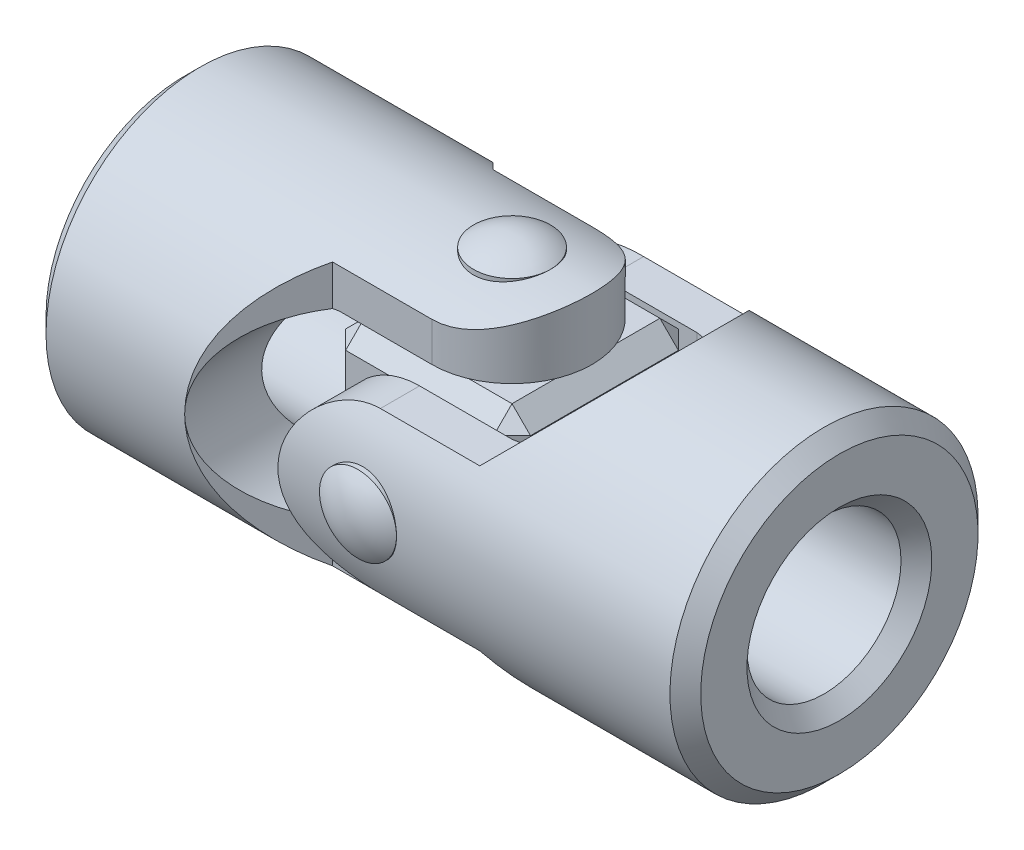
ISO-10303-21;
HEADER;
FILE_DESCRIPTION(('STEP AP214'),'2;1');
FILE_NAME('part.step','',(''),(''),'','','');
FILE_SCHEMA(('AUTOMOTIVE_DESIGN { 1 0 10303 214 1 1 1 1 }'));
ENDSEC;
DATA;
#1=APPLICATION_CONTEXT('core data for automotive mechanical design processes');
#2=APPLICATION_PROTOCOL_DEFINITION('international standard','automotive_design',2000,#1);
#3=PRODUCT_CONTEXT('',#1,'mechanical');
#4=PRODUCT('Part','Part','',(#3));
#5=PRODUCT_RELATED_PRODUCT_CATEGORY('part','',(#4));
#6=PRODUCT_DEFINITION_FORMATION('','',#4);
#7=PRODUCT_DEFINITION_CONTEXT('part definition',#1,'design');
#8=PRODUCT_DEFINITION('design','',#6,#7);
#9=PRODUCT_DEFINITION_SHAPE('','',#8);
#10=(LENGTH_UNIT() NAMED_UNIT(*) SI_UNIT(.MILLI.,.METRE.));
#11=(NAMED_UNIT(*) PLANE_ANGLE_UNIT() SI_UNIT($,.RADIAN.));
#12=(NAMED_UNIT(*) SI_UNIT($,.STERADIAN.) SOLID_ANGLE_UNIT());
#13=UNCERTAINTY_MEASURE_WITH_UNIT(LENGTH_MEASURE(1.E-05),#10,'distance_accuracy_value','');
#14=(GEOMETRIC_REPRESENTATION_CONTEXT(3) GLOBAL_UNCERTAINTY_ASSIGNED_CONTEXT((#13)) GLOBAL_UNIT_ASSIGNED_CONTEXT((#10,
#11,#12)) REPRESENTATION_CONTEXT('',''));
#15=CARTESIAN_POINT('',(0.,0.,0.));
#16=DIRECTION('',(0.,0.,1.));
#17=DIRECTION('',(1.,0.,0.));
#18=AXIS2_PLACEMENT_3D('',#15,#16,#17);
#19=CARTESIAN_POINT('',(0.,16.,0.));
#20=DIRECTION('',(0.,-1.,0.));
#21=DIRECTION('',(-1.,0.,0.));
#22=AXIS2_PLACEMENT_3D('',#19,#20,#21);
#23=CYLINDRICAL_SURFACE('',#22,4.);
#24=CARTESIAN_POINT('',(0.,16.,0.));
#25=DIRECTION('',(0.,1.,0.));
#26=DIRECTION('',(1.,0.,0.));
#27=AXIS2_PLACEMENT_3D('',#24,#25,#26);
#28=CIRCLE('',#27,4.);
#29=CARTESIAN_POINT('',(4.,16.,0.));
#30=VERTEX_POINT('',#29);
#31=EDGE_CURVE('P0_E10',#30,#30,#28,.T.);
#32=ORIENTED_EDGE('',*,*,#31,.F.);
#33=EDGE_LOOP('',(#32));
#34=FACE_BOUND('',#33,.T.);
#35=CARTESIAN_POINT('',(0.,-16.,0.));
#36=DIRECTION('',(0.,-1.,0.));
#37=DIRECTION('',(0.,0.,-1.));
#38=AXIS2_PLACEMENT_3D('',#35,#36,#37);
#39=CIRCLE('',#38,4.);
#40=CARTESIAN_POINT('',(0.,-16.,-4.));
#41=VERTEX_POINT('',#40);
#42=EDGE_CURVE('P0_E20',#41,#41,#39,.T.);
#43=ORIENTED_EDGE('',*,*,#42,.F.);
#44=EDGE_LOOP('',(#43));
#45=FACE_BOUND('',#44,.T.);
#46=ADVANCED_FACE('P0_F14',(#34,#45),#23,.T.);
#47=CARTESIAN_POINT('',(0.,10.39,0.));
#48=DIRECTION('',(0.,-1.,0.));
#49=DIRECTION('',(0.,0.,-1.));
#50=AXIS2_PLACEMENT_3D('',#47,#48,#49);
#51=SPHERICAL_SURFACE('',#50,6.89);
#52=ORIENTED_EDGE('',*,*,#31,.T.);
#53=EDGE_LOOP('',(#52));
#54=FACE_BOUND('',#53,.T.);
#55=ADVANCED_FACE('P0_F29',(#54),#51,.T.);
#56=CARTESIAN_POINT('',(0.,-10.39,0.));
#57=DIRECTION('',(0.,1.,0.));
#58=DIRECTION('',(0.,0.,-1.));
#59=AXIS2_PLACEMENT_3D('',#56,#57,#58);
#60=SPHERICAL_SURFACE('',#59,6.89);
#61=ORIENTED_EDGE('',*,*,#42,.T.);
#62=EDGE_LOOP('',(#61));
#63=FACE_BOUND('',#62,.T.);
#64=ADVANCED_FACE('P0_F26',(#63),#60,.T.);
#65=CLOSED_SHELL('',(#46,#55,#64));
#66=MANIFOLD_SOLID_BREP('P0_B1',#65);
#67=CARTESIAN_POINT('',(0.,0.,16.));
#68=DIRECTION('',(0.,0.,-1.));
#69=DIRECTION('',(-1.,0.,0.));
#70=AXIS2_PLACEMENT_3D('',#67,#68,#69);
#71=CYLINDRICAL_SURFACE('',#70,4.);
#72=CARTESIAN_POINT('',(0.,0.,16.));
#73=DIRECTION('',(0.,0.,1.));
#74=DIRECTION('',(1.,0.,0.));
#75=AXIS2_PLACEMENT_3D('',#72,#73,#74);
#76=CIRCLE('',#75,4.);
#77=CARTESIAN_POINT('',(4.,0.,16.));
#78=VERTEX_POINT('',#77);
#79=EDGE_CURVE('P1_E10',#78,#78,#76,.T.);
#80=ORIENTED_EDGE('',*,*,#79,.F.);
#81=EDGE_LOOP('',(#80));
#82=FACE_BOUND('',#81,.T.);
#83=CARTESIAN_POINT('',(0.,0.,-16.));
#84=DIRECTION('',(0.,0.,-1.));
#85=DIRECTION('',(0.,1.,0.));
#86=AXIS2_PLACEMENT_3D('',#83,#84,#85);
#87=CIRCLE('',#86,4.);
#88=CARTESIAN_POINT('',(0.,4.,-16.));
#89=VERTEX_POINT('',#88);
#90=EDGE_CURVE('P1_E20',#89,#89,#87,.T.);
#91=ORIENTED_EDGE('',*,*,#90,.F.);
#92=EDGE_LOOP('',(#91));
#93=FACE_BOUND('',#92,.T.);
#94=ADVANCED_FACE('P1_F14',(#82,#93),#71,.T.);
#95=CARTESIAN_POINT('',(0.,0.,10.39));
#96=DIRECTION('',(0.,0.,-1.));
#97=DIRECTION('',(0.,1.,0.));
#98=AXIS2_PLACEMENT_3D('',#95,#96,#97);
#99=SPHERICAL_SURFACE('',#98,6.89);
#100=ORIENTED_EDGE('',*,*,#79,.T.);
#101=EDGE_LOOP('',(#100));
#102=FACE_BOUND('',#101,.T.);
#103=ADVANCED_FACE('P1_F29',(#102),#99,.T.);
#104=CARTESIAN_POINT('',(0.,0.,-10.39));
#105=DIRECTION('',(0.,0.,1.));
#106=DIRECTION('',(0.,1.,0.));
#107=AXIS2_PLACEMENT_3D('',#104,#105,#106);
#108=SPHERICAL_SURFACE('',#107,6.89);
#109=ORIENTED_EDGE('',*,*,#90,.T.);
#110=EDGE_LOOP('',(#109));
#111=FACE_BOUND('',#110,.T.);
#112=ADVANCED_FACE('P1_F26',(#111),#108,.T.);
#113=CLOSED_SHELL('',(#94,#103,#112));
#114=MANIFOLD_SOLID_BREP('P1_B1',#113);
#115=CARTESIAN_POINT('',(0.,-16.,-8.32));
#116=DIRECTION('',(0.,0.,1.));
#117=DIRECTION('',(1.,0.,0.));
#118=AXIS2_PLACEMENT_3D('',#115,#116,#117);
#119=PLANE('',#118);
#120=DIRECTION('',(0.,1.,0.));
#121=VECTOR('',#120,1.);
#122=CARTESIAN_POINT('',(0.,-16.,-8.32));
#123=LINE('',#122,#121);
#124=CARTESIAN_POINT('',(0.,9.6,-8.32));
#125=VERTEX_POINT('',#124);
#126=CARTESIAN_POINT('',(0.,13.6666601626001,-8.32));
#127=VERTEX_POINT('',#126);
#128=EDGE_CURVE('P2_E282',#125,#127,#123,.T.);
#129=ORIENTED_EDGE('',*,*,#128,.F.);
#130=DIRECTION('',(-1.,0.,0.));
#131=VECTOR('',#130,1.);
#132=CARTESIAN_POINT('',(0.,9.6,-8.32));
#133=LINE('',#132,#131);
#134=CARTESIAN_POINT('',(-9.6,9.6,-8.32));
#135=VERTEX_POINT('',#134);
#136=EDGE_CURVE('P2_E132',#125,#135,#133,.T.);
#137=ORIENTED_EDGE('',*,*,#136,.T.);
#138=CARTESIAN_POINT('',(-8.31428571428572,0.,-8.32));
#139=DIRECTION('',(0.,0.,1.));
#140=DIRECTION('',(1.,0.,0.));
#141=AXIS2_PLACEMENT_3D('',#138,#139,#140);
#142=CIRCLE('',#141,9.68571428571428);
#143=CARTESIAN_POINT('',(-10.32,9.4757675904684,-8.32));
#144=VERTEX_POINT('',#143);
#145=EDGE_CURVE('P2_E146',#135,#144,#142,.T.);
#146=ORIENTED_EDGE('',*,*,#145,.T.);
#147=DIRECTION('',(0.,1.,0.));
#148=VECTOR('',#147,1.);
#149=CARTESIAN_POINT('',(-10.32,-16.,-8.32));
#150=LINE('',#149,#148);
#151=CARTESIAN_POINT('',(-10.32,13.6666601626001,-8.32));
#152=VERTEX_POINT('',#151);
#153=EDGE_CURVE('P2_E289',#144,#152,#150,.T.);
#154=ORIENTED_EDGE('',*,*,#153,.T.);
#155=DIRECTION('',(1.,0.,0.));
#156=VECTOR('',#155,1.);
#157=CARTESIAN_POINT('',(-34.,13.6666601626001,-8.31999999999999));
#158=LINE('',#157,#156);
#159=EDGE_CURVE('P2_E227',#127,#152,#158,.F.);
#160=ORIENTED_EDGE('',*,*,#159,.F.);
#161=EDGE_LOOP('',(#129,#137,#146,#154,#160));
#162=FACE_BOUND('',#161,.T.);
#163=ADVANCED_FACE('P2_F16',(#162),#119,.F.);
#164=CARTESIAN_POINT('',(-10.32,-16.,-8.32));
#165=DIRECTION('',(-0.707106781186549,0.,0.707106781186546));
#166=DIRECTION('',(0.707106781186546,0.,0.707106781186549));
#167=AXIS2_PLACEMENT_3D('',#164,#165,#166);
#168=PLANE('',#167);
#169=CARTESIAN_POINT('',(-2.00000000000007,0.,0.));
#170=DIRECTION('',(-0.707106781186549,0.,0.707106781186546));
#171=DIRECTION('',(0.707106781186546,0.,0.707106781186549));
#172=AXIS2_PLACEMENT_3D('',#169,#170,#171);
#173=ELLIPSE('',#172,22.6274169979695,16.);
#174=CARTESIAN_POINT('',(-18.,0.,-16.));
#175=VERTEX_POINT('',#174);
#176=CARTESIAN_POINT('',(-10.32,-13.6666601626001,-8.32));
#177=VERTEX_POINT('',#176);
#178=EDGE_CURVE('P2_E230',#175,#177,#173,.T.);
#179=ORIENTED_EDGE('',*,*,#178,.F.);
#180=CARTESIAN_POINT('',(-8.31428571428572,0.,-6.31428571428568));
#181=DIRECTION('',(-0.707106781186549,0.,0.707106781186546));
#182=DIRECTION('',(-0.707106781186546,0.,-0.707106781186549));
#183=AXIS2_PLACEMENT_3D('',#180,#181,#182);
#184=ELLIPSE('',#183,13.697668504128,9.68571428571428);
#185=CARTESIAN_POINT('',(-10.32,-9.4757675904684,-8.32));
#186=VERTEX_POINT('',#185);
#187=EDGE_CURVE('P2_E143',#175,#186,#184,.T.);
#188=ORIENTED_EDGE('',*,*,#187,.T.);
#189=EDGE_CURVE('P2_E286',#177,#186,#150,.T.);
#190=ORIENTED_EDGE('',*,*,#189,.F.);
#191=EDGE_LOOP('',(#179,#188,#190));
#192=FACE_BOUND('',#191,.T.);
#193=ADVANCED_FACE('P2_F181',(#192),#168,.F.);
#194=CARTESIAN_POINT('',(-10.32,-16.,8.32));
#195=DIRECTION('',(-0.707106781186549,0.,-0.707106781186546));
#196=DIRECTION('',(-0.707106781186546,0.,0.707106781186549));
#197=AXIS2_PLACEMENT_3D('',#194,#195,#196);
#198=PLANE('',#197);
#199=DIRECTION('',(0.,1.,0.));
#200=VECTOR('',#199,1.);
#201=CARTESIAN_POINT('',(-10.32,-16.,8.32));
#202=LINE('',#201,#200);
#203=CARTESIAN_POINT('',(-10.32,-13.6666601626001,8.32));
#204=VERTEX_POINT('',#203);
#205=CARTESIAN_POINT('',(-10.32,-9.4757675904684,8.32));
#206=VERTEX_POINT('',#205);
#207=EDGE_CURVE('P2_E39',#204,#206,#202,.T.);
#208=ORIENTED_EDGE('',*,*,#207,.T.);
#209=CARTESIAN_POINT('',(-8.31428571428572,0.,6.31428571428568));
#210=DIRECTION('',(-0.707106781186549,0.,-0.707106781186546));
#211=DIRECTION('',(0.707106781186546,0.,-0.707106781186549));
#212=AXIS2_PLACEMENT_3D('',#209,#210,#211);
#213=ELLIPSE('',#212,13.697668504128,9.68571428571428);
#214=CARTESIAN_POINT('',(-18.,0.,16.));
#215=VERTEX_POINT('',#214);
#216=EDGE_CURVE('P2_E107',#206,#215,#213,.T.);
#217=ORIENTED_EDGE('',*,*,#216,.T.);
#218=CARTESIAN_POINT('',(-2.00000000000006,0.,0.));
#219=DIRECTION('',(-0.707106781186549,0.,-0.707106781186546));
#220=DIRECTION('',(0.707106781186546,0.,-0.707106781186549));
#221=AXIS2_PLACEMENT_3D('',#218,#219,#220);
#222=ELLIPSE('',#221,22.6274169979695,16.);
#223=EDGE_CURVE('P2_E241',#204,#215,#222,.T.);
#224=ORIENTED_EDGE('',*,*,#223,.F.);
#225=EDGE_LOOP('',(#208,#217,#224));
#226=FACE_BOUND('',#225,.T.);
#227=ADVANCED_FACE('P2_F185',(#226),#198,.F.);
#228=CARTESIAN_POINT('',(0.,-16.,8.32));
#229=DIRECTION('',(0.,0.,-1.));
#230=DIRECTION('',(-1.,0.,0.));
#231=AXIS2_PLACEMENT_3D('',#228,#229,#230);
#232=PLANE('',#231);
#233=CARTESIAN_POINT('',(-8.31428571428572,0.,8.32));
#234=DIRECTION('',(0.,0.,-1.));
#235=DIRECTION('',(-1.,0.,0.));
#236=AXIS2_PLACEMENT_3D('',#233,#234,#235);
#237=CIRCLE('',#236,9.68571428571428);
#238=CARTESIAN_POINT('',(-10.32,9.4757675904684,8.32));
#239=VERTEX_POINT('',#238);
#240=CARTESIAN_POINT('',(-9.6,9.6,8.32));
#241=VERTEX_POINT('',#240);
#242=EDGE_CURVE('P2_E108',#239,#241,#237,.T.);
#243=ORIENTED_EDGE('',*,*,#242,.T.);
#244=DIRECTION('',(1.,0.,0.));
#245=VECTOR('',#244,1.);
#246=CARTESIAN_POINT('',(0.,9.6,8.32));
#247=LINE('',#246,#245);
#248=CARTESIAN_POINT('',(0.,9.6,8.32));
#249=VERTEX_POINT('',#248);
#250=EDGE_CURVE('P2_E129',#241,#249,#247,.T.);
#251=ORIENTED_EDGE('',*,*,#250,.T.);
#252=DIRECTION('',(0.,1.,0.));
#253=VECTOR('',#252,1.);
#254=CARTESIAN_POINT('',(0.,-16.,8.32));
#255=LINE('',#254,#253);
#256=CARTESIAN_POINT('',(0.,13.6666601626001,8.32));
#257=VERTEX_POINT('',#256);
#258=EDGE_CURVE('P2_E154',#249,#257,#255,.T.);
#259=ORIENTED_EDGE('',*,*,#258,.T.);
#260=DIRECTION('',(1.,0.,0.));
#261=VECTOR('',#260,1.);
#262=CARTESIAN_POINT('',(-34.,13.6666601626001,8.32));
#263=LINE('',#262,#261);
#264=CARTESIAN_POINT('',(-10.32,13.6666601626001,8.32));
#265=VERTEX_POINT('',#264);
#266=EDGE_CURVE('P2_E244',#265,#257,#263,.T.);
#267=ORIENTED_EDGE('',*,*,#266,.F.);
#268=EDGE_CURVE('P2_E292',#239,#265,#202,.T.);
#269=ORIENTED_EDGE('',*,*,#268,.F.);
#270=EDGE_LOOP('',(#243,#251,#259,#267,#269));
#271=FACE_BOUND('',#270,.T.);
#272=ADVANCED_FACE('P2_F188',(#271),#232,.F.);
#273=CARTESIAN_POINT('',(0.,-16.,0.));
#274=DIRECTION('',(0.,1.,0.));
#275=DIRECTION('',(0.,0.,-1.));
#276=AXIS2_PLACEMENT_3D('',#273,#274,#275);
#277=CYLINDRICAL_SURFACE('',#276,8.32);
#278=ORIENTED_EDGE('',*,*,#258,.F.);
#279=CARTESIAN_POINT('',(0.,9.6,0.));
#280=DIRECTION('',(0.,1.,0.));
#281=DIRECTION('',(1.,0.,0.));
#282=AXIS2_PLACEMENT_3D('',#279,#280,#281);
#283=CIRCLE('',#282,8.32);
#284=EDGE_CURVE('P2_E109',#249,#125,#283,.T.);
#285=ORIENTED_EDGE('',*,*,#284,.T.);
#286=ORIENTED_EDGE('',*,*,#128,.T.);
#287=CARTESIAN_POINT('',(0.,13.6666601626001,8.32));
#288=CARTESIAN_POINT('',(0.216520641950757,13.6665905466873,8.32004237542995));
#289=CARTESIAN_POINT('',(0.43300781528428,13.671803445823,8.31154992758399));
#290=CARTESIAN_POINT('',(0.864054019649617,13.6922746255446,8.27782109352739));
#291=CARTESIAN_POINT('',(1.0786142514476,13.7075261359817,8.25259599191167));
#292=CARTESIAN_POINT('',(1.50293411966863,13.7474332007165,8.18593219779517));
#293=CARTESIAN_POINT('',(1.71271515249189,13.7720303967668,8.14459408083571));
#294=CARTESIAN_POINT('',(2.12738596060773,13.8297227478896,8.04624355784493));
#295=CARTESIAN_POINT('',(2.33227510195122,13.8628189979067,7.9892291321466));
#296=CARTESIAN_POINT('',(2.73535185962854,13.9363040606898,7.86033733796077));
#297=CARTESIAN_POINT('',(2.93355583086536,13.9766732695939,7.78849985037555));
#298=CARTESIAN_POINT('',(3.32284117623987,14.0635282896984,7.63054994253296));
#299=CARTESIAN_POINT('',(3.5139197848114,14.1100164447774,7.54443204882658));
#300=CARTESIAN_POINT('',(4.07554670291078,14.256826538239,7.26547358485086));
#301=CARTESIAN_POINT('',(4.43420018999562,14.364438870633,7.05212069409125));
#302=CARTESIAN_POINT('',(5.14410936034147,14.5985296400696,6.55475095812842));
#303=CARTESIAN_POINT('',(5.49187244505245,14.7258347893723,6.26613806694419));
#304=CARTESIAN_POINT('',(5.97526388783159,14.9150746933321,5.79391638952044));
#305=CARTESIAN_POINT('',(6.1300861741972,14.9778991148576,5.62986757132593));
#306=CARTESIAN_POINT('',(6.42629711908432,15.1015483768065,5.28923672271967));
#307=CARTESIAN_POINT('',(6.56768376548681,15.1623729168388,5.11265282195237));
#308=CARTESIAN_POINT('',(6.84615031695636,15.2849793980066,4.73412044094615));
#309=CARTESIAN_POINT('',(6.98211492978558,15.3464919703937,4.53126277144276));
#310=CARTESIAN_POINT('',(7.23626358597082,15.463777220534,4.1132333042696));
#311=CARTESIAN_POINT('',(7.35445525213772,15.5195523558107,3.89806684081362));
#312=CARTESIAN_POINT('',(7.57191553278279,15.6237767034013,3.45673126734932));
#313=CARTESIAN_POINT('',(7.67118914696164,15.6722278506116,3.23056508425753));
#314=CARTESIAN_POINT('',(7.84967404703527,15.76036024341,2.76880202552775));
#315=CARTESIAN_POINT('',(7.92888767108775,15.8000425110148,2.53320625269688));
#316=CARTESIAN_POINT('',(8.06097662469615,15.8667561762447,2.07268086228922));
#317=CARTESIAN_POINT('',(8.11539496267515,15.8945192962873,1.84829937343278));
#318=CARTESIAN_POINT('',(8.20549813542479,15.9407119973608,1.39485472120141));
#319=CARTESIAN_POINT('',(8.24118383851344,15.9591420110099,1.16579177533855));
#320=CARTESIAN_POINT('',(8.29331389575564,15.9861239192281,0.705032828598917));
#321=CARTESIAN_POINT('',(8.30976867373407,15.9946811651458,0.473338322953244));
#322=CARTESIAN_POINT('',(8.32323224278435,16.001679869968,0.00923862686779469));
#323=CARTESIAN_POINT('',(8.32024235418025,16.0001220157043,-0.223166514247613));
#324=CARTESIAN_POINT('',(8.2960622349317,15.987562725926,-0.664805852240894));
#325=CARTESIAN_POINT('',(8.27661007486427,15.9774631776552,-0.874163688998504));
#326=CARTESIAN_POINT('',(8.22201966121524,15.9492526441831,-1.29028008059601));
#327=CARTESIAN_POINT('',(8.1868812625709,15.9311415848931,-1.49703861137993));
#328=CARTESIAN_POINT('',(8.10131375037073,15.8873388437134,-1.90653351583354));
#329=CARTESIAN_POINT('',(8.05088506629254,15.8616473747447,-2.1092700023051));
#330=CARTESIAN_POINT('',(7.93526519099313,15.8032764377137,-2.50945275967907));
#331=CARTESIAN_POINT('',(7.87007345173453,15.7705967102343,-2.70689883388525));
#332=CARTESIAN_POINT('',(7.72463416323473,15.6985199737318,-3.09781485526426));
#333=CARTESIAN_POINT('',(7.64420754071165,15.6590436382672,-3.2912035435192));
#334=CARTESIAN_POINT('',(7.46954682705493,15.5745275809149,-3.67040754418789));
#335=CARTESIAN_POINT('',(7.37530816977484,15.529486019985,-3.85622032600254));
#336=CARTESIAN_POINT('',(7.07297367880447,15.3874215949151,-4.40087924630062));
#337=CARTESIAN_POINT('',(6.84517340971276,15.2834151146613,-4.74717470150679));
#338=CARTESIAN_POINT('',(6.31757312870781,15.05414886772,-5.43287516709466));
#339=CARTESIAN_POINT('',(6.01285301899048,14.9278038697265,-5.76813357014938));
#340=CARTESIAN_POINT('',(5.51842357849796,14.7379599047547,-6.23060991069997));
#341=CARTESIAN_POINT('',(5.34722596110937,14.6745696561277,-6.37814263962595));
#342=CARTESIAN_POINT('',(4.99299591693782,14.5492320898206,-6.65908910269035));
#343=CARTESIAN_POINT('',(4.80996157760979,14.487285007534,-6.79250054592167));
#344=CARTESIAN_POINT('',(4.41897636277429,14.3620394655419,-7.0536753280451));
#345=CARTESIAN_POINT('',(4.21018360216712,14.2989789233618,-7.18029438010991));
#346=CARTESIAN_POINT('',(3.78108008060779,14.1785682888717,-7.4152290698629));
#347=CARTESIAN_POINT('',(3.5607746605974,14.1212155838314,-7.52355309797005));
#348=CARTESIAN_POINT('',(3.11028295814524,14.0144096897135,-7.72067828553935));
#349=CARTESIAN_POINT('',(2.88011715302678,13.9649410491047,-7.8095177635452));
#350=CARTESIAN_POINT('',(2.41112239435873,13.87581353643,-7.96680576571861));
#351=CARTESIAN_POINT('',(2.17229719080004,13.8361504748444,-8.03526300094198));
#352=CARTESIAN_POINT('',(1.77337347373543,13.780359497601,-8.13040910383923));
#353=CARTESIAN_POINT('',(1.61519785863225,13.7608637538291,-8.16331518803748));
#354=CARTESIAN_POINT('',(1.29668308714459,13.7271236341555,-8.21992470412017));
#355=CARTESIAN_POINT('',(1.13634454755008,13.7128777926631,-8.24363070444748));
#356=CARTESIAN_POINT('',(0.813763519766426,13.6899199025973,-8.281703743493));
#357=CARTESIAN_POINT('',(0.651517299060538,13.681221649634,-8.29604750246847));
#358=CARTESIAN_POINT('',(0.326184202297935,13.6695790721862,-8.31520470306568));
#359=CARTESIAN_POINT('',(0.163096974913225,13.6666373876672,-8.32001377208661));
#360=CARTESIAN_POINT('',(0.,13.6666601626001,-8.32));
#361=B_SPLINE_CURVE_WITH_KNOTS('',3,(#287,#288,#289,#290,#291,#292,#293,#294,#295,#296,#297,
#298,#299,#300,#301,#302,#303,#304,#305,#306,#307,#308,#309,#310,#311,#312,#313,#314,#315,#316,
#317,#318,#319,#320,#321,#322,#323,#324,#325,#326,#327,#328,#329,#330,#331,#332,#333,#334,#335,
#336,#337,#338,#339,#340,#341,#342,#343,#344,#345,#346,#347,#348,#349,#350,#351,#352,#353,#354,
#355,#356,#357,#358,#359,#360),.UNSPECIFIED.,.F.,.F.,(4,2,2,2,2,2,2,2,2,2,2,2,2,2,2,2,2,2,2,2,2,
2,2,2,2,2,2,2,2,2,2,2,2,2,2,2,4),(0.,0.649279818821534,1.29812220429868,1.94297782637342,
2.58791656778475,3.23114223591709,3.87461501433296,5.16246706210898,6.56481675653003,
7.26668872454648,7.96866563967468,8.72320786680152,9.47742554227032,10.2314436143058,
10.9853737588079,11.6820665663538,12.3787270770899,13.0750097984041,13.7712452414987,
14.4020041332,15.0327688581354,15.6635158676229,16.2942862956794,16.9329912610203,
17.5719078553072,18.8490043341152,20.253720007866,20.9572858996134,21.660965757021,
22.4166004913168,23.1718877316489,23.9256760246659,24.6791416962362,25.167023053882,
25.6547681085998,26.1437213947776,26.6328988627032),.UNSPECIFIED.);
#362=EDGE_CURVE('P2_E203',#257,#127,#361,.T.);
#363=ORIENTED_EDGE('',*,*,#362,.F.);
#364=EDGE_LOOP('',(#278,#285,#286,#363));
#365=FACE_BOUND('',#364,.T.);
#366=ADVANCED_FACE('P2_F192',(#365),#277,.T.);
#367=CARTESIAN_POINT('',(-34.,0.,0.));
#368=DIRECTION('',(-1.,0.,0.));
#369=DIRECTION('',(0.,0.,1.));
#370=AXIS2_PLACEMENT_3D('',#367,#368,#369);
#371=PLANE('',#370);
#372=CARTESIAN_POINT('',(-34.,0.,0.));
#373=DIRECTION('',(-1.,0.,0.));
#374=DIRECTION('',(0.,0.,1.));
#375=AXIS2_PLACEMENT_3D('',#372,#373,#374);
#376=CIRCLE('',#375,9.59999999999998);
#377=CARTESIAN_POINT('',(-34.,0.,9.59999999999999));
#378=VERTEX_POINT('',#377);
#379=EDGE_CURVE('P2_E24',#378,#378,#376,.F.);
#380=ORIENTED_EDGE('',*,*,#379,.T.);
#381=EDGE_LOOP('',(#380));
#382=FACE_BOUND('',#381,.T.);
#383=CARTESIAN_POINT('',(-34.,0.,0.));
#384=DIRECTION('',(-1.,0.,0.));
#385=DIRECTION('',(0.,0.,1.));
#386=AXIS2_PLACEMENT_3D('',#383,#384,#385);
#387=CIRCLE('',#386,14.4);
#388=CARTESIAN_POINT('',(-34.,0.,14.4));
#389=VERTEX_POINT('',#388);
#390=EDGE_CURVE('P2_E254',#389,#389,#387,.T.);
#391=ORIENTED_EDGE('',*,*,#390,.T.);
#392=EDGE_LOOP('',(#391));
#393=FACE_BOUND('',#392,.T.);
#394=ADVANCED_FACE('P2_F213',(#382,#393),#371,.T.);
#395=CARTESIAN_POINT('',(-34.,0.,0.));
#396=DIRECTION('',(1.,0.,0.));
#397=DIRECTION('',(0.,0.,-1.));
#398=AXIS2_PLACEMENT_3D('',#395,#396,#397);
#399=CYLINDRICAL_SURFACE('',#398,16.);
#400=CARTESIAN_POINT('',(-32.4,0.,0.));
#401=DIRECTION('',(-1.,0.,0.));
#402=DIRECTION('',(0.,0.,1.));
#403=AXIS2_PLACEMENT_3D('',#400,#401,#402);
#404=CIRCLE('',#403,16.);
#405=CARTESIAN_POINT('',(-32.4,0.,16.));
#406=VERTEX_POINT('',#405);
#407=EDGE_CURVE('P2_E11',#406,#406,#404,.F.);
#408=ORIENTED_EDGE('',*,*,#407,.T.);
#409=EDGE_LOOP('',(#408));
#410=FACE_BOUND('',#409,.T.);
#411=CARTESIAN_POINT('',(4.,-16.,0.));
#412=CARTESIAN_POINT('',(3.99999379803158,-15.999996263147,-0.221002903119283));
#413=CARTESIAN_POINT('',(3.9816225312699,-15.9953754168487,-0.442075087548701));
#414=CARTESIAN_POINT('',(3.90873292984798,-15.9773897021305,-0.877883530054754));
#415=CARTESIAN_POINT('',(3.85419410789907,-15.964019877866,-1.09261612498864));
#416=CARTESIAN_POINT('',(3.71082865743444,-15.9300167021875,-1.50938899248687));
#417=CARTESIAN_POINT('',(3.62204320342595,-15.9093920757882,-1.71144416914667));
#418=CARTESIAN_POINT('',(3.41284962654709,-15.8630758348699,-2.09779235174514));
#419=CARTESIAN_POINT('',(3.29244043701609,-15.8373840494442,-2.28208475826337));
#420=CARTESIAN_POINT('',(3.02079789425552,-15.7831310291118,-2.63147180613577));
#421=CARTESIAN_POINT('',(2.86903580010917,-15.75452552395,-2.79614850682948));
#422=CARTESIAN_POINT('',(2.54012745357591,-15.697963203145,-3.09799713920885));
#423=CARTESIAN_POINT('',(2.36297833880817,-15.6700064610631,-3.23516596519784));
#424=CARTESIAN_POINT('',(1.98507939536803,-15.6174606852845,-3.48007078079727));
#425=CARTESIAN_POINT('',(1.78401805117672,-15.592927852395,-3.58733924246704));
#426=CARTESIAN_POINT('',(1.36600423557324,-15.5506531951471,-3.76639175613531));
#427=CARTESIAN_POINT('',(1.14905431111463,-15.5329102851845,-3.83818148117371));
#428=CARTESIAN_POINT('',(0.710017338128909,-15.5066793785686,-3.94281289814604));
#429=CARTESIAN_POINT('',(0.488120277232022,-15.4980130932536,-3.97640604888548));
#430=CARTESIAN_POINT('',(0.0416838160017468,-15.4903829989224,-4.00603140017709));
#431=CARTESIAN_POINT('',(-0.182855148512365,-15.4914176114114,-4.00206971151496));
#432=CARTESIAN_POINT('',(-0.622442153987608,-15.5029121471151,-3.95729739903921));
#433=CARTESIAN_POINT('',(-0.837588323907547,-15.5131430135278,-3.91738224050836));
#434=CARTESIAN_POINT('',(-1.25802946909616,-15.5415122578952,-3.80326449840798));
#435=CARTESIAN_POINT('',(-1.46332374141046,-15.5596511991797,-3.72905947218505));
#436=CARTESIAN_POINT('',(-1.86063471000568,-15.6020030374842,-3.54770527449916));
#437=CARTESIAN_POINT('',(-2.05249645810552,-15.6262753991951,-3.44023111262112));
#438=CARTESIAN_POINT('',(-2.41578322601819,-15.6781256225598,-3.19561673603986));
#439=CARTESIAN_POINT('',(-2.58720466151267,-15.7057040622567,-3.0584713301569));
#440=CARTESIAN_POINT('',(-2.90987630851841,-15.7620234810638,-2.75376913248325));
#441=CARTESIAN_POINT('',(-3.06041197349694,-15.79077518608,-2.58545668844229));
#442=CARTESIAN_POINT('',(-3.33125664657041,-15.8454924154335,-2.22563178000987));
#443=CARTESIAN_POINT('',(-3.45156473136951,-15.8714578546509,-2.03411860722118));
#444=CARTESIAN_POINT('',(-3.65880156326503,-15.9178061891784,-1.63230903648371));
#445=CARTESIAN_POINT('',(-3.74561424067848,-15.9381696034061,-1.42195038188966));
#446=CARTESIAN_POINT('',(-3.88244614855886,-15.9708777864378,-0.98900268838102));
#447=CARTESIAN_POINT('',(-3.93247241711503,-15.9832240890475,-0.766415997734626));
#448=CARTESIAN_POINT('',(-3.99322017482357,-15.99827998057,-0.321439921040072));
#449=CARTESIAN_POINT('',(-4.00491473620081,-16.0012280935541,-0.0991912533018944));
#450=CARTESIAN_POINT('',(-3.9913359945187,-15.9978347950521,0.344087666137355));
#451=CARTESIAN_POINT('',(-3.9660660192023,-15.9914942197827,0.565118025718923));
#452=CARTESIAN_POINT('',(-3.880077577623,-15.9703888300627,0.996304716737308));
#453=CARTESIAN_POINT('',(-3.8198899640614,-15.9557502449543,1.20657365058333));
#454=CARTESIAN_POINT('',(-3.66638110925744,-15.9196988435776,1.61401944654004));
#455=CARTESIAN_POINT('',(-3.57305652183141,-15.8982853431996,1.81119498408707));
#456=CARTESIAN_POINT('',(-3.35403698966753,-15.8504882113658,2.19072835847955));
#457=CARTESIAN_POINT('',(-3.22779703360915,-15.8240231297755,2.37276117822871));
#458=CARTESIAN_POINT('',(-2.94722690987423,-15.7691869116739,2.71340430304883));
#459=CARTESIAN_POINT('',(-2.79289189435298,-15.7408154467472,2.87201055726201));
#460=CARTESIAN_POINT('',(-2.45599477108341,-15.684505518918,3.16530818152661));
#461=CARTESIAN_POINT('',(-2.27283279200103,-15.656594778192,3.29931698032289));
#462=CARTESIAN_POINT('',(-1.88604630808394,-15.6051434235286,3.53469535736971));
#463=CARTESIAN_POINT('',(-1.68242271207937,-15.5816026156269,3.63606638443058));
#464=CARTESIAN_POINT('',(-1.26158474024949,-15.541815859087,3.80253712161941));
#465=CARTESIAN_POINT('',(-1.04445965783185,-15.52552680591,3.86785172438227));
#466=CARTESIAN_POINT('',(-0.601840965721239,-15.5020465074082,3.96092175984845));
#467=CARTESIAN_POINT('',(-0.376349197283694,-15.4948532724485,3.98868540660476));
#468=CARTESIAN_POINT('',(0.0696560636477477,-15.4905306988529,4.00543624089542));
#469=CARTESIAN_POINT('',(0.290126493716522,-15.493118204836,3.99551439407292));
#470=CARTESIAN_POINT('',(0.726143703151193,-15.5074109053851,3.93967274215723));
#471=CARTESIAN_POINT('',(0.941690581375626,-15.5191159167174,3.89375366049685));
#472=CARTESIAN_POINT('',(1.36055589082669,-15.550166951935,3.76781685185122));
#473=CARTESIAN_POINT('',(1.56393948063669,-15.5694670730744,3.68800374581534));
#474=CARTESIAN_POINT('',(1.95457435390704,-15.6135401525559,3.49670643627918));
#475=CARTESIAN_POINT('',(2.14182339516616,-15.6383138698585,3.38521784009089));
#476=CARTESIAN_POINT('',(2.50014567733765,-15.6913502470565,3.13031399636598));
#477=CARTESIAN_POINT('',(2.67066952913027,-15.7196870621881,2.98614176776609));
#478=CARTESIAN_POINT('',(2.98545878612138,-15.776214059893,2.67143832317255));
#479=CARTESIAN_POINT('',(3.129717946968,-15.8044042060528,2.50090085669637));
#480=CARTESIAN_POINT('',(3.39043015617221,-15.8580708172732,2.13458023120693));
#481=CARTESIAN_POINT('',(3.50633230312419,-15.8834888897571,1.9383957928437));
#482=CARTESIAN_POINT('',(3.70332656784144,-15.9281313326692,1.52870949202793));
#483=CARTESIAN_POINT('',(3.7844436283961,-15.9473601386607,1.31522016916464));
#484=CARTESIAN_POINT('',(3.89752488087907,-15.9746149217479,0.918427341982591));
#485=CARTESIAN_POINT('',(3.93586998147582,-15.9840689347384,0.737013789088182));
#486=CARTESIAN_POINT('',(3.98710918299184,-15.9967628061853,0.370416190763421));
#487=CARTESIAN_POINT('',(4.00000519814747,-16.0000031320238,0.18523242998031));
#488=CARTESIAN_POINT('',(4.,-16.,0.));
#489=B_SPLINE_CURVE_WITH_KNOTS('',3,(#411,#412,#413,#414,#415,#416,#417,#418,#419,#420,#421,
#422,#423,#424,#425,#426,#427,#428,#429,#430,#431,#432,#433,#434,#435,#436,#437,#438,#439,#440,
#441,#442,#443,#444,#445,#446,#447,#448,#449,#450,#451,#452,#453,#454,#455,#456,#457,#458,#459,
#460,#461,#462,#463,#464,#465,#466,#467,#468,#469,#470,#471,#472,#473,#474,#475,#476,#477,#478,
#479,#480,#481,#482,#483,#484,#485,#486,#487,#488),.UNSPECIFIED.,.T.,.F.,(4,2,2,2,2,2,2,2,2,2,2,
2,2,2,2,2,2,2,2,2,2,2,2,2,2,2,2,2,2,2,2,2,2,2,2,2,2,2,4),(0.,0.662329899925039,1.32503530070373,
1.98694640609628,2.64887984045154,3.32305161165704,3.99729945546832,4.68156393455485,
5.36571896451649,6.03616786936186,6.7065076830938,7.3605999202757,8.01473875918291,
8.675480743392,9.33633842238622,10.0160400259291,10.6957623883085,11.3778194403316,
12.059745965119,12.7242215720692,13.388637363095,14.0432073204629,14.6978433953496,
15.3640956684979,16.0304630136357,16.7131869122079,17.3958805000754,18.0744601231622,
18.7528912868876,19.4118341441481,20.0707637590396,20.7257706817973,21.3808684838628,
22.053055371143,22.7254018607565,23.4099249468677,24.0939563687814,24.6491264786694,
25.2042548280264),.UNSPECIFIED.);
#490=CARTESIAN_POINT('',(4.,-16.,0.));
#491=VERTEX_POINT('',#490);
#492=EDGE_CURVE('P2_E222',#491,#491,#489,.T.);
#493=ORIENTED_EDGE('',*,*,#492,.T.);
#494=EDGE_LOOP('',(#493));
#495=FACE_BOUND('',#494,.T.);
#496=CARTESIAN_POINT('',(0.,15.4919333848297,-4.));
#497=CARTESIAN_POINT('',(0.220881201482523,15.4919376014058,-3.99999372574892));
#498=CARTESIAN_POINT('',(0.441831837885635,15.4967088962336,-3.98164199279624));
#499=CARTESIAN_POINT('',(0.877388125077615,15.515229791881,-3.90883700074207));
#500=CARTESIAN_POINT('',(1.0919900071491,15.5289846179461,-3.85436273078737));
#501=CARTESIAN_POINT('',(1.50848566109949,15.5638195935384,-3.71118591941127));
#502=CARTESIAN_POINT('',(1.71039544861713,15.5848902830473,-3.62252756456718));
#503=CARTESIAN_POINT('',(2.09649736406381,15.6319710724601,-3.41363382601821));
#504=CARTESIAN_POINT('',(2.28068873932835,15.6579813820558,-3.2933971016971));
#505=CARTESIAN_POINT('',(2.63017863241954,15.71265146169,-3.02193348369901));
#506=CARTESIAN_POINT('',(2.79502976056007,15.7413535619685,-2.87013902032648));
#507=CARTESIAN_POINT('',(3.09721823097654,15.7978060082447,-2.54109130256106));
#508=CARTESIAN_POINT('',(3.2345530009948,15.8255562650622,-2.36383567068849));
#509=CARTESIAN_POINT('',(3.47964074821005,15.8774466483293,-1.98583232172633));
#510=CARTESIAN_POINT('',(3.58695422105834,15.9015309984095,-1.78479132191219));
#511=CARTESIAN_POINT('',(3.76609543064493,15.9428929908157,-1.36682109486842));
#512=CARTESIAN_POINT('',(3.83792840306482,15.9601716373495,-1.1498942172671));
#513=CARTESIAN_POINT('',(3.94263653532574,15.9856761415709,-0.710974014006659));
#514=CARTESIAN_POINT('',(3.97627143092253,15.994078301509,-0.489172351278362));
#515=CARTESIAN_POINT('',(4.00601340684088,16.0014975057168,-0.0429261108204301));
#516=CARTESIAN_POINT('',(4.00212603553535,16.0005159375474,0.181518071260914));
#517=CARTESIAN_POINT('',(3.95748023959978,15.9894095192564,0.621408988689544));
#518=CARTESIAN_POINT('',(3.91754187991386,15.9794880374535,0.836944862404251));
#519=CARTESIAN_POINT('',(3.80324596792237,15.9518533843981,1.25815298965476));
#520=CARTESIAN_POINT('',(3.72888658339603,15.9341397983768,1.46382471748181));
#521=CARTESIAN_POINT('',(3.54719588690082,15.8926001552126,1.86162681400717));
#522=CARTESIAN_POINT('',(3.43957272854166,15.8687203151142,2.0536180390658));
#523=CARTESIAN_POINT('',(3.19463091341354,15.817438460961,2.41710248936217));
#524=CARTESIAN_POINT('',(3.05730709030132,15.7900358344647,2.58859214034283));
#525=CARTESIAN_POINT('',(2.75246601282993,15.7338194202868,2.91109614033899));
#526=CARTESIAN_POINT('',(2.5842321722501,15.7049875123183,3.06143071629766));
#527=CARTESIAN_POINT('',(2.22464004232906,15.6498406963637,3.33190550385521));
#528=CARTESIAN_POINT('',(2.03328067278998,15.6235259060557,3.45204430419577));
#529=CARTESIAN_POINT('',(1.63153594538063,15.5763279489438,3.6591525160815));
#530=CARTESIAN_POINT('',(1.42106283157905,15.5554717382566,3.74595826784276));
#531=CARTESIAN_POINT('',(0.987863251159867,15.5218982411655,3.88274248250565));
#532=CARTESIAN_POINT('',(0.765139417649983,15.5091792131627,3.93272882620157));
#533=CARTESIAN_POINT('',(0.320064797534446,15.4936856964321,3.99332742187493));
#534=CARTESIAN_POINT('',(0.097859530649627,15.4906574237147,4.00494475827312));
#535=CARTESIAN_POINT('',(-0.34531509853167,15.4941974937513,3.99122718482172));
#536=CARTESIAN_POINT('',(-0.566284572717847,15.5007649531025,3.96589567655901));
#537=CARTESIAN_POINT('',(-0.996982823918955,15.5225133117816,3.87988074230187));
#538=CARTESIAN_POINT('',(-1.20683636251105,15.5375515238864,3.81978250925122));
#539=CARTESIAN_POINT('',(-1.61349033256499,15.574411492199,3.66658893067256));
#540=CARTESIAN_POINT('',(-1.81028921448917,15.5962340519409,3.57348967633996));
#541=CARTESIAN_POINT('',(-2.18950604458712,15.6447381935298,3.35483306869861));
#542=CARTESIAN_POINT('',(-2.37156614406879,15.6715066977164,3.22867480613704));
#543=CARTESIAN_POINT('',(-2.71230138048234,15.7266733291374,2.94824117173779));
#544=CARTESIAN_POINT('',(-2.87097266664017,15.7550717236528,2.79396117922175));
#545=CARTESIAN_POINT('',(-3.16449766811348,15.8111584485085,2.45705088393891));
#546=CARTESIAN_POINT('',(-3.29865610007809,15.8388112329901,2.27380781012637));
#547=CARTESIAN_POINT('',(-3.534297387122,15.889555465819,1.8868107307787));
#548=CARTESIAN_POINT('',(-3.63578194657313,15.9126471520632,1.68305779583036));
#549=CARTESIAN_POINT('',(-3.80231365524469,15.9515218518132,1.26223280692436));
#550=CARTESIAN_POINT('',(-3.8676228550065,15.9673572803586,1.04526952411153));
#551=CARTESIAN_POINT('',(-3.96073653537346,15.9901646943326,0.602999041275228));
#552=CARTESIAN_POINT('',(-3.98854825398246,15.9971383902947,0.377693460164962));
#553=CARTESIAN_POINT('',(-4.00547035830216,16.0013667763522,-0.0683341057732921));
#554=CARTESIAN_POINT('',(-3.99560683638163,15.9988791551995,-0.289015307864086));
#555=CARTESIAN_POINT('',(-3.9398086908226,15.9850358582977,-0.725469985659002));
#556=CARTESIAN_POINT('',(-3.89387513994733,15.9736804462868,-0.941243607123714));
#557=CARTESIAN_POINT('',(-3.76779112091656,15.9434173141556,-1.3606841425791));
#558=CARTESIAN_POINT('',(-3.68782618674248,15.9245505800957,-1.56440997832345));
#559=CARTESIAN_POINT('',(-3.49611768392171,15.8812515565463,-1.9556682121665));
#560=CARTESIAN_POINT('',(-3.38437010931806,15.8568185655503,-2.14319856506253));
#561=CARTESIAN_POINT('',(-3.12913906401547,15.8042899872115,-2.50160771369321));
#562=CARTESIAN_POINT('',(-2.98495942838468,15.7761206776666,-2.67197995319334));
#563=CARTESIAN_POINT('',(-2.67030859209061,15.7196259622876,-2.98646008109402));
#564=CARTESIAN_POINT('',(-2.49983073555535,15.6913005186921,-3.13056130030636));
#565=CARTESIAN_POINT('',(-2.13359434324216,15.6370990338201,-3.39104810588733));
#566=CARTESIAN_POINT('',(-1.93742350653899,15.6112785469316,-3.50686647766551));
#567=CARTESIAN_POINT('',(-1.52777804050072,15.5657582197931,-3.70370758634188));
#568=CARTESIAN_POINT('',(-1.31431613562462,15.5460539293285,-3.78475563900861));
#569=CARTESIAN_POINT('',(-0.917691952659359,15.5180763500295,-3.89769011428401));
#570=CARTESIAN_POINT('',(-0.736427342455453,15.50834652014,-3.93597268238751));
#571=CARTESIAN_POINT('',(-0.370124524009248,15.4952735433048,-3.98712917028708));
#572=CARTESIAN_POINT('',(-0.185086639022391,15.4919298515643,-4.000005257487));
#573=CARTESIAN_POINT('',(0.,15.4919333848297,-4.));
#574=B_SPLINE_CURVE_WITH_KNOTS('',3,(#496,#497,#498,#499,#500,#501,#502,#503,#504,#505,#506,
#507,#508,#509,#510,#511,#512,#513,#514,#515,#516,#517,#518,#519,#520,#521,#522,#523,#524,#525,
#526,#527,#528,#529,#530,#531,#532,#533,#534,#535,#536,#537,#538,#539,#540,#541,#542,#543,#544,
#545,#546,#547,#548,#549,#550,#551,#552,#553,#554,#555,#556,#557,#558,#559,#560,#561,#562,#563,
#564,#565,#566,#567,#568,#569,#570,#571,#572,#573),.UNSPECIFIED.,.T.,.F.,(4,2,2,2,2,2,2,2,2,2,2,
2,2,2,2,2,2,2,2,2,2,2,2,2,2,2,2,2,2,2,2,2,2,2,2,2,2,2,4),(0.,0.661963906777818,1.32431318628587,
1.98580916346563,2.64733322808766,3.32198326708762,3.99669634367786,4.68082394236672,
5.36485055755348,6.03502001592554,6.70509037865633,7.36029220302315,8.01552890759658,
8.67668598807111,9.33795816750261,10.0171274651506,10.6963284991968,11.3788229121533,
12.0611712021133,12.7254971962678,13.3897620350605,14.043158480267,14.6966323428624,
15.3629255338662,16.0293283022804,16.7124052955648,17.3954466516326,18.0734731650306,
18.7513687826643,19.410935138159,20.0704818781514,20.7264780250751,21.3825568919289,
22.0543535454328,22.7263205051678,23.4108236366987,24.0948275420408,24.6495652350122,
25.2042556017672),.UNSPECIFIED.);
#575=CARTESIAN_POINT('',(0.,15.4919333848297,-4.));
#576=VERTEX_POINT('',#575);
#577=EDGE_CURVE('P2_E217',#576,#576,#574,.T.);
#578=ORIENTED_EDGE('',*,*,#577,.T.);
#579=EDGE_LOOP('',(#578));
#580=FACE_BOUND('',#579,.T.);
#581=ORIENTED_EDGE('',*,*,#266,.T.);
#582=ORIENTED_EDGE('',*,*,#362,.T.);
#583=ORIENTED_EDGE('',*,*,#159,.T.);
#584=EDGE_CURVE('P2_E231',#152,#175,#173,.T.);
#585=ORIENTED_EDGE('',*,*,#584,.T.);
#586=ORIENTED_EDGE('',*,*,#178,.T.);
#587=DIRECTION('',(1.,0.,0.));
#588=VECTOR('',#587,1.);
#589=CARTESIAN_POINT('',(-34.,-13.6666601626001,-8.31999999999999));
#590=LINE('',#589,#588);
#591=CARTESIAN_POINT('',(0.,-13.6666601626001,-8.32));
#592=VERTEX_POINT('',#591);
#593=EDGE_CURVE('P2_E234',#177,#592,#590,.T.);
#594=ORIENTED_EDGE('',*,*,#593,.T.);
#595=CARTESIAN_POINT('',(0.,-13.6666601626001,-8.32));
#596=CARTESIAN_POINT('',(0.216520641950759,-13.6665905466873,-8.32004237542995));
#597=CARTESIAN_POINT('',(0.433007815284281,-13.671803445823,-8.31154992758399));
#598=CARTESIAN_POINT('',(0.864054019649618,-13.6922746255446,-8.27782109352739));
#599=CARTESIAN_POINT('',(1.0786142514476,-13.7075261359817,-8.25259599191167));
#600=CARTESIAN_POINT('',(1.50293411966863,-13.7474332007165,-8.18593219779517));
#601=CARTESIAN_POINT('',(1.71271515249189,-13.7720303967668,-8.14459408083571));
#602=CARTESIAN_POINT('',(2.12738596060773,-13.8297227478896,-8.04624355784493));
#603=CARTESIAN_POINT('',(2.33227510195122,-13.8628189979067,-7.9892291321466));
#604=CARTESIAN_POINT('',(2.73535185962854,-13.9363040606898,-7.86033733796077));
#605=CARTESIAN_POINT('',(2.93355583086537,-13.9766732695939,-7.78849985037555));
#606=CARTESIAN_POINT('',(3.32284117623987,-14.0635282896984,-7.63054994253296));
#607=CARTESIAN_POINT('',(3.5139197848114,-14.1100164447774,-7.54443204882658));
#608=CARTESIAN_POINT('',(4.07554670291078,-14.256826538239,-7.26547358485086));
#609=CARTESIAN_POINT('',(4.43420018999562,-14.364438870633,-7.05212069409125));
#610=CARTESIAN_POINT('',(5.14410936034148,-14.5985296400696,-6.55475095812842));
#611=CARTESIAN_POINT('',(5.49187244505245,-14.7258347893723,-6.26613806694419));
#612=CARTESIAN_POINT('',(5.97526388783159,-14.9150746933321,-5.79391638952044));
#613=CARTESIAN_POINT('',(6.1300861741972,-14.9778991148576,-5.62986757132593));
#614=CARTESIAN_POINT('',(6.42629711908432,-15.1015483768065,-5.28923672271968));
#615=CARTESIAN_POINT('',(6.56768376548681,-15.1623729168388,-5.11265282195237));
#616=CARTESIAN_POINT('',(6.84615031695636,-15.2849793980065,-4.73412044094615));
#617=CARTESIAN_POINT('',(6.98211492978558,-15.3464919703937,-4.53126277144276));
#618=CARTESIAN_POINT('',(7.23626358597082,-15.463777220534,-4.1132333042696));
#619=CARTESIAN_POINT('',(7.35445525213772,-15.5195523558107,-3.89806684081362));
#620=CARTESIAN_POINT('',(7.57191553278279,-15.6237767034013,-3.45673126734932));
#621=CARTESIAN_POINT('',(7.67118914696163,-15.6722278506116,-3.23056508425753));
#622=CARTESIAN_POINT('',(7.84967404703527,-15.76036024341,-2.76880202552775));
#623=CARTESIAN_POINT('',(7.92888767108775,-15.8000425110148,-2.53320625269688));
#624=CARTESIAN_POINT('',(8.06097662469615,-15.8667561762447,-2.07268086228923));
#625=CARTESIAN_POINT('',(8.11539496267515,-15.8945192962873,-1.84829937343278));
#626=CARTESIAN_POINT('',(8.20549813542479,-15.9407119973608,-1.39485472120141));
#627=CARTESIAN_POINT('',(8.24118383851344,-15.9591420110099,-1.16579177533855));
#628=CARTESIAN_POINT('',(8.29331389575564,-15.9861239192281,-0.705032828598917));
#629=CARTESIAN_POINT('',(8.30976867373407,-15.9946811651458,-0.473338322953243));
#630=CARTESIAN_POINT('',(8.32323224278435,-16.001679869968,-0.00923862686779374));
#631=CARTESIAN_POINT('',(8.32024235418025,-16.0001220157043,0.223166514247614));
#632=CARTESIAN_POINT('',(8.2960622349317,-15.987562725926,0.664805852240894));
#633=CARTESIAN_POINT('',(8.27661007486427,-15.9774631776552,0.874163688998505));
#634=CARTESIAN_POINT('',(8.22201966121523,-15.9492526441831,1.29028008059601));
#635=CARTESIAN_POINT('',(8.1868812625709,-15.9311415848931,1.49703861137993));
#636=CARTESIAN_POINT('',(8.10131375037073,-15.8873388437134,1.90653351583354));
#637=CARTESIAN_POINT('',(8.05088506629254,-15.8616473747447,2.1092700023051));
#638=CARTESIAN_POINT('',(7.93526519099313,-15.8032764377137,2.50945275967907));
#639=CARTESIAN_POINT('',(7.87007345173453,-15.7705967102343,2.70689883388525));
#640=CARTESIAN_POINT('',(7.72463416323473,-15.6985199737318,3.09781485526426));
#641=CARTESIAN_POINT('',(7.64420754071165,-15.6590436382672,3.2912035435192));
#642=CARTESIAN_POINT('',(7.46954682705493,-15.5745275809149,3.67040754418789));
#643=CARTESIAN_POINT('',(7.37530816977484,-15.529486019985,3.85622032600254));
#644=CARTESIAN_POINT('',(7.07297367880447,-15.3874215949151,4.40087924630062));
#645=CARTESIAN_POINT('',(6.84517340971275,-15.2834151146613,4.74717470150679));
#646=CARTESIAN_POINT('',(6.31757312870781,-15.05414886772,5.43287516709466));
#647=CARTESIAN_POINT('',(6.01285301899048,-14.9278038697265,5.76813357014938));
#648=CARTESIAN_POINT('',(5.51842357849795,-14.7379599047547,6.23060991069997));
#649=CARTESIAN_POINT('',(5.34722596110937,-14.6745696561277,6.37814263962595));
#650=CARTESIAN_POINT('',(4.99299591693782,-14.5492320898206,6.65908910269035));
#651=CARTESIAN_POINT('',(4.80996157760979,-14.4872850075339,6.79250054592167));
#652=CARTESIAN_POINT('',(4.41897636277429,-14.3620394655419,7.0536753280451));
#653=CARTESIAN_POINT('',(4.21018360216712,-14.2989789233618,7.18029438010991));
#654=CARTESIAN_POINT('',(3.78108008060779,-14.1785682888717,7.4152290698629));
#655=CARTESIAN_POINT('',(3.56077466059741,-14.1212155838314,7.52355309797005));
#656=CARTESIAN_POINT('',(3.11028295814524,-14.0144096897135,7.72067828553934));
#657=CARTESIAN_POINT('',(2.88011715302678,-13.9649410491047,7.8095177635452));
#658=CARTESIAN_POINT('',(2.41112239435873,-13.87581353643,7.96680576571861));
#659=CARTESIAN_POINT('',(2.17229719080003,-13.8361504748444,8.03526300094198));
#660=CARTESIAN_POINT('',(1.77337347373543,-13.780359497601,8.13040910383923));
#661=CARTESIAN_POINT('',(1.61519785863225,-13.7608637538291,8.16331518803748));
#662=CARTESIAN_POINT('',(1.29668308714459,-13.7271236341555,8.21992470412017));
#663=CARTESIAN_POINT('',(1.13634454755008,-13.7128777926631,8.24363070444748));
#664=CARTESIAN_POINT('',(0.813763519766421,-13.6899199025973,8.281703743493));
#665=CARTESIAN_POINT('',(0.651517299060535,-13.681221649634,8.29604750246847));
#666=CARTESIAN_POINT('',(0.326184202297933,-13.6695790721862,8.31520470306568));
#667=CARTESIAN_POINT('',(0.163096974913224,-13.6666373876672,8.32001377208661));
#668=CARTESIAN_POINT('',(0.,-13.6666601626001,8.32));
#669=B_SPLINE_CURVE_WITH_KNOTS('',3,(#595,#596,#597,#598,#599,#600,#601,#602,#603,#604,#605,
#606,#607,#608,#609,#610,#611,#612,#613,#614,#615,#616,#617,#618,#619,#620,#621,#622,#623,#624,
#625,#626,#627,#628,#629,#630,#631,#632,#633,#634,#635,#636,#637,#638,#639,#640,#641,#642,#643,
#644,#645,#646,#647,#648,#649,#650,#651,#652,#653,#654,#655,#656,#657,#658,#659,#660,#661,#662,
#663,#664,#665,#666,#667,#668),.UNSPECIFIED.,.F.,.F.,(4,2,2,2,2,2,2,2,2,2,2,2,2,2,2,2,2,2,2,2,2,
2,2,2,2,2,2,2,2,2,2,2,2,2,2,2,4),(0.,0.649279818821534,1.29812220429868,1.94297782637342,
2.58791656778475,3.23114223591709,3.87461501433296,5.16246706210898,6.56481675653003,
7.26668872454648,7.96866563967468,8.72320786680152,9.47742554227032,10.2314436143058,
10.9853737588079,11.6820665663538,12.3787270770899,13.0750097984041,13.7712452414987,
14.4020041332,15.0327688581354,15.6635158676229,16.2942862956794,16.9329912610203,
17.5719078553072,18.8490043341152,20.253720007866,20.9572858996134,21.660965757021,
22.4166004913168,23.1718877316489,23.9256760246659,24.6791416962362,25.167023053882,
25.6547681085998,26.1437213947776,26.6328988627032),.UNSPECIFIED.);
#670=CARTESIAN_POINT('',(0.,-13.6666601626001,8.32));
#671=VERTEX_POINT('',#670);
#672=EDGE_CURVE('P2_E196',#592,#671,#669,.T.);
#673=ORIENTED_EDGE('',*,*,#672,.T.);
#674=DIRECTION('',(1.,0.,0.));
#675=VECTOR('',#674,1.);
#676=CARTESIAN_POINT('',(-34.,-13.6666601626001,8.32));
#677=LINE('',#676,#675);
#678=EDGE_CURVE('P2_E237',#671,#204,#677,.F.);
#679=ORIENTED_EDGE('',*,*,#678,.T.);
#680=ORIENTED_EDGE('',*,*,#223,.T.);
#681=EDGE_CURVE('P2_E240',#215,#265,#222,.T.);
#682=ORIENTED_EDGE('',*,*,#681,.T.);
#683=EDGE_LOOP('',(#581,#582,#583,#585,#586,#594,#673,#679,#680,#682));
#684=FACE_BOUND('',#683,.T.);
#685=ADVANCED_FACE('P2_F210',(#410,#495,#580,#684),#399,.T.);
#686=CARTESIAN_POINT('',(-34.,0.,0.));
#687=DIRECTION('',(1.,0.,0.));
#688=DIRECTION('',(0.,0.,-1.));
#689=AXIS2_PLACEMENT_3D('',#686,#687,#688);
#690=CYLINDRICAL_SURFACE('',#689,8.);
#691=CARTESIAN_POINT('',(-32.4,0.,0.));
#692=DIRECTION('',(-1.,0.,0.));
#693=DIRECTION('',(0.,0.,1.));
#694=AXIS2_PLACEMENT_3D('',#691,#692,#693);
#695=CIRCLE('',#694,8.);
#696=CARTESIAN_POINT('',(-32.4,0.,8.));
#697=VERTEX_POINT('',#696);
#698=EDGE_CURVE('P2_E251',#697,#697,#695,.T.);
#699=ORIENTED_EDGE('',*,*,#698,.T.);
#700=EDGE_LOOP('',(#699));
#701=FACE_BOUND('',#700,.T.);
#702=CARTESIAN_POINT('',(-18.,0.,-8.));
#703=CARTESIAN_POINT('',(-18.0000026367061,-0.190479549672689,-8.00000268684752));
#704=CARTESIAN_POINT('',(-17.99437144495,-0.380930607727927,-7.99318805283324));
#705=CARTESIAN_POINT('',(-17.9719839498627,-0.760277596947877,-7.96606142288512));
#706=CARTESIAN_POINT('',(-17.9552242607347,-0.949173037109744,-7.94574531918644));
#707=CARTESIAN_POINT('',(-17.9109431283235,-1.32396281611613,-7.89195822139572));
#708=CARTESIAN_POINT('',(-17.8834119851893,-1.5098542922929,-7.85847537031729));
#709=CARTESIAN_POINT('',(-17.8181844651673,-1.87717411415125,-7.77891695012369));
#710=CARTESIAN_POINT('',(-17.7804836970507,-2.05860049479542,-7.7328359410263));
#711=CARTESIAN_POINT('',(-17.6959837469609,-2.41454852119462,-7.62916065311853));
#712=CARTESIAN_POINT('',(-17.649247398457,-2.58910836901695,-7.57164581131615));
#713=CARTESIAN_POINT('',(-17.5473639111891,-2.93177379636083,-7.44567286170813));
#714=CARTESIAN_POINT('',(-17.4922131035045,-3.09987652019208,-7.37720997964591));
#715=CARTESIAN_POINT('',(-17.3744584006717,-3.42882553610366,-7.23018710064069));
#716=CARTESIAN_POINT('',(-17.3118564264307,-3.58967368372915,-7.1516297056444));
#717=CARTESIAN_POINT('',(-17.1801302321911,-3.90369947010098,-6.98517894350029));
#718=CARTESIAN_POINT('',(-17.1110046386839,-4.05687548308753,-6.89728360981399));
#719=CARTESIAN_POINT('',(-16.9410358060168,-4.40944505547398,-6.6793682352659));
#720=CARTESIAN_POINT('',(-16.8377945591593,-4.60540750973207,-6.54564689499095));
#721=CARTESIAN_POINT('',(-16.623300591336,-4.98200038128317,-6.26378751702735));
#722=CARTESIAN_POINT('',(-16.5120451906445,-5.16262562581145,-6.11564465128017));
#723=CARTESIAN_POINT('',(-16.2835756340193,-5.50877348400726,-5.80581672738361));
#724=CARTESIAN_POINT('',(-16.1663469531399,-5.67425625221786,-5.64409797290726));
#725=CARTESIAN_POINT('',(-15.9285867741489,-5.9895288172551,-5.3083500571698));
#726=CARTESIAN_POINT('',(-15.8080556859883,-6.13932055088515,-5.13432241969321));
#727=CARTESIAN_POINT('',(-15.5640511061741,-6.42572701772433,-4.77121120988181));
#728=CARTESIAN_POINT('',(-15.4405634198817,-6.56205986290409,-4.58191483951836));
#729=CARTESIAN_POINT('',(-15.1957726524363,-6.81832782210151,-4.19106785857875));
#730=CARTESIAN_POINT('',(-15.074470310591,-6.93825747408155,-3.98951319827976));
#731=CARTESIAN_POINT('',(-14.8381063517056,-7.16094286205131,-3.57438462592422));
#732=CARTESIAN_POINT('',(-14.7230299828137,-7.26374051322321,-3.36084180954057));
#733=CARTESIAN_POINT('',(-14.5036908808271,-7.45151944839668,-2.92096718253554));
#734=CARTESIAN_POINT('',(-14.3994189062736,-7.53651602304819,-2.69464656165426));
#735=CARTESIAN_POINT('',(-14.1976750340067,-7.69525605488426,-2.20369585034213));
#736=CARTESIAN_POINT('',(-14.1020886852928,-7.76685860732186,-1.9375456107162));
#737=CARTESIAN_POINT('',(-13.9825312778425,-7.854075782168,-1.52741916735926));
#738=CARTESIAN_POINT('',(-13.9466655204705,-7.87977307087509,-1.38899162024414));
#739=CARTESIAN_POINT('',(-13.8842283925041,-7.9240307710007,-1.10896437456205));
#740=CARTESIAN_POINT('',(-13.8576521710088,-7.94259490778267,-0.967366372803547));
#741=CARTESIAN_POINT('',(-13.814757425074,-7.97236295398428,-0.680091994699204));
#742=CARTESIAN_POINT('',(-13.7985650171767,-7.98347644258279,-0.53438711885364));
#743=CARTESIAN_POINT('',(-13.777821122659,-7.99768740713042,-0.241758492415));
#744=CARTESIAN_POINT('',(-13.7732686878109,-8.00078553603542,-0.0948348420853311));
#745=CARTESIAN_POINT('',(-13.7760659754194,-7.99887618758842,0.198876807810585));
#746=CARTESIAN_POINT('',(-13.7834182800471,-7.99386695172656,0.345664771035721));
#747=CARTESIAN_POINT('',(-13.809608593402,-7.97588450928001,0.637716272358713));
#748=CARTESIAN_POINT('',(-13.8284480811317,-7.96291027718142,0.78297961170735));
#749=CARTESIAN_POINT('',(-13.8790721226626,-7.92762612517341,1.08546082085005));
#750=CARTESIAN_POINT('',(-13.9119770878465,-7.9045018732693,1.24239442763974));
#751=CARTESIAN_POINT('',(-13.9887407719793,-7.84957568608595,1.55207158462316));
#752=CARTESIAN_POINT('',(-14.0326073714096,-7.81776750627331,1.70481203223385));
#753=CARTESIAN_POINT('',(-14.1294447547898,-7.74600671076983,2.00583916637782));
#754=CARTESIAN_POINT('',(-14.1824390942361,-7.70603297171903,2.15411313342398));
#755=CARTESIAN_POINT('',(-14.2955666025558,-7.618560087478,2.44554419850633));
#756=CARTESIAN_POINT('',(-14.3556982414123,-7.57106255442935,2.58870238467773));
#757=CARTESIAN_POINT('',(-14.5172322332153,-7.43993348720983,2.95000358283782));
#758=CARTESIAN_POINT('',(-14.6226537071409,-7.35111667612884,3.16447805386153));
#759=CARTESIAN_POINT('',(-14.8418276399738,-7.15721408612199,3.58150879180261));
#760=CARTESIAN_POINT('',(-14.9555847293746,-7.05211922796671,3.78405831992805));
#761=CARTESIAN_POINT('',(-15.1876003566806,-6.82618984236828,4.17788474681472));
#762=CARTESIAN_POINT('',(-15.3058646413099,-6.70533471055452,4.36914640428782));
#763=CARTESIAN_POINT('',(-15.543576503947,-6.44833813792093,4.7402383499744));
#764=CARTESIAN_POINT('',(-15.6630238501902,-6.3121996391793,4.92007082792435));
#765=CARTESIAN_POINT('',(-15.9059018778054,-6.01817467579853,5.27610367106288));
#766=CARTESIAN_POINT('',(-16.029266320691,-5.85958025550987,5.45176591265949));
#767=CARTESIAN_POINT('',(-16.2717588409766,-5.52578047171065,5.78983366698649));
#768=CARTESIAN_POINT('',(-16.3908862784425,-5.35057261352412,5.95223718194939));
#769=CARTESIAN_POINT('',(-16.622087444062,-4.98401042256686,6.26236038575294));
#770=CARTESIAN_POINT('',(-16.7341748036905,-4.79268908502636,6.41010879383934));
#771=CARTESIAN_POINT('',(-16.9489778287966,-4.39390467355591,6.68975743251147));
#772=CARTESIAN_POINT('',(-17.0516969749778,-4.18644764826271,6.82166355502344));
#773=CARTESIAN_POINT('',(-17.2201188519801,-3.81179537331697,7.03590562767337));
#774=CARTESIAN_POINT('',(-17.2885196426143,-3.64808330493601,7.12223337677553));
#775=CARTESIAN_POINT('',(-17.4176841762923,-3.31262442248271,7.28431193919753));
#776=CARTESIAN_POINT('',(-17.4784497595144,-3.1408795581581,7.36006530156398));
#777=CARTESIAN_POINT('',(-17.5912744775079,-2.79006707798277,7.50007843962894));
#778=CARTESIAN_POINT('',(-17.6433370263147,-2.61100236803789,7.56434272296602));
#779=CARTESIAN_POINT('',(-17.7377783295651,-2.24639828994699,7.68051407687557));
#780=CARTESIAN_POINT('',(-17.7801569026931,-2.0608588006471,7.73242091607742));
#781=CARTESIAN_POINT('',(-17.8545883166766,-1.68315034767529,7.82336248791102));
#782=CARTESIAN_POINT('',(-17.8865653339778,-1.49094353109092,7.86230274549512));
#783=CARTESIAN_POINT('',(-17.9390252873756,-1.10264452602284,7.92608859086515));
#784=CARTESIAN_POINT('',(-17.9595082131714,-0.906552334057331,7.95093416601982));
#785=CARTESIAN_POINT('',(-17.9884631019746,-0.512261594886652,7.98603439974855));
#786=CARTESIAN_POINT('',(-17.9969400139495,-0.314063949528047,7.99629507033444));
#787=CARTESIAN_POINT('',(-18.0016780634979,0.0826817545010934,8.00203178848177));
#788=CARTESIAN_POINT('',(-17.997940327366,0.281229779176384,7.99750919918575));
#789=CARTESIAN_POINT('',(-17.9794373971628,0.654940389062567,7.97509426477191));
#790=CARTESIAN_POINT('',(-17.9659372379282,0.830261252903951,7.95873554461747));
#791=CARTESIAN_POINT('',(-17.9296244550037,1.17855209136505,7.91465945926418));
#792=CARTESIAN_POINT('',(-17.9068087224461,1.35152126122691,7.88693830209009));
#793=CARTESIAN_POINT('',(-17.8523112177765,1.69386189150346,7.82056441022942));
#794=CARTESIAN_POINT('',(-17.8206320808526,1.86323440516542,7.78191492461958));
#795=CARTESIAN_POINT('',(-17.7489666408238,2.19752044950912,7.69420442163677));
#796=CARTESIAN_POINT('',(-17.7089771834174,2.36243226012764,7.64513945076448));
#797=CARTESIAN_POINT('',(-17.6202468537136,2.69106700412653,7.5358408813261));
#798=CARTESIAN_POINT('',(-17.5713089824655,2.85465261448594,7.47535459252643));
#799=CARTESIAN_POINT('',(-17.4661916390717,3.1755688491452,7.34478134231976));
#800=CARTESIAN_POINT('',(-17.4100093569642,3.33289701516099,7.27469065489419));
#801=CARTESIAN_POINT('',(-17.2318198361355,3.79463992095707,7.05106594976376));
#802=CARTESIAN_POINT('',(-17.1001172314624,4.08900284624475,6.88411505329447));
#803=CARTESIAN_POINT('',(-16.8564136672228,4.57132376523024,6.56976712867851));
#804=CARTESIAN_POINT('',(-16.7488727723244,4.76636782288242,6.42950605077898));
#805=CARTESIAN_POINT('',(-16.5261497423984,5.14059493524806,6.13441407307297));
#806=CARTESIAN_POINT('',(-16.4109646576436,5.31977180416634,5.97957753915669));
#807=CARTESIAN_POINT('',(-16.1750824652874,5.662541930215,5.65609115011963));
#808=CARTESIAN_POINT('',(-16.0543685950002,5.82608241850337,5.48739786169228));
#809=CARTESIAN_POINT('',(-15.8103335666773,6.13688398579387,5.13745201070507));
#810=CARTESIAN_POINT('',(-15.6870127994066,6.28414748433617,4.95620132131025));
#811=CARTESIAN_POINT('',(-15.4383655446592,6.56477636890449,4.57821909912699));
#812=CARTESIAN_POINT('',(-15.3130415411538,6.69785495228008,4.38127288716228));
#813=CARTESIAN_POINT('',(-15.0659006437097,6.94690774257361,3.97459038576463));
#814=CARTESIAN_POINT('',(-14.944085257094,7.06287468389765,3.76484871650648));
#815=CARTESIAN_POINT('',(-14.7087320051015,7.27662551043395,3.33294918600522));
#816=CARTESIAN_POINT('',(-14.5951658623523,7.37447348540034,3.11083884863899));
#817=CARTESIAN_POINT('',(-14.3815475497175,7.55119683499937,2.65321922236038));
#818=CARTESIAN_POINT('',(-14.281480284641,7.63009348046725,2.41772532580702));
#819=CARTESIAN_POINT('',(-14.0971907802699,7.77079765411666,1.91963714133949));
#820=CARTESIAN_POINT('',(-14.0141125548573,7.83145558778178,1.65626634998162));
#821=CARTESIAN_POINT('',(-13.914577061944,7.90262349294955,1.25190836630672));
#822=CARTESIAN_POINT('',(-13.8855911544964,7.92303511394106,1.11567704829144));
#823=CARTESIAN_POINT('',(-13.8371092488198,7.95690654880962,0.840710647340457));
#824=CARTESIAN_POINT('',(-13.8176085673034,7.97036979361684,0.70197683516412));
#825=CARTESIAN_POINT('',(-13.788885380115,7.99012713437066,0.421650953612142));
#826=CARTESIAN_POINT('',(-13.7797576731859,7.9963551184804,0.280044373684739));
#827=CARTESIAN_POINT('',(-13.7725804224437,8.00125616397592,-0.0035787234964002));
#828=CARTESIAN_POINT('',(-13.7745303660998,7.99992957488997,-0.145595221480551));
#829=CARTESIAN_POINT('',(-13.7894101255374,7.98975298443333,-0.428906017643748));
#830=CARTESIAN_POINT('',(-13.8023502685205,7.98089590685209,-0.570199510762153));
#831=CARTESIAN_POINT('',(-13.8385540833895,7.95587818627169,-0.850797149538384));
#832=CARTESIAN_POINT('',(-13.861819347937,7.93971641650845,-0.990100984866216));
#833=CARTESIAN_POINT('',(-13.9230651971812,7.89660154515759,-1.29283033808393));
#834=CARTESIAN_POINT('',(-13.9630349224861,7.8681552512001,-1.45563929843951));
#835=CARTESIAN_POINT('',(-14.0540219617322,7.80202802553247,-1.77628831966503));
#836=CARTESIAN_POINT('',(-14.1050480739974,7.76433973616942,-1.93412430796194));
#837=CARTESIAN_POINT('',(-14.2160337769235,7.6803177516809,-2.24469792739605));
#838=CARTESIAN_POINT('',(-14.2760158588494,7.63396221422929,-2.39742150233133));
#839=CARTESIAN_POINT('',(-14.4027663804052,7.53326114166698,-2.69721643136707));
#840=CARTESIAN_POINT('',(-14.4695331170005,7.47891761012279,-2.8442891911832));
#841=CARTESIAN_POINT('',(-14.647059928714,7.33000205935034,-3.21405764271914));
#842=CARTESIAN_POINT('',(-14.7614635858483,7.22998087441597,-3.43282216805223));
#843=CARTESIAN_POINT('',(-14.9973117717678,7.01256067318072,-3.8575831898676));
#844=CARTESIAN_POINT('',(-15.1187599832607,6.8951525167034,-4.06357288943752));
#845=CARTESIAN_POINT('',(-15.3648013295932,6.64336661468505,-4.46335503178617));
#846=CARTESIAN_POINT('',(-15.4893981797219,6.50896799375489,-4.65713202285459));
#847=CARTESIAN_POINT('',(-15.7383073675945,6.22357016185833,-5.03216475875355));
#848=CARTESIAN_POINT('',(-15.8626197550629,6.07257412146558,-5.21342288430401));
#849=CARTESIAN_POINT('',(-16.1121505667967,5.74886686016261,-5.56867296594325));
#850=CARTESIAN_POINT('',(-16.2372686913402,5.57561198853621,-5.74224146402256));
#851=CARTESIAN_POINT('',(-16.4814097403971,5.21144977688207,-6.07466584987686));
#852=CARTESIAN_POINT('',(-16.6004315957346,5.02053935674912,-6.23351916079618));
#853=CARTESIAN_POINT('',(-16.8292906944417,4.62174122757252,-6.53466103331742));
#854=CARTESIAN_POINT('',(-16.9391482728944,4.41389324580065,-6.67698656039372));
#855=CARTESIAN_POINT('',(-17.1471102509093,3.98142725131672,-6.94353449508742));
#856=CARTESIAN_POINT('',(-17.2452207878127,3.75681809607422,-7.06776636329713));
#857=CARTESIAN_POINT('',(-17.3990839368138,3.36297000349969,-7.26104572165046));
#858=CARTESIAN_POINT('',(-17.4586217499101,3.19777114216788,-7.33535925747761));
#859=CARTESIAN_POINT('',(-17.5696958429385,2.86041224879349,-7.47336837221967));
#860=CARTESIAN_POINT('',(-17.6212341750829,2.68825401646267,-7.53706667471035));
#861=CARTESIAN_POINT('',(-17.7153240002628,2.33802461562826,-7.6529472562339));
#862=CARTESIAN_POINT('',(-17.757889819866,2.1599634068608,-7.7051478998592));
#863=CARTESIAN_POINT('',(-17.833296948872,1.79875663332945,-7.79738530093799));
#864=CARTESIAN_POINT('',(-17.8661409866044,1.6156125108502,-7.83742547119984));
#865=CARTESIAN_POINT('',(-17.9287402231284,1.19636962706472,-7.91361308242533));
#866=CARTESIAN_POINT('',(-17.955376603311,0.959085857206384,-7.94592472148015));
#867=CARTESIAN_POINT('',(-17.9910068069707,0.481186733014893,-7.98911888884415));
#868=CARTESIAN_POINT('',(-17.9999966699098,0.240570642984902,-7.99999660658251));
#869=CARTESIAN_POINT('',(-18.,0.,-8.));
#870=B_SPLINE_CURVE_WITH_KNOTS('',3,(#702,#703,#704,#705,#706,#707,#708,#709,#710,#711,#712,
#713,#714,#715,#716,#717,#718,#719,#720,#721,#722,#723,#724,#725,#726,#727,#728,#729,#730,#731,
#732,#733,#734,#735,#736,#737,#738,#739,#740,#741,#742,#743,#744,#745,#746,#747,#748,#749,#750,
#751,#752,#753,#754,#755,#756,#757,#758,#759,#760,#761,#762,#763,#764,#765,#766,#767,#768,#769,
#770,#771,#772,#773,#774,#775,#776,#777,#778,#779,#780,#781,#782,#783,#784,#785,#786,#787,#788,
#789,#790,#791,#792,#793,#794,#795,#796,#797,#798,#799,#800,#801,#802,#803,#804,#805,#806,#807,
#808,#809,#810,#811,#812,#813,#814,#815,#816,#817,#818,#819,#820,#821,#822,#823,#824,#825,#826,
#827,#828,#829,#830,#831,#832,#833,#834,#835,#836,#837,#838,#839,#840,#841,#842,#843,#844,#845,
#846,#847,#848,#849,#850,#851,#852,#853,#854,#855,#856,#857,#858,#859,#860,#861,#862,#863,#864,
#865,#866,#867,#868,#869),.UNSPECIFIED.,.T.,.F.,(4,2,2,2,2,2,2,2,2,2,2,2,2,2,2,2,2,2,2,2,2,2,2,
2,2,2,2,2,2,2,2,2,2,2,2,2,2,2,2,2,2,2,2,2,2,2,2,2,2,2,2,2,2,2,2,2,2,2,2,2,2,2,2,2,2,2,2,2,2,2,2,
2,2,2,2,2,2,2,2,2,2,2,2,4),(0.,0.571186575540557,1.14254701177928,1.71442315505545,
2.2865466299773,2.85482605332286,3.42335397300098,3.99173564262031,4.5602372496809,
5.33531666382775,6.11065645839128,6.88798107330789,7.66520962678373,8.45626770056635,
9.24758854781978,10.0369439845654,10.8256185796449,11.6977053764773,12.1331552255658,
12.5683773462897,13.0087900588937,13.4491668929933,13.8896392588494,14.3301683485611,
14.8154389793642,15.3010594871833,15.787952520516,16.2747413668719,17.0384348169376,
17.8025557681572,18.5676859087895,19.3326690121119,20.1324804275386,20.9324121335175,
21.7307439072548,22.5287778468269,23.1201856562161,23.7114506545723,24.3024831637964,
24.8935267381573,25.4887869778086,26.0840477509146,26.6790630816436,27.2740235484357,
27.8031976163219,28.3325484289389,28.8617420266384,29.3911368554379,29.9340187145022,
30.4771117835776,31.5626821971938,32.3514152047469,33.1404543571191,33.932068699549,
34.7235652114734,35.5288499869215,36.3344757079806,37.1371949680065,37.9390090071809,
38.7840182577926,39.2058945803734,39.6275623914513,40.0530535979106,40.4785251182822,
40.9043968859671,41.3303343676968,41.8396564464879,42.3493853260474,42.8604165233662,
43.3713197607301,44.1692321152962,44.9675654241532,45.7668893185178,46.5660607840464,
47.3910309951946,48.2161453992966,49.0393773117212,49.8621772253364,50.4336836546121,
51.0050432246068,51.5754834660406,52.1457634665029,52.8669951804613,53.5883887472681),.UNSPECIFIED.);
#871=CARTESIAN_POINT('',(-18.,0.,-8.));
#872=VERTEX_POINT('',#871);
#873=EDGE_CURVE('P2_E147',#872,#872,#870,.T.);
#874=ORIENTED_EDGE('',*,*,#873,.F.);
#875=EDGE_LOOP('',(#874));
#876=FACE_BOUND('',#875,.T.);
#877=ADVANCED_FACE('P2_F157',(#701,#876),#690,.F.);
#878=CARTESIAN_POINT('',(0.,-16.,0.));
#879=DIRECTION('',(0.,1.,0.));
#880=DIRECTION('',(0.,0.,-1.));
#881=AXIS2_PLACEMENT_3D('',#878,#879,#880);
#882=CYLINDRICAL_SURFACE('',#881,4.);
#883=CARTESIAN_POINT('',(0.,9.6,0.));
#884=DIRECTION('',(0.,1.,0.));
#885=DIRECTION('',(1.,0.,0.));
#886=AXIS2_PLACEMENT_3D('',#883,#884,#885);
#887=CIRCLE('',#886,4.);
#888=CARTESIAN_POINT('',(4.,9.6,0.));
#889=VERTEX_POINT('',#888);
#890=EDGE_CURVE('P2_E135',#889,#889,#887,.F.);
#891=ORIENTED_EDGE('',*,*,#890,.T.);
#892=EDGE_LOOP('',(#891));
#893=FACE_BOUND('',#892,.T.);
#894=ORIENTED_EDGE('',*,*,#577,.F.);
#895=EDGE_LOOP('',(#894));
#896=FACE_BOUND('',#895,.T.);
#897=ADVANCED_FACE('P2_F267',(#893,#896),#882,.F.);
#898=CARTESIAN_POINT('',(0.,-9.6,0.));
#899=DIRECTION('',(0.,-1.,0.));
#900=DIRECTION('',(0.,0.,1.));
#901=AXIS2_PLACEMENT_3D('',#898,#899,#900);
#902=CIRCLE('',#901,4.);
#903=CARTESIAN_POINT('',(0.,-9.6,4.));
#904=VERTEX_POINT('',#903);
#905=EDGE_CURVE('P2_E122',#904,#904,#902,.F.);
#906=ORIENTED_EDGE('',*,*,#905,.T.);
#907=EDGE_LOOP('',(#906));
#908=FACE_BOUND('',#907,.T.);
#909=ORIENTED_EDGE('',*,*,#492,.F.);
#910=EDGE_LOOP('',(#909));
#911=FACE_BOUND('',#910,.T.);
#912=ADVANCED_FACE('P2_F175',(#908,#911),#882,.F.);
#913=ORIENTED_EDGE('',*,*,#189,.T.);
#914=CARTESIAN_POINT('',(-9.60000000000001,-9.6,-8.32));
#915=VERTEX_POINT('',#914);
#916=EDGE_CURVE('P2_E144',#186,#915,#142,.T.);
#917=ORIENTED_EDGE('',*,*,#916,.T.);
#918=DIRECTION('',(1.,0.,0.));
#919=VECTOR('',#918,1.);
#920=CARTESIAN_POINT('',(0.,-9.6,-8.32));
#921=LINE('',#920,#919);
#922=CARTESIAN_POINT('',(0.,-9.6,-8.32));
#923=VERTEX_POINT('',#922);
#924=EDGE_CURVE('P2_E114',#915,#923,#921,.T.);
#925=ORIENTED_EDGE('',*,*,#924,.T.);
#926=EDGE_CURVE('P2_E155',#592,#923,#123,.T.);
#927=ORIENTED_EDGE('',*,*,#926,.F.);
#928=ORIENTED_EDGE('',*,*,#593,.F.);
#929=EDGE_LOOP('',(#913,#917,#925,#927,#928));
#930=FACE_BOUND('',#929,.T.);
#931=ADVANCED_FACE('P2_F171',(#930),#119,.F.);
#932=ORIENTED_EDGE('',*,*,#153,.F.);
#933=EDGE_CURVE('P2_E140',#144,#175,#184,.T.);
#934=ORIENTED_EDGE('',*,*,#933,.T.);
#935=ORIENTED_EDGE('',*,*,#584,.F.);
#936=EDGE_LOOP('',(#932,#934,#935));
#937=FACE_BOUND('',#936,.T.);
#938=ADVANCED_FACE('P2_F174',(#937),#168,.F.);
#939=ORIENTED_EDGE('',*,*,#681,.F.);
#940=EDGE_CURVE('P2_E139',#215,#239,#213,.T.);
#941=ORIENTED_EDGE('',*,*,#940,.T.);
#942=ORIENTED_EDGE('',*,*,#268,.T.);
#943=EDGE_LOOP('',(#939,#941,#942));
#944=FACE_BOUND('',#943,.T.);
#945=ADVANCED_FACE('P2_F179',(#944),#198,.F.);
#946=DIRECTION('',(-1.,0.,0.));
#947=VECTOR('',#946,1.);
#948=CARTESIAN_POINT('',(0.,-9.6,8.32));
#949=LINE('',#948,#947);
#950=CARTESIAN_POINT('',(0.,-9.6,8.32));
#951=VERTEX_POINT('',#950);
#952=CARTESIAN_POINT('',(-9.60000000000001,-9.6,8.32));
#953=VERTEX_POINT('',#952);
#954=EDGE_CURVE('P2_E31',#951,#953,#949,.T.);
#955=ORIENTED_EDGE('',*,*,#954,.T.);
#956=EDGE_CURVE('P2_E101',#953,#206,#237,.T.);
#957=ORIENTED_EDGE('',*,*,#956,.T.);
#958=ORIENTED_EDGE('',*,*,#207,.F.);
#959=ORIENTED_EDGE('',*,*,#678,.F.);
#960=EDGE_CURVE('P2_E120',#671,#951,#255,.T.);
#961=ORIENTED_EDGE('',*,*,#960,.T.);
#962=EDGE_LOOP('',(#955,#957,#958,#959,#961));
#963=FACE_BOUND('',#962,.T.);
#964=ADVANCED_FACE('P2_F118',(#963),#232,.F.);
#965=ORIENTED_EDGE('',*,*,#926,.T.);
#966=CARTESIAN_POINT('',(0.,-9.6,0.));
#967=DIRECTION('',(0.,-1.,0.));
#968=DIRECTION('',(0.,0.,1.));
#969=AXIS2_PLACEMENT_3D('',#966,#967,#968);
#970=CIRCLE('',#969,8.32);
#971=EDGE_CURVE('P2_E247',#923,#951,#970,.T.);
#972=ORIENTED_EDGE('',*,*,#971,.T.);
#973=ORIENTED_EDGE('',*,*,#960,.F.);
#974=ORIENTED_EDGE('',*,*,#672,.F.);
#975=EDGE_LOOP('',(#965,#972,#973,#974));
#976=FACE_BOUND('',#975,.T.);
#977=ADVANCED_FACE('P2_F166',(#976),#277,.T.);
#978=CARTESIAN_POINT('',(-8.31428571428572,0.,16.));
#979=DIRECTION('',(0.,0.,-1.));
#980=DIRECTION('',(-1.,0.,0.));
#981=AXIS2_PLACEMENT_3D('',#978,#979,#980);
#982=CYLINDRICAL_SURFACE('',#981,9.68571428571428);
#983=ORIENTED_EDGE('',*,*,#873,.T.);
#984=EDGE_LOOP('',(#983));
#985=FACE_BOUND('',#984,.T.);
#986=DIRECTION('',(0.,0.,-1.));
#987=VECTOR('',#986,1.);
#988=CARTESIAN_POINT('',(-9.6,9.6,16.));
#989=LINE('',#988,#987);
#990=EDGE_CURVE('P2_E115',#241,#135,#989,.T.);
#991=ORIENTED_EDGE('',*,*,#990,.F.);
#992=ORIENTED_EDGE('',*,*,#242,.F.);
#993=ORIENTED_EDGE('',*,*,#940,.F.);
#994=ORIENTED_EDGE('',*,*,#216,.F.);
#995=ORIENTED_EDGE('',*,*,#956,.F.);
#996=DIRECTION('',(0.,0.,-1.));
#997=VECTOR('',#996,1.);
#998=CARTESIAN_POINT('',(-9.60000000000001,-9.6,16.));
#999=LINE('',#998,#997);
#1000=EDGE_CURVE('P2_E104',#953,#915,#999,.T.);
#1001=ORIENTED_EDGE('',*,*,#1000,.T.);
#1002=ORIENTED_EDGE('',*,*,#916,.F.);
#1003=ORIENTED_EDGE('',*,*,#187,.F.);
#1004=ORIENTED_EDGE('',*,*,#933,.F.);
#1005=ORIENTED_EDGE('',*,*,#145,.F.);
#1006=EDGE_LOOP('',(#991,#992,#993,#994,#995,#1001,#1002,#1003,#1004,#1005));
#1007=FACE_BOUND('',#1006,.T.);
#1008=ADVANCED_FACE('P2_F103',(#985,#1007),#982,.F.);
#1009=CARTESIAN_POINT('',(-9.6,9.6,16.));
#1010=DIRECTION('',(0.,1.,0.));
#1011=DIRECTION('',(1.,0.,0.));
#1012=AXIS2_PLACEMENT_3D('',#1009,#1010,#1011);
#1013=PLANE('',#1012);
#1014=ORIENTED_EDGE('',*,*,#284,.F.);
#1015=ORIENTED_EDGE('',*,*,#250,.F.);
#1016=ORIENTED_EDGE('',*,*,#990,.T.);
#1017=ORIENTED_EDGE('',*,*,#136,.F.);
#1018=EDGE_LOOP('',(#1014,#1015,#1016,#1017));
#1019=FACE_BOUND('',#1018,.T.);
#1020=ORIENTED_EDGE('',*,*,#890,.F.);
#1021=EDGE_LOOP('',(#1020));
#1022=FACE_BOUND('',#1021,.T.);
#1023=ADVANCED_FACE('P2_F165',(#1019,#1022),#1013,.F.);
#1024=CARTESIAN_POINT('',(19.2,-9.6,16.));
#1025=DIRECTION('',(0.,-1.,0.));
#1026=DIRECTION('',(0.,0.,1.));
#1027=AXIS2_PLACEMENT_3D('',#1024,#1025,#1026);
#1028=PLANE('',#1027);
#1029=ORIENTED_EDGE('',*,*,#1000,.F.);
#1030=ORIENTED_EDGE('',*,*,#954,.F.);
#1031=ORIENTED_EDGE('',*,*,#971,.F.);
#1032=ORIENTED_EDGE('',*,*,#924,.F.);
#1033=EDGE_LOOP('',(#1029,#1030,#1031,#1032));
#1034=FACE_BOUND('',#1033,.T.);
#1035=ORIENTED_EDGE('',*,*,#905,.F.);
#1036=EDGE_LOOP('',(#1035));
#1037=FACE_BOUND('',#1036,.T.);
#1038=ADVANCED_FACE('P2_F111',(#1034,#1037),#1028,.F.);
#1039=CARTESIAN_POINT('',(-32.4,0.,0.));
#1040=DIRECTION('',(-1.,0.,0.));
#1041=DIRECTION('',(0.,0.,1.));
#1042=AXIS2_PLACEMENT_3D('',#1039,#1040,#1041);
#1043=CONICAL_SURFACE('',#1042,8.,0.78539816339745);
#1044=ORIENTED_EDGE('',*,*,#379,.F.);
#1045=EDGE_LOOP('',(#1044));
#1046=FACE_BOUND('',#1045,.T.);
#1047=ORIENTED_EDGE('',*,*,#698,.F.);
#1048=EDGE_LOOP('',(#1047));
#1049=FACE_BOUND('',#1048,.T.);
#1050=ADVANCED_FACE('P2_F170',(#1046,#1049),#1043,.F.);
#1051=CARTESIAN_POINT('',(-34.,0.,0.));
#1052=DIRECTION('',(1.,0.,0.));
#1053=DIRECTION('',(0.,0.,-1.));
#1054=AXIS2_PLACEMENT_3D('',#1051,#1052,#1053);
#1055=CONICAL_SURFACE('',#1054,14.4,0.785398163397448);
#1056=ORIENTED_EDGE('',*,*,#407,.F.);
#1057=EDGE_LOOP('',(#1056));
#1058=FACE_BOUND('',#1057,.T.);
#1059=ORIENTED_EDGE('',*,*,#390,.F.);
#1060=EDGE_LOOP('',(#1059));
#1061=FACE_BOUND('',#1060,.T.);
#1062=ADVANCED_FACE('P2_F18',(#1058,#1061),#1055,.T.);
#1063=CLOSED_SHELL('',(#163,#193,#227,#272,#366,#394,#685,#877,#897,#912,#931,#938,#945,#964,
#977,#1008,#1023,#1038,#1050,#1062));
#1064=MANIFOLD_SOLID_BREP('P2_B1',#1063);
#1065=CARTESIAN_POINT('',(0.,0.,9.6));
#1066=DIRECTION('',(0.,0.,-1.));
#1067=DIRECTION('',(-1.,0.,0.));
#1068=AXIS2_PLACEMENT_3D('',#1065,#1066,#1067);
#1069=CYLINDRICAL_SURFACE('',#1068,4.);
#1070=CARTESIAN_POINT('',(0.,0.,0.));
#1071=DIRECTION('',(0.,0.707106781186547,-0.707106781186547));
#1072=DIRECTION('',(0.,-0.707106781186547,-0.707106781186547));
#1073=AXIS2_PLACEMENT_3D('',#1070,#1071,#1072);
#1074=ELLIPSE('',#1073,5.65685424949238,4.);
#1075=CARTESIAN_POINT('',(4.,0.,0.));
#1076=VERTEX_POINT('',#1075);
#1077=CARTESIAN_POINT('',(-4.,0.,0.));
#1078=VERTEX_POINT('',#1077);
#1079=EDGE_CURVE('P3_E119',#1076,#1078,#1074,.F.);
#1080=ORIENTED_EDGE('',*,*,#1079,.F.);
#1081=CARTESIAN_POINT('',(0.,0.,0.));
#1082=DIRECTION('',(0.,-0.707106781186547,-0.707106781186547));
#1083=DIRECTION('',(0.,0.707106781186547,-0.707106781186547));
#1084=AXIS2_PLACEMENT_3D('',#1081,#1082,#1083);
#1085=ELLIPSE('',#1084,5.65685424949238,4.);
#1086=EDGE_CURVE('P3_E123',#1078,#1076,#1085,.F.);
#1087=ORIENTED_EDGE('',*,*,#1086,.F.);
#1088=EDGE_LOOP('',(#1080,#1087));
#1089=FACE_BOUND('',#1088,.T.);
#1090=CARTESIAN_POINT('',(0.,0.,9.6));
#1091=DIRECTION('',(0.,0.,1.));
#1092=DIRECTION('',(1.,0.,0.));
#1093=AXIS2_PLACEMENT_3D('',#1090,#1091,#1092);
#1094=CIRCLE('',#1093,4.);
#1095=CARTESIAN_POINT('',(4.,0.,9.6));
#1096=VERTEX_POINT('',#1095);
#1097=EDGE_CURVE('P3_E130',#1096,#1096,#1094,.T.);
#1098=ORIENTED_EDGE('',*,*,#1097,.T.);
#1099=EDGE_LOOP('',(#1098));
#1100=FACE_BOUND('',#1099,.T.);
#1101=ADVANCED_FACE('P3_F16',(#1089,#1100),#1069,.F.);
#1102=CARTESIAN_POINT('',(9.59999999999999,9.59999999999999,9.6));
#1103=DIRECTION('',(0.,0.,-1.));
#1104=DIRECTION('',(-1.,0.,0.));
#1105=AXIS2_PLACEMENT_3D('',#1102,#1103,#1104);
#1106=PLANE('',#1105);
#1107=DIRECTION('',(0.,-1.,0.));
#1108=VECTOR('',#1107,1.);
#1109=CARTESIAN_POINT('',(-7.68000000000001,9.59999999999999,9.6));
#1110=LINE('',#1109,#1108);
#1111=CARTESIAN_POINT('',(-7.68000000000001,7.67999999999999,9.6));
#1112=VERTEX_POINT('',#1111);
#1113=CARTESIAN_POINT('',(-7.68000000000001,-7.68000000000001,9.6));
#1114=VERTEX_POINT('',#1113);
#1115=EDGE_CURVE('P3_E142',#1112,#1114,#1110,.T.);
#1116=ORIENTED_EDGE('',*,*,#1115,.T.);
#1117=DIRECTION('',(1.,0.,0.));
#1118=VECTOR('',#1117,1.);
#1119=CARTESIAN_POINT('',(9.59999999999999,-7.68000000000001,9.6));
#1120=LINE('',#1119,#1118);
#1121=CARTESIAN_POINT('',(7.68,-7.68000000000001,9.6));
#1122=VERTEX_POINT('',#1121);
#1123=EDGE_CURVE('P3_E144',#1114,#1122,#1120,.T.);
#1124=ORIENTED_EDGE('',*,*,#1123,.T.);
#1125=DIRECTION('',(0.,1.,0.));
#1126=VECTOR('',#1125,1.);
#1127=CARTESIAN_POINT('',(7.68,9.59999999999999,9.6));
#1128=LINE('',#1127,#1126);
#1129=CARTESIAN_POINT('',(7.68,7.67999999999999,9.6));
#1130=VERTEX_POINT('',#1129);
#1131=EDGE_CURVE('P3_E133',#1122,#1130,#1128,.T.);
#1132=ORIENTED_EDGE('',*,*,#1131,.T.);
#1133=DIRECTION('',(-1.,0.,0.));
#1134=VECTOR('',#1133,1.);
#1135=CARTESIAN_POINT('',(9.59999999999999,7.67999999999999,9.6));
#1136=LINE('',#1135,#1134);
#1137=EDGE_CURVE('P3_E140',#1130,#1112,#1136,.T.);
#1138=ORIENTED_EDGE('',*,*,#1137,.T.);
#1139=EDGE_LOOP('',(#1116,#1124,#1132,#1138));
#1140=FACE_BOUND('',#1139,.T.);
#1141=ORIENTED_EDGE('',*,*,#1097,.F.);
#1142=EDGE_LOOP('',(#1141));
#1143=FACE_BOUND('',#1142,.T.);
#1144=ADVANCED_FACE('P3_F285',(#1140,#1143),#1106,.F.);
#1145=CARTESIAN_POINT('',(9.59999999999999,9.59999999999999,-9.6));
#1146=DIRECTION('',(0.,0.,-1.));
#1147=DIRECTION('',(-1.,0.,0.));
#1148=AXIS2_PLACEMENT_3D('',#1145,#1146,#1147);
#1149=PLANE('',#1148);
#1150=DIRECTION('',(0.,-1.,0.));
#1151=VECTOR('',#1150,1.);
#1152=CARTESIAN_POINT('',(7.68,-9.6,-9.6));
#1153=LINE('',#1152,#1151);
#1154=CARTESIAN_POINT('',(7.68,7.67999999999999,-9.6));
#1155=VERTEX_POINT('',#1154);
#1156=CARTESIAN_POINT('',(7.68,-7.68,-9.6));
#1157=VERTEX_POINT('',#1156);
#1158=EDGE_CURVE('P3_E183',#1155,#1157,#1153,.T.);
#1159=ORIENTED_EDGE('',*,*,#1158,.T.);
#1160=DIRECTION('',(-1.,0.,0.));
#1161=VECTOR('',#1160,1.);
#1162=CARTESIAN_POINT('',(-9.6,-7.68,-9.6));
#1163=LINE('',#1162,#1161);
#1164=CARTESIAN_POINT('',(-7.68,-7.68,-9.6));
#1165=VERTEX_POINT('',#1164);
#1166=EDGE_CURVE('P3_E11',#1157,#1165,#1163,.T.);
#1167=ORIENTED_EDGE('',*,*,#1166,.T.);
#1168=DIRECTION('',(0.,1.,0.));
#1169=VECTOR('',#1168,1.);
#1170=CARTESIAN_POINT('',(-7.68,9.59999999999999,-9.6));
#1171=LINE('',#1170,#1169);
#1172=CARTESIAN_POINT('',(-7.68,7.67999999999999,-9.6));
#1173=VERTEX_POINT('',#1172);
#1174=EDGE_CURVE('P3_E25',#1165,#1173,#1171,.T.);
#1175=ORIENTED_EDGE('',*,*,#1174,.T.);
#1176=DIRECTION('',(1.,0.,0.));
#1177=VECTOR('',#1176,1.);
#1178=CARTESIAN_POINT('',(9.59999999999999,7.67999999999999,-9.6));
#1179=LINE('',#1178,#1177);
#1180=EDGE_CURVE('P3_E185',#1173,#1155,#1179,.T.);
#1181=ORIENTED_EDGE('',*,*,#1180,.T.);
#1182=EDGE_LOOP('',(#1159,#1167,#1175,#1181));
#1183=FACE_BOUND('',#1182,.T.);
#1184=CARTESIAN_POINT('',(0.,0.,-9.6));
#1185=DIRECTION('',(0.,0.,1.));
#1186=DIRECTION('',(1.,0.,0.));
#1187=AXIS2_PLACEMENT_3D('',#1184,#1185,#1186);
#1188=CIRCLE('',#1187,4.);
#1189=CARTESIAN_POINT('',(4.,0.,-9.6));
#1190=VERTEX_POINT('',#1189);
#1191=EDGE_CURVE('P3_E262',#1190,#1190,#1188,.T.);
#1192=ORIENTED_EDGE('',*,*,#1191,.T.);
#1193=EDGE_LOOP('',(#1192));
#1194=FACE_BOUND('',#1193,.T.);
#1195=ADVANCED_FACE('P3_F270',(#1183,#1194),#1149,.T.);
#1196=CARTESIAN_POINT('',(9.59999999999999,-9.6,9.6));
#1197=DIRECTION('',(-1.,0.,0.));
#1198=DIRECTION('',(0.,0.,1.));
#1199=AXIS2_PLACEMENT_3D('',#1196,#1197,#1198);
#1200=PLANE('',#1199);
#1201=DIRECTION('',(0.,0.,1.));
#1202=VECTOR('',#1201,1.);
#1203=CARTESIAN_POINT('',(9.59999999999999,7.67999999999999,9.6));
#1204=LINE('',#1203,#1202);
#1205=CARTESIAN_POINT('',(9.59999999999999,7.67999999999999,-7.67999999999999));
#1206=VERTEX_POINT('',#1205);
#1207=CARTESIAN_POINT('',(9.59999999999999,7.67999999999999,7.67999999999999));
#1208=VERTEX_POINT('',#1207);
#1209=EDGE_CURVE('P3_E174',#1206,#1208,#1204,.T.);
#1210=ORIENTED_EDGE('',*,*,#1209,.T.);
#1211=DIRECTION('',(0.,-1.,0.));
#1212=VECTOR('',#1211,1.);
#1213=CARTESIAN_POINT('',(9.59999999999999,-9.6,7.67999999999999));
#1214=LINE('',#1213,#1212);
#1215=CARTESIAN_POINT('',(9.59999999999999,-7.68,7.67999999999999));
#1216=VERTEX_POINT('',#1215);
#1217=EDGE_CURVE('P3_E180',#1208,#1216,#1214,.T.);
#1218=ORIENTED_EDGE('',*,*,#1217,.T.);
#1219=DIRECTION('',(0.,0.,-1.));
#1220=VECTOR('',#1219,1.);
#1221=CARTESIAN_POINT('',(9.59999999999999,-7.68,9.6));
#1222=LINE('',#1221,#1220);
#1223=CARTESIAN_POINT('',(9.59999999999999,-7.68,-7.67999999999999));
#1224=VERTEX_POINT('',#1223);
#1225=EDGE_CURVE('P3_E178',#1216,#1224,#1222,.T.);
#1226=ORIENTED_EDGE('',*,*,#1225,.T.);
#1227=DIRECTION('',(0.,1.,0.));
#1228=VECTOR('',#1227,1.);
#1229=CARTESIAN_POINT('',(9.59999999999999,9.59999999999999,-7.67999999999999));
#1230=LINE('',#1229,#1228);
#1231=EDGE_CURVE('P3_E176',#1224,#1206,#1230,.T.);
#1232=ORIENTED_EDGE('',*,*,#1231,.T.);
#1233=EDGE_LOOP('',(#1210,#1218,#1226,#1232));
#1234=FACE_BOUND('',#1233,.T.);
#1235=ADVANCED_FACE('P3_F293',(#1234),#1200,.F.);
#1236=CARTESIAN_POINT('',(-9.6,9.59999999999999,9.6));
#1237=DIRECTION('',(0.,-1.,0.));
#1238=DIRECTION('',(0.,0.,-1.));
#1239=AXIS2_PLACEMENT_3D('',#1236,#1237,#1238);
#1240=PLANE('',#1239);
#1241=DIRECTION('',(0.,0.,1.));
#1242=VECTOR('',#1241,1.);
#1243=CARTESIAN_POINT('',(-7.68000000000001,9.59999999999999,9.6));
#1244=LINE('',#1243,#1242);
#1245=CARTESIAN_POINT('',(-7.68000000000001,9.59999999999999,-7.68));
#1246=VERTEX_POINT('',#1245);
#1247=CARTESIAN_POINT('',(-7.68000000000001,9.59999999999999,7.68));
#1248=VERTEX_POINT('',#1247);
#1249=EDGE_CURVE('P3_E169',#1246,#1248,#1244,.T.);
#1250=ORIENTED_EDGE('',*,*,#1249,.T.);
#1251=DIRECTION('',(1.,0.,0.));
#1252=VECTOR('',#1251,1.);
#1253=CARTESIAN_POINT('',(-9.6,9.59999999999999,7.68));
#1254=LINE('',#1253,#1252);
#1255=CARTESIAN_POINT('',(7.68,9.59999999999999,7.68));
#1256=VERTEX_POINT('',#1255);
#1257=EDGE_CURVE('P3_E171',#1248,#1256,#1254,.T.);
#1258=ORIENTED_EDGE('',*,*,#1257,.T.);
#1259=DIRECTION('',(0.,0.,-1.));
#1260=VECTOR('',#1259,1.);
#1261=CARTESIAN_POINT('',(7.68,9.59999999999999,9.6));
#1262=LINE('',#1261,#1260);
#1263=CARTESIAN_POINT('',(7.68,9.59999999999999,-7.68));
#1264=VERTEX_POINT('',#1263);
#1265=EDGE_CURVE('P3_E165',#1256,#1264,#1262,.T.);
#1266=ORIENTED_EDGE('',*,*,#1265,.T.);
#1267=DIRECTION('',(-1.,0.,0.));
#1268=VECTOR('',#1267,1.);
#1269=CARTESIAN_POINT('',(-9.6,9.59999999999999,-7.68));
#1270=LINE('',#1269,#1268);
#1271=EDGE_CURVE('P3_E167',#1264,#1246,#1270,.T.);
#1272=ORIENTED_EDGE('',*,*,#1271,.T.);
#1273=EDGE_LOOP('',(#1250,#1258,#1266,#1272));
#1274=FACE_BOUND('',#1273,.T.);
#1275=CARTESIAN_POINT('',(0.,9.59999999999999,0.));
#1276=DIRECTION('',(0.,1.,0.));
#1277=DIRECTION('',(0.,0.,1.));
#1278=AXIS2_PLACEMENT_3D('',#1275,#1276,#1277);
#1279=CIRCLE('',#1278,4.);
#1280=CARTESIAN_POINT('',(0.,9.59999999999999,4.));
#1281=VERTEX_POINT('',#1280);
#1282=EDGE_CURVE('P3_E252',#1281,#1281,#1279,.T.);
#1283=ORIENTED_EDGE('',*,*,#1282,.F.);
#1284=EDGE_LOOP('',(#1283));
#1285=FACE_BOUND('',#1284,.T.);
#1286=ADVANCED_FACE('P3_F299',(#1274,#1285),#1240,.F.);
#1287=CARTESIAN_POINT('',(-9.6,-9.6,9.6));
#1288=DIRECTION('',(1.,0.,0.));
#1289=DIRECTION('',(0.,0.,-1.));
#1290=AXIS2_PLACEMENT_3D('',#1287,#1288,#1289);
#1291=PLANE('',#1290);
#1292=DIRECTION('',(0.,0.,1.));
#1293=VECTOR('',#1292,1.);
#1294=CARTESIAN_POINT('',(-9.6,-7.68,9.6));
#1295=LINE('',#1294,#1293);
#1296=CARTESIAN_POINT('',(-9.6,-7.68,-7.68));
#1297=VERTEX_POINT('',#1296);
#1298=CARTESIAN_POINT('',(-9.6,-7.68,7.67999999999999));
#1299=VERTEX_POINT('',#1298);
#1300=EDGE_CURVE('P3_E160',#1297,#1299,#1295,.T.);
#1301=ORIENTED_EDGE('',*,*,#1300,.T.);
#1302=DIRECTION('',(0.,1.,0.));
#1303=VECTOR('',#1302,1.);
#1304=CARTESIAN_POINT('',(-9.6,-9.6,7.67999999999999));
#1305=LINE('',#1304,#1303);
#1306=CARTESIAN_POINT('',(-9.6,7.67999999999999,7.67999999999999));
#1307=VERTEX_POINT('',#1306);
#1308=EDGE_CURVE('P3_E162',#1299,#1307,#1305,.T.);
#1309=ORIENTED_EDGE('',*,*,#1308,.T.);
#1310=DIRECTION('',(0.,0.,-1.));
#1311=VECTOR('',#1310,1.);
#1312=CARTESIAN_POINT('',(-9.6,7.67999999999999,9.6));
#1313=LINE('',#1312,#1311);
#1314=CARTESIAN_POINT('',(-9.6,7.67999999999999,-7.68));
#1315=VERTEX_POINT('',#1314);
#1316=EDGE_CURVE('P3_E156',#1307,#1315,#1313,.T.);
#1317=ORIENTED_EDGE('',*,*,#1316,.T.);
#1318=DIRECTION('',(0.,-1.,0.));
#1319=VECTOR('',#1318,1.);
#1320=CARTESIAN_POINT('',(-9.6,-9.6,-7.68));
#1321=LINE('',#1320,#1319);
#1322=EDGE_CURVE('P3_E158',#1315,#1297,#1321,.T.);
#1323=ORIENTED_EDGE('',*,*,#1322,.T.);
#1324=EDGE_LOOP('',(#1301,#1309,#1317,#1323));
#1325=FACE_BOUND('',#1324,.T.);
#1326=ADVANCED_FACE('P3_F280',(#1325),#1291,.F.);
#1327=CARTESIAN_POINT('',(-9.6,-9.6,9.6));
#1328=DIRECTION('',(0.,1.,0.));
#1329=DIRECTION('',(0.,0.,1.));
#1330=AXIS2_PLACEMENT_3D('',#1327,#1328,#1329);
#1331=PLANE('',#1330);
#1332=DIRECTION('',(1.,0.,0.));
#1333=VECTOR('',#1332,1.);
#1334=CARTESIAN_POINT('',(9.59999999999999,-9.6,-7.68));
#1335=LINE('',#1334,#1333);
#1336=CARTESIAN_POINT('',(-7.68000000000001,-9.6,-7.68));
#1337=VERTEX_POINT('',#1336);
#1338=CARTESIAN_POINT('',(7.68,-9.6,-7.68));
#1339=VERTEX_POINT('',#1338);
#1340=EDGE_CURVE('P3_E149',#1337,#1339,#1335,.T.);
#1341=ORIENTED_EDGE('',*,*,#1340,.T.);
#1342=DIRECTION('',(0.,0.,1.));
#1343=VECTOR('',#1342,1.);
#1344=CARTESIAN_POINT('',(7.68,-9.6,9.6));
#1345=LINE('',#1344,#1343);
#1346=CARTESIAN_POINT('',(7.68,-9.6,7.67999999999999));
#1347=VERTEX_POINT('',#1346);
#1348=EDGE_CURVE('P3_E154',#1339,#1347,#1345,.T.);
#1349=ORIENTED_EDGE('',*,*,#1348,.T.);
#1350=DIRECTION('',(-1.,0.,0.));
#1351=VECTOR('',#1350,1.);
#1352=CARTESIAN_POINT('',(-9.6,-9.6,7.67999999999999));
#1353=LINE('',#1352,#1351);
#1354=CARTESIAN_POINT('',(-7.68000000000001,-9.6,7.67999999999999));
#1355=VERTEX_POINT('',#1354);
#1356=EDGE_CURVE('P3_E151',#1347,#1355,#1353,.T.);
#1357=ORIENTED_EDGE('',*,*,#1356,.T.);
#1358=DIRECTION('',(0.,0.,-1.));
#1359=VECTOR('',#1358,1.);
#1360=CARTESIAN_POINT('',(-7.68000000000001,-9.6,9.6));
#1361=LINE('',#1360,#1359);
#1362=EDGE_CURVE('P3_E147',#1355,#1337,#1361,.T.);
#1363=ORIENTED_EDGE('',*,*,#1362,.T.);
#1364=EDGE_LOOP('',(#1341,#1349,#1357,#1363));
#1365=FACE_BOUND('',#1364,.T.);
#1366=CARTESIAN_POINT('',(0.,-9.6,0.));
#1367=DIRECTION('',(0.,1.,0.));
#1368=DIRECTION('',(0.,0.,1.));
#1369=AXIS2_PLACEMENT_3D('',#1366,#1367,#1368);
#1370=CIRCLE('',#1369,4.);
#1371=CARTESIAN_POINT('',(0.,-9.6,4.));
#1372=VERTEX_POINT('',#1371);
#1373=EDGE_CURVE('P3_E258',#1372,#1372,#1370,.T.);
#1374=ORIENTED_EDGE('',*,*,#1373,.T.);
#1375=EDGE_LOOP('',(#1374));
#1376=FACE_BOUND('',#1375,.T.);
#1377=ADVANCED_FACE('P3_F272',(#1365,#1376),#1331,.F.);
#1378=CARTESIAN_POINT('',(0.,0.,0.));
#1379=DIRECTION('',(0.,0.707106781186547,-0.707106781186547));
#1380=DIRECTION('',(0.,-0.707106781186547,-0.707106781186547));
#1381=AXIS2_PLACEMENT_3D('',#1378,#1379,#1380);
#1382=ELLIPSE('',#1381,5.65685424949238,4.);
#1383=EDGE_CURVE('P3_E122',#1076,#1078,#1382,.T.);
#1384=ORIENTED_EDGE('',*,*,#1383,.F.);
#1385=CARTESIAN_POINT('',(0.,0.,0.));
#1386=DIRECTION('',(0.,-0.707106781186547,-0.707106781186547));
#1387=DIRECTION('',(0.,0.707106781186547,-0.707106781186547));
#1388=AXIS2_PLACEMENT_3D('',#1385,#1386,#1387);
#1389=ELLIPSE('',#1388,5.65685424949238,4.);
#1390=EDGE_CURVE('P3_E114',#1078,#1076,#1389,.T.);
#1391=ORIENTED_EDGE('',*,*,#1390,.F.);
#1392=EDGE_LOOP('',(#1384,#1391));
#1393=FACE_BOUND('',#1392,.T.);
#1394=ORIENTED_EDGE('',*,*,#1191,.F.);
#1395=EDGE_LOOP('',(#1394));
#1396=FACE_BOUND('',#1395,.T.);
#1397=ADVANCED_FACE('P3_F135',(#1393,#1396),#1069,.F.);
#1398=CARTESIAN_POINT('',(0.,-9.6,0.));
#1399=DIRECTION('',(0.,1.,0.));
#1400=DIRECTION('',(0.,0.,1.));
#1401=AXIS2_PLACEMENT_3D('',#1398,#1399,#1400);
#1402=CYLINDRICAL_SURFACE('',#1401,4.);
#1403=ORIENTED_EDGE('',*,*,#1383,.T.);
#1404=ORIENTED_EDGE('',*,*,#1086,.T.);
#1405=EDGE_LOOP('',(#1403,#1404));
#1406=FACE_BOUND('',#1405,.T.);
#1407=ORIENTED_EDGE('',*,*,#1373,.F.);
#1408=EDGE_LOOP('',(#1407));
#1409=FACE_BOUND('',#1408,.T.);
#1410=ADVANCED_FACE('P3_F127',(#1406,#1409),#1402,.F.);
#1411=ORIENTED_EDGE('',*,*,#1079,.T.);
#1412=ORIENTED_EDGE('',*,*,#1390,.T.);
#1413=EDGE_LOOP('',(#1411,#1412));
#1414=FACE_BOUND('',#1413,.T.);
#1415=ORIENTED_EDGE('',*,*,#1282,.T.);
#1416=EDGE_LOOP('',(#1415));
#1417=FACE_BOUND('',#1416,.T.);
#1418=ADVANCED_FACE('P3_F116',(#1414,#1417),#1402,.F.);
#1419=CARTESIAN_POINT('',(-9.6,9.59999999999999,-7.68));
#1420=DIRECTION('',(0.,0.707106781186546,-0.707106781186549));
#1421=DIRECTION('',(0.,0.707106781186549,0.707106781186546));
#1422=AXIS2_PLACEMENT_3D('',#1419,#1420,#1421);
#1423=PLANE('',#1422);
#1424=DIRECTION('',(0.,-0.707106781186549,-0.707106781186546));
#1425=VECTOR('',#1424,1.);
#1426=CARTESIAN_POINT('',(-7.68,7.67999999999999,-9.6));
#1427=LINE('',#1426,#1425);
#1428=EDGE_CURVE('P3_E20',#1246,#1173,#1427,.T.);
#1429=ORIENTED_EDGE('',*,*,#1428,.F.);
#1430=ORIENTED_EDGE('',*,*,#1271,.F.);
#1431=DIRECTION('',(0.,0.707106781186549,0.707106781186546));
#1432=VECTOR('',#1431,1.);
#1433=CARTESIAN_POINT('',(7.68,7.67999999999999,-9.6));
#1434=LINE('',#1433,#1432);
#1435=EDGE_CURVE('P3_E245',#1155,#1264,#1434,.T.);
#1436=ORIENTED_EDGE('',*,*,#1435,.F.);
#1437=ORIENTED_EDGE('',*,*,#1180,.F.);
#1438=EDGE_LOOP('',(#1429,#1430,#1436,#1437));
#1439=FACE_BOUND('',#1438,.T.);
#1440=ADVANCED_FACE('P3_F18',(#1439),#1423,.T.);
#1441=CARTESIAN_POINT('',(-7.68,7.67999999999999,-9.6));
#1442=DIRECTION('',(-0.577350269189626,0.577350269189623,-0.577350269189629));
#1443=DIRECTION('',(-0.707106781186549,0.,0.707106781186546));
#1444=AXIS2_PLACEMENT_3D('',#1441,#1442,#1443);
#1445=PLANE('',#1444);
#1446=DIRECTION('',(-0.707106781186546,-0.707106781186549,0.));
#1447=VECTOR('',#1446,1.);
#1448=CARTESIAN_POINT('',(-8.64000000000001,8.63999999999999,-7.68));
#1449=LINE('',#1448,#1447);
#1450=EDGE_CURVE('P3_E240',#1246,#1315,#1449,.T.);
#1451=ORIENTED_EDGE('',*,*,#1450,.F.);
#1452=ORIENTED_EDGE('',*,*,#1428,.T.);
#1453=DIRECTION('',(-0.707106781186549,0.,0.707106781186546));
#1454=VECTOR('',#1453,1.);
#1455=CARTESIAN_POINT('',(-7.68,7.67999999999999,-9.6));
#1456=LINE('',#1455,#1454);
#1457=EDGE_CURVE('P3_E243',#1315,#1173,#1456,.F.);
#1458=ORIENTED_EDGE('',*,*,#1457,.F.);
#1459=EDGE_LOOP('',(#1451,#1452,#1458));
#1460=FACE_BOUND('',#1459,.T.);
#1461=ADVANCED_FACE('P3_F376',(#1460),#1445,.T.);
#1462=CARTESIAN_POINT('',(7.68,7.67999999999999,-9.6));
#1463=DIRECTION('',(0.577350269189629,0.577350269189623,-0.577350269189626));
#1464=DIRECTION('',(-0.707106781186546,0.,-0.707106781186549));
#1465=AXIS2_PLACEMENT_3D('',#1462,#1463,#1464);
#1466=PLANE('',#1465);
#1467=DIRECTION('',(-0.707106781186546,0.,-0.707106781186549));
#1468=VECTOR('',#1467,1.);
#1469=CARTESIAN_POINT('',(7.68,7.67999999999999,-9.6));
#1470=LINE('',#1469,#1468);
#1471=EDGE_CURVE('P3_E234',#1155,#1206,#1470,.F.);
#1472=ORIENTED_EDGE('',*,*,#1471,.F.);
#1473=ORIENTED_EDGE('',*,*,#1435,.T.);
#1474=DIRECTION('',(-0.707106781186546,0.707106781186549,0.));
#1475=VECTOR('',#1474,1.);
#1476=CARTESIAN_POINT('',(8.64,8.63999999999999,-7.68));
#1477=LINE('',#1476,#1475);
#1478=EDGE_CURVE('P3_E237',#1206,#1264,#1477,.T.);
#1479=ORIENTED_EDGE('',*,*,#1478,.F.);
#1480=EDGE_LOOP('',(#1472,#1473,#1479));
#1481=FACE_BOUND('',#1480,.T.);
#1482=ADVANCED_FACE('P3_F373',(#1481),#1466,.T.);
#1483=CARTESIAN_POINT('',(-9.6,-9.6,-7.68));
#1484=DIRECTION('',(-0.707106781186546,0.,-0.707106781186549));
#1485=DIRECTION('',(-0.707106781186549,0.,0.707106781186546));
#1486=AXIS2_PLACEMENT_3D('',#1483,#1484,#1485);
#1487=PLANE('',#1486);
#1488=ORIENTED_EDGE('',*,*,#1457,.T.);
#1489=ORIENTED_EDGE('',*,*,#1174,.F.);
#1490=DIRECTION('',(0.707106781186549,0.,-0.707106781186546));
#1491=VECTOR('',#1490,1.);
#1492=CARTESIAN_POINT('',(-7.68,-7.68,-9.6));
#1493=LINE('',#1492,#1491);
#1494=EDGE_CURVE('P3_E33',#1297,#1165,#1493,.T.);
#1495=ORIENTED_EDGE('',*,*,#1494,.F.);
#1496=ORIENTED_EDGE('',*,*,#1322,.F.);
#1497=EDGE_LOOP('',(#1488,#1489,#1495,#1496));
#1498=FACE_BOUND('',#1497,.T.);
#1499=ADVANCED_FACE('P3_F369',(#1498),#1487,.T.);
#1500=CARTESIAN_POINT('',(-9.6,7.67999999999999,9.6));
#1501=DIRECTION('',(0.707106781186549,-0.707106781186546,0.));
#1502=DIRECTION('',(0.707106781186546,0.707106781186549,0.));
#1503=AXIS2_PLACEMENT_3D('',#1500,#1501,#1502);
#1504=PLANE('',#1503);
#1505=ORIENTED_EDGE('',*,*,#1450,.T.);
#1506=ORIENTED_EDGE('',*,*,#1316,.F.);
#1507=DIRECTION('',(0.707106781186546,0.707106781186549,0.));
#1508=VECTOR('',#1507,1.);
#1509=CARTESIAN_POINT('',(-9.6,7.67999999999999,7.67999999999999));
#1510=LINE('',#1509,#1508);
#1511=EDGE_CURVE('P3_E228',#1248,#1307,#1510,.F.);
#1512=ORIENTED_EDGE('',*,*,#1511,.F.);
#1513=ORIENTED_EDGE('',*,*,#1249,.F.);
#1514=EDGE_LOOP('',(#1505,#1506,#1512,#1513));
#1515=FACE_BOUND('',#1514,.T.);
#1516=ADVANCED_FACE('P3_F365',(#1515),#1504,.F.);
#1517=CARTESIAN_POINT('',(9.59999999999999,7.67999999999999,9.6));
#1518=DIRECTION('',(0.,-0.707106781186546,-0.707106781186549));
#1519=DIRECTION('',(0.,0.707106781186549,-0.707106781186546));
#1520=AXIS2_PLACEMENT_3D('',#1517,#1518,#1519);
#1521=PLANE('',#1520);
#1522=DIRECTION('',(0.,0.707106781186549,-0.707106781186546));
#1523=VECTOR('',#1522,1.);
#1524=CARTESIAN_POINT('',(7.68,9.59999999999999,7.68));
#1525=LINE('',#1524,#1523);
#1526=EDGE_CURVE('P3_E222',#1256,#1130,#1525,.F.);
#1527=ORIENTED_EDGE('',*,*,#1526,.F.);
#1528=ORIENTED_EDGE('',*,*,#1257,.F.);
#1529=DIRECTION('',(0.,-0.707106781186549,0.707106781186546));
#1530=VECTOR('',#1529,1.);
#1531=CARTESIAN_POINT('',(-7.68000000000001,8.63999999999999,8.64));
#1532=LINE('',#1531,#1530);
#1533=EDGE_CURVE('P3_E225',#1112,#1248,#1532,.F.);
#1534=ORIENTED_EDGE('',*,*,#1533,.F.);
#1535=ORIENTED_EDGE('',*,*,#1137,.F.);
#1536=EDGE_LOOP('',(#1527,#1528,#1534,#1535));
#1537=FACE_BOUND('',#1536,.T.);
#1538=ADVANCED_FACE('P3_F361',(#1537),#1521,.F.);
#1539=CARTESIAN_POINT('',(7.68,9.59999999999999,9.6));
#1540=DIRECTION('',(-0.707106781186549,-0.707106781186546,0.));
#1541=DIRECTION('',(0.707106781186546,-0.707106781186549,0.));
#1542=AXIS2_PLACEMENT_3D('',#1539,#1540,#1541);
#1543=PLANE('',#1542);
#1544=ORIENTED_EDGE('',*,*,#1478,.T.);
#1545=ORIENTED_EDGE('',*,*,#1265,.F.);
#1546=DIRECTION('',(0.707106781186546,-0.707106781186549,0.));
#1547=VECTOR('',#1546,1.);
#1548=CARTESIAN_POINT('',(7.68,9.59999999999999,7.68));
#1549=LINE('',#1548,#1547);
#1550=EDGE_CURVE('P3_E220',#1208,#1256,#1549,.F.);
#1551=ORIENTED_EDGE('',*,*,#1550,.F.);
#1552=ORIENTED_EDGE('',*,*,#1209,.F.);
#1553=EDGE_LOOP('',(#1544,#1545,#1551,#1552));
#1554=FACE_BOUND('',#1553,.T.);
#1555=ADVANCED_FACE('P3_F357',(#1554),#1543,.F.);
#1556=CARTESIAN_POINT('',(9.59999999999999,-9.6,-7.67999999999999));
#1557=DIRECTION('',(0.707106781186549,0.,-0.707106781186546));
#1558=DIRECTION('',(-0.707106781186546,0.,-0.707106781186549));
#1559=AXIS2_PLACEMENT_3D('',#1556,#1557,#1558);
#1560=PLANE('',#1559);
#1561=ORIENTED_EDGE('',*,*,#1471,.T.);
#1562=ORIENTED_EDGE('',*,*,#1231,.F.);
#1563=DIRECTION('',(0.707106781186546,0.,0.707106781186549));
#1564=VECTOR('',#1563,1.);
#1565=CARTESIAN_POINT('',(8.64,-7.68,-8.64));
#1566=LINE('',#1565,#1564);
#1567=EDGE_CURVE('P3_E217',#1157,#1224,#1566,.T.);
#1568=ORIENTED_EDGE('',*,*,#1567,.F.);
#1569=ORIENTED_EDGE('',*,*,#1158,.F.);
#1570=EDGE_LOOP('',(#1561,#1562,#1568,#1569));
#1571=FACE_BOUND('',#1570,.T.);
#1572=ADVANCED_FACE('P3_F353',(#1571),#1560,.T.);
#1573=CARTESIAN_POINT('',(-9.6,-9.6,-7.68));
#1574=DIRECTION('',(0.,-0.707106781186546,-0.707106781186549));
#1575=DIRECTION('',(0.,0.707106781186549,-0.707106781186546));
#1576=AXIS2_PLACEMENT_3D('',#1573,#1574,#1575);
#1577=PLANE('',#1576);
#1578=DIRECTION('',(0.,-0.707106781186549,0.707106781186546));
#1579=VECTOR('',#1578,1.);
#1580=CARTESIAN_POINT('',(-7.68,-7.68,-9.6));
#1581=LINE('',#1580,#1579);
#1582=EDGE_CURVE('P3_E232',#1165,#1337,#1581,.T.);
#1583=ORIENTED_EDGE('',*,*,#1582,.F.);
#1584=ORIENTED_EDGE('',*,*,#1166,.F.);
#1585=DIRECTION('',(0.,0.707106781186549,-0.707106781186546));
#1586=VECTOR('',#1585,1.);
#1587=CARTESIAN_POINT('',(7.68,-9.6,-7.68));
#1588=LINE('',#1587,#1586);
#1589=EDGE_CURVE('P3_E214',#1339,#1157,#1588,.T.);
#1590=ORIENTED_EDGE('',*,*,#1589,.F.);
#1591=ORIENTED_EDGE('',*,*,#1340,.F.);
#1592=EDGE_LOOP('',(#1583,#1584,#1590,#1591));
#1593=FACE_BOUND('',#1592,.T.);
#1594=ADVANCED_FACE('P3_F350',(#1593),#1577,.T.);
#1595=CARTESIAN_POINT('',(-7.68,-7.68,-9.6));
#1596=DIRECTION('',(-0.577350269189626,-0.577350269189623,-0.577350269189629));
#1597=DIRECTION('',(-0.707106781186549,0.,0.707106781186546));
#1598=AXIS2_PLACEMENT_3D('',#1595,#1596,#1597);
#1599=PLANE('',#1598);
#1600=ORIENTED_EDGE('',*,*,#1494,.T.);
#1601=ORIENTED_EDGE('',*,*,#1582,.T.);
#1602=DIRECTION('',(0.707106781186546,-0.707106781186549,0.));
#1603=VECTOR('',#1602,1.);
#1604=CARTESIAN_POINT('',(-8.64000000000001,-8.64,-7.68));
#1605=LINE('',#1604,#1603);
#1606=EDGE_CURVE('P3_E211',#1297,#1337,#1605,.T.);
#1607=ORIENTED_EDGE('',*,*,#1606,.F.);
#1608=EDGE_LOOP('',(#1600,#1601,#1607));
#1609=FACE_BOUND('',#1608,.T.);
#1610=ADVANCED_FACE('P3_F346',(#1609),#1599,.T.);
#1611=CARTESIAN_POINT('',(-9.6,7.67999999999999,7.67999999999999));
#1612=DIRECTION('',(-0.577350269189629,0.577350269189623,0.577350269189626));
#1613=DIRECTION('',(0.707106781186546,0.,0.707106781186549));
#1614=AXIS2_PLACEMENT_3D('',#1611,#1612,#1613);
#1615=PLANE('',#1614);
#1616=ORIENTED_EDGE('',*,*,#1533,.T.);
#1617=ORIENTED_EDGE('',*,*,#1511,.T.);
#1618=DIRECTION('',(-0.707106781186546,0.,-0.707106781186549));
#1619=VECTOR('',#1618,1.);
#1620=CARTESIAN_POINT('',(-9.6,7.67999999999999,7.67999999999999));
#1621=LINE('',#1620,#1619);
#1622=EDGE_CURVE('P3_E209',#1112,#1307,#1621,.T.);
#1623=ORIENTED_EDGE('',*,*,#1622,.F.);
#1624=EDGE_LOOP('',(#1616,#1617,#1623));
#1625=FACE_BOUND('',#1624,.T.);
#1626=ADVANCED_FACE('P3_F342',(#1625),#1615,.T.);
#1627=CARTESIAN_POINT('',(7.68,9.59999999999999,7.68));
#1628=DIRECTION('',(0.577350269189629,0.577350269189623,0.577350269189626));
#1629=DIRECTION('',(0.707106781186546,0.,-0.707106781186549));
#1630=AXIS2_PLACEMENT_3D('',#1627,#1628,#1629);
#1631=PLANE('',#1630);
#1632=ORIENTED_EDGE('',*,*,#1550,.T.);
#1633=ORIENTED_EDGE('',*,*,#1526,.T.);
#1634=DIRECTION('',(-0.707106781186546,0.,0.707106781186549));
#1635=VECTOR('',#1634,1.);
#1636=CARTESIAN_POINT('',(8.64,7.67999999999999,8.64));
#1637=LINE('',#1636,#1635);
#1638=EDGE_CURVE('P3_E206',#1208,#1130,#1637,.T.);
#1639=ORIENTED_EDGE('',*,*,#1638,.F.);
#1640=EDGE_LOOP('',(#1632,#1633,#1639));
#1641=FACE_BOUND('',#1640,.T.);
#1642=ADVANCED_FACE('P3_F338',(#1641),#1631,.T.);
#1643=CARTESIAN_POINT('',(7.68,-9.6,-7.68));
#1644=DIRECTION('',(0.577350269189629,-0.577350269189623,-0.577350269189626));
#1645=DIRECTION('',(-0.707106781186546,0.,-0.707106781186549));
#1646=AXIS2_PLACEMENT_3D('',#1643,#1644,#1645);
#1647=PLANE('',#1646);
#1648=ORIENTED_EDGE('',*,*,#1589,.T.);
#1649=ORIENTED_EDGE('',*,*,#1567,.T.);
#1650=DIRECTION('',(0.707106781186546,0.707106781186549,0.));
#1651=VECTOR('',#1650,1.);
#1652=CARTESIAN_POINT('',(7.68,-9.6,-7.68));
#1653=LINE('',#1652,#1651);
#1654=EDGE_CURVE('P3_E203',#1339,#1224,#1653,.T.);
#1655=ORIENTED_EDGE('',*,*,#1654,.F.);
#1656=EDGE_LOOP('',(#1648,#1649,#1655));
#1657=FACE_BOUND('',#1656,.T.);
#1658=ADVANCED_FACE('P3_F334',(#1657),#1647,.T.);
#1659=CARTESIAN_POINT('',(-7.68000000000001,-9.6,9.6));
#1660=DIRECTION('',(0.707106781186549,0.707106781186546,0.));
#1661=DIRECTION('',(-0.707106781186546,0.707106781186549,0.));
#1662=AXIS2_PLACEMENT_3D('',#1659,#1660,#1661);
#1663=PLANE('',#1662);
#1664=ORIENTED_EDGE('',*,*,#1606,.T.);
#1665=ORIENTED_EDGE('',*,*,#1362,.F.);
#1666=DIRECTION('',(-0.707106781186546,0.707106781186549,0.));
#1667=VECTOR('',#1666,1.);
#1668=CARTESIAN_POINT('',(-7.68000000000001,-9.6,7.67999999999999));
#1669=LINE('',#1668,#1667);
#1670=EDGE_CURVE('P3_E200',#1299,#1355,#1669,.F.);
#1671=ORIENTED_EDGE('',*,*,#1670,.F.);
#1672=ORIENTED_EDGE('',*,*,#1300,.F.);
#1673=EDGE_LOOP('',(#1664,#1665,#1671,#1672));
#1674=FACE_BOUND('',#1673,.T.);
#1675=ADVANCED_FACE('P3_F330',(#1674),#1663,.F.);
#1676=CARTESIAN_POINT('',(-7.68000000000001,9.59999999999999,9.6));
#1677=DIRECTION('',(0.707106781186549,0.,-0.707106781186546));
#1678=DIRECTION('',(-0.707106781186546,0.,-0.707106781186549));
#1679=AXIS2_PLACEMENT_3D('',#1676,#1677,#1678);
#1680=PLANE('',#1679);
#1681=ORIENTED_EDGE('',*,*,#1622,.T.);
#1682=ORIENTED_EDGE('',*,*,#1308,.F.);
#1683=DIRECTION('',(0.707106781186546,0.,0.707106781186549));
#1684=VECTOR('',#1683,1.);
#1685=CARTESIAN_POINT('',(-8.64000000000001,-7.68,8.64));
#1686=LINE('',#1685,#1684);
#1687=EDGE_CURVE('P3_E197',#1114,#1299,#1686,.F.);
#1688=ORIENTED_EDGE('',*,*,#1687,.F.);
#1689=ORIENTED_EDGE('',*,*,#1115,.F.);
#1690=EDGE_LOOP('',(#1681,#1682,#1688,#1689));
#1691=FACE_BOUND('',#1690,.T.);
#1692=ADVANCED_FACE('P3_F326',(#1691),#1680,.F.);
#1693=CARTESIAN_POINT('',(7.68,9.59999999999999,9.6));
#1694=DIRECTION('',(-0.707106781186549,0.,-0.707106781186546));
#1695=DIRECTION('',(-0.707106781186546,0.,0.707106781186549));
#1696=AXIS2_PLACEMENT_3D('',#1693,#1694,#1695);
#1697=PLANE('',#1696);
#1698=ORIENTED_EDGE('',*,*,#1638,.T.);
#1699=ORIENTED_EDGE('',*,*,#1131,.F.);
#1700=DIRECTION('',(0.707106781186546,0.,-0.707106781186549));
#1701=VECTOR('',#1700,1.);
#1702=CARTESIAN_POINT('',(7.68,-7.68000000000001,9.6));
#1703=LINE('',#1702,#1701);
#1704=EDGE_CURVE('P3_E194',#1216,#1122,#1703,.F.);
#1705=ORIENTED_EDGE('',*,*,#1704,.F.);
#1706=ORIENTED_EDGE('',*,*,#1217,.F.);
#1707=EDGE_LOOP('',(#1698,#1699,#1705,#1706));
#1708=FACE_BOUND('',#1707,.T.);
#1709=ADVANCED_FACE('P3_F322',(#1708),#1697,.F.);
#1710=CARTESIAN_POINT('',(9.59999999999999,-7.68,9.6));
#1711=DIRECTION('',(-0.707106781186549,0.707106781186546,0.));
#1712=DIRECTION('',(-0.707106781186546,-0.707106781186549,0.));
#1713=AXIS2_PLACEMENT_3D('',#1710,#1711,#1712);
#1714=PLANE('',#1713);
#1715=ORIENTED_EDGE('',*,*,#1654,.T.);
#1716=ORIENTED_EDGE('',*,*,#1225,.F.);
#1717=DIRECTION('',(-0.707106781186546,-0.707106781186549,0.));
#1718=VECTOR('',#1717,1.);
#1719=CARTESIAN_POINT('',(8.64,-8.64,7.67999999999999));
#1720=LINE('',#1719,#1718);
#1721=EDGE_CURVE('P3_E192',#1347,#1216,#1720,.F.);
#1722=ORIENTED_EDGE('',*,*,#1721,.F.);
#1723=ORIENTED_EDGE('',*,*,#1348,.F.);
#1724=EDGE_LOOP('',(#1715,#1716,#1722,#1723));
#1725=FACE_BOUND('',#1724,.T.);
#1726=ADVANCED_FACE('P3_F318',(#1725),#1714,.F.);
#1727=CARTESIAN_POINT('',(-7.68000000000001,-9.6,7.67999999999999));
#1728=DIRECTION('',(-0.577350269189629,-0.577350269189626,0.577350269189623));
#1729=DIRECTION('',(0.707106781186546,-0.707106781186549,0.));
#1730=AXIS2_PLACEMENT_3D('',#1727,#1728,#1729);
#1731=PLANE('',#1730);
#1732=ORIENTED_EDGE('',*,*,#1687,.T.);
#1733=ORIENTED_EDGE('',*,*,#1670,.T.);
#1734=DIRECTION('',(0.,-0.707106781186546,-0.707106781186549));
#1735=VECTOR('',#1734,1.);
#1736=CARTESIAN_POINT('',(-7.68000000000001,-9.6,7.67999999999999));
#1737=LINE('',#1736,#1735);
#1738=EDGE_CURVE('P3_E190',#1114,#1355,#1737,.T.);
#1739=ORIENTED_EDGE('',*,*,#1738,.F.);
#1740=EDGE_LOOP('',(#1732,#1733,#1739));
#1741=FACE_BOUND('',#1740,.T.);
#1742=ADVANCED_FACE('P3_F314',(#1741),#1731,.T.);
#1743=CARTESIAN_POINT('',(7.68,-7.68000000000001,9.6));
#1744=DIRECTION('',(0.577350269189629,-0.577350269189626,0.577350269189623));
#1745=DIRECTION('',(0.707106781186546,0.707106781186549,0.));
#1746=AXIS2_PLACEMENT_3D('',#1743,#1744,#1745);
#1747=PLANE('',#1746);
#1748=ORIENTED_EDGE('',*,*,#1721,.T.);
#1749=ORIENTED_EDGE('',*,*,#1704,.T.);
#1750=DIRECTION('',(0.,0.707106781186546,0.707106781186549));
#1751=VECTOR('',#1750,1.);
#1752=CARTESIAN_POINT('',(7.68,-7.68000000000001,9.6));
#1753=LINE('',#1752,#1751);
#1754=EDGE_CURVE('P3_E188',#1347,#1122,#1753,.T.);
#1755=ORIENTED_EDGE('',*,*,#1754,.F.);
#1756=EDGE_LOOP('',(#1748,#1749,#1755));
#1757=FACE_BOUND('',#1756,.T.);
#1758=ADVANCED_FACE('P3_F310',(#1757),#1747,.T.);
#1759=CARTESIAN_POINT('',(9.59999999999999,-7.68000000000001,9.6));
#1760=DIRECTION('',(0.,0.707106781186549,-0.707106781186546));
#1761=DIRECTION('',(0.,0.707106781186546,0.707106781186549));
#1762=AXIS2_PLACEMENT_3D('',#1759,#1760,#1761);
#1763=PLANE('',#1762);
#1764=ORIENTED_EDGE('',*,*,#1738,.T.);
#1765=ORIENTED_EDGE('',*,*,#1356,.F.);
#1766=ORIENTED_EDGE('',*,*,#1754,.T.);
#1767=ORIENTED_EDGE('',*,*,#1123,.F.);
#1768=EDGE_LOOP('',(#1764,#1765,#1766,#1767));
#1769=FACE_BOUND('',#1768,.T.);
#1770=ADVANCED_FACE('P3_F307',(#1769),#1763,.F.);
#1771=CLOSED_SHELL('',(#1101,#1144,#1195,#1235,#1286,#1326,#1377,#1397,#1410,#1418,#1440,#1461,
#1482,#1499,#1516,#1538,#1555,#1572,#1594,#1610,#1626,#1642,#1658,#1675,#1692,#1709,#1726,#1742,
#1758,#1770));
#1772=MANIFOLD_SOLID_BREP('P3_B1',#1771);
#1773=CARTESIAN_POINT('',(0.,-8.32,-16.));
#1774=DIRECTION('',(0.,1.,0.));
#1775=DIRECTION('',(-1.,0.,0.));
#1776=AXIS2_PLACEMENT_3D('',#1773,#1774,#1775);
#1777=PLANE('',#1776);
#1778=DIRECTION('',(0.,0.,1.));
#1779=VECTOR('',#1778,1.);
#1780=CARTESIAN_POINT('',(0.,-8.32,-16.));
#1781=LINE('',#1780,#1779);
#1782=CARTESIAN_POINT('',(0.,-8.32,9.6));
#1783=VERTEX_POINT('',#1782);
#1784=CARTESIAN_POINT('',(0.,-8.32,13.6666601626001));
#1785=VERTEX_POINT('',#1784);
#1786=EDGE_CURVE('P4_E281',#1783,#1785,#1781,.T.);
#1787=ORIENTED_EDGE('',*,*,#1786,.F.);
#1788=DIRECTION('',(1.,0.,0.));
#1789=VECTOR('',#1788,1.);
#1790=CARTESIAN_POINT('',(0.,-8.32,9.6));
#1791=LINE('',#1790,#1789);
#1792=CARTESIAN_POINT('',(9.6,-8.32,9.6));
#1793=VERTEX_POINT('',#1792);
#1794=EDGE_CURVE('P4_E131',#1783,#1793,#1791,.T.);
#1795=ORIENTED_EDGE('',*,*,#1794,.T.);
#1796=CARTESIAN_POINT('',(8.31428571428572,-8.32,0.));
#1797=DIRECTION('',(0.,1.,0.));
#1798=DIRECTION('',(-1.,0.,0.));
#1799=AXIS2_PLACEMENT_3D('',#1796,#1797,#1798);
#1800=CIRCLE('',#1799,9.68571428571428);
#1801=CARTESIAN_POINT('',(10.32,-8.32,9.4757675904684));
#1802=VERTEX_POINT('',#1801);
#1803=EDGE_CURVE('P4_E145',#1793,#1802,#1800,.T.);
#1804=ORIENTED_EDGE('',*,*,#1803,.T.);
#1805=DIRECTION('',(0.,0.,1.));
#1806=VECTOR('',#1805,1.);
#1807=CARTESIAN_POINT('',(10.32,-8.32,-16.));
#1808=LINE('',#1807,#1806);
#1809=CARTESIAN_POINT('',(10.32,-8.32,13.6666601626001));
#1810=VERTEX_POINT('',#1809);
#1811=EDGE_CURVE('P4_E288',#1802,#1810,#1808,.T.);
#1812=ORIENTED_EDGE('',*,*,#1811,.T.);
#1813=DIRECTION('',(-1.,0.,0.));
#1814=VECTOR('',#1813,1.);
#1815=CARTESIAN_POINT('',(34.,-8.31999999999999,13.6666601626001));
#1816=LINE('',#1815,#1814);
#1817=EDGE_CURVE('P4_E226',#1785,#1810,#1816,.F.);
#1818=ORIENTED_EDGE('',*,*,#1817,.F.);
#1819=EDGE_LOOP('',(#1787,#1795,#1804,#1812,#1818));
#1820=FACE_BOUND('',#1819,.T.);
#1821=ADVANCED_FACE('P4_F15',(#1820),#1777,.F.);
#1822=CARTESIAN_POINT('',(10.32,-8.32,-16.));
#1823=DIRECTION('',(0.707106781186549,0.707106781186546,0.));
#1824=DIRECTION('',(-0.707106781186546,0.707106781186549,0.));
#1825=AXIS2_PLACEMENT_3D('',#1822,#1823,#1824);
#1826=PLANE('',#1825);
#1827=CARTESIAN_POINT('',(2.00000000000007,0.,0.));
#1828=DIRECTION('',(0.707106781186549,0.707106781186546,0.));
#1829=DIRECTION('',(-0.707106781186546,0.707106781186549,0.));
#1830=AXIS2_PLACEMENT_3D('',#1827,#1828,#1829);
#1831=ELLIPSE('',#1830,22.6274169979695,16.);
#1832=CARTESIAN_POINT('',(18.,-16.,0.));
#1833=VERTEX_POINT('',#1832);
#1834=CARTESIAN_POINT('',(10.32,-8.32,-13.6666601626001));
#1835=VERTEX_POINT('',#1834);
#1836=EDGE_CURVE('P4_E229',#1833,#1835,#1831,.T.);
#1837=ORIENTED_EDGE('',*,*,#1836,.F.);
#1838=CARTESIAN_POINT('',(8.31428571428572,-6.31428571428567,0.));
#1839=DIRECTION('',(0.707106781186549,0.707106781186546,0.));
#1840=DIRECTION('',(0.707106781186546,-0.707106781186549,0.));
#1841=AXIS2_PLACEMENT_3D('',#1838,#1839,#1840);
#1842=ELLIPSE('',#1841,13.697668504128,9.68571428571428);
#1843=CARTESIAN_POINT('',(10.32,-8.32,-9.4757675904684));
#1844=VERTEX_POINT('',#1843);
#1845=EDGE_CURVE('P4_E142',#1833,#1844,#1842,.T.);
#1846=ORIENTED_EDGE('',*,*,#1845,.T.);
#1847=EDGE_CURVE('P4_E285',#1835,#1844,#1808,.T.);
#1848=ORIENTED_EDGE('',*,*,#1847,.F.);
#1849=EDGE_LOOP('',(#1837,#1846,#1848));
#1850=FACE_BOUND('',#1849,.T.);
#1851=ADVANCED_FACE('P4_F180',(#1850),#1826,.F.);
#1852=CARTESIAN_POINT('',(10.32,8.32,-16.));
#1853=DIRECTION('',(0.707106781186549,-0.707106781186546,0.));
#1854=DIRECTION('',(0.707106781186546,0.707106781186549,0.));
#1855=AXIS2_PLACEMENT_3D('',#1852,#1853,#1854);
#1856=PLANE('',#1855);
#1857=DIRECTION('',(0.,0.,1.));
#1858=VECTOR('',#1857,1.);
#1859=CARTESIAN_POINT('',(10.32,8.32,-16.));
#1860=LINE('',#1859,#1858);
#1861=CARTESIAN_POINT('',(10.32,8.32,-13.6666601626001));
#1862=VERTEX_POINT('',#1861);
#1863=CARTESIAN_POINT('',(10.32,8.32,-9.4757675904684));
#1864=VERTEX_POINT('',#1863);
#1865=EDGE_CURVE('P4_E38',#1862,#1864,#1860,.T.);
#1866=ORIENTED_EDGE('',*,*,#1865,.T.);
#1867=CARTESIAN_POINT('',(8.31428571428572,6.31428571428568,0.));
#1868=DIRECTION('',(0.707106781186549,-0.707106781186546,0.));
#1869=DIRECTION('',(-0.707106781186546,-0.707106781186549,0.));
#1870=AXIS2_PLACEMENT_3D('',#1867,#1868,#1869);
#1871=ELLIPSE('',#1870,13.697668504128,9.68571428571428);
#1872=CARTESIAN_POINT('',(18.,16.,0.));
#1873=VERTEX_POINT('',#1872);
#1874=EDGE_CURVE('P4_E106',#1864,#1873,#1871,.T.);
#1875=ORIENTED_EDGE('',*,*,#1874,.T.);
#1876=CARTESIAN_POINT('',(2.00000000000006,0.,0.));
#1877=DIRECTION('',(0.707106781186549,-0.707106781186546,0.));
#1878=DIRECTION('',(-0.707106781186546,-0.707106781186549,0.));
#1879=AXIS2_PLACEMENT_3D('',#1876,#1877,#1878);
#1880=ELLIPSE('',#1879,22.6274169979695,16.);
#1881=EDGE_CURVE('P4_E240',#1862,#1873,#1880,.T.);
#1882=ORIENTED_EDGE('',*,*,#1881,.F.);
#1883=EDGE_LOOP('',(#1866,#1875,#1882));
#1884=FACE_BOUND('',#1883,.T.);
#1885=ADVANCED_FACE('P4_F184',(#1884),#1856,.F.);
#1886=CARTESIAN_POINT('',(0.,8.32,-16.));
#1887=DIRECTION('',(0.,-1.,0.));
#1888=DIRECTION('',(1.,0.,0.));
#1889=AXIS2_PLACEMENT_3D('',#1886,#1887,#1888);
#1890=PLANE('',#1889);
#1891=CARTESIAN_POINT('',(8.31428571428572,8.32,0.));
#1892=DIRECTION('',(0.,-1.,0.));
#1893=DIRECTION('',(1.,0.,0.));
#1894=AXIS2_PLACEMENT_3D('',#1891,#1892,#1893);
#1895=CIRCLE('',#1894,9.68571428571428);
#1896=CARTESIAN_POINT('',(10.32,8.32,9.4757675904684));
#1897=VERTEX_POINT('',#1896);
#1898=CARTESIAN_POINT('',(9.6,8.32,9.6));
#1899=VERTEX_POINT('',#1898);
#1900=EDGE_CURVE('P4_E107',#1897,#1899,#1895,.T.);
#1901=ORIENTED_EDGE('',*,*,#1900,.T.);
#1902=DIRECTION('',(-1.,0.,0.));
#1903=VECTOR('',#1902,1.);
#1904=CARTESIAN_POINT('',(0.,8.32,9.6));
#1905=LINE('',#1904,#1903);
#1906=CARTESIAN_POINT('',(0.,8.32,9.6));
#1907=VERTEX_POINT('',#1906);
#1908=EDGE_CURVE('P4_E128',#1899,#1907,#1905,.T.);
#1909=ORIENTED_EDGE('',*,*,#1908,.T.);
#1910=DIRECTION('',(0.,0.,1.));
#1911=VECTOR('',#1910,1.);
#1912=CARTESIAN_POINT('',(0.,8.32,-16.));
#1913=LINE('',#1912,#1911);
#1914=CARTESIAN_POINT('',(0.,8.32,13.6666601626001));
#1915=VERTEX_POINT('',#1914);
#1916=EDGE_CURVE('P4_E153',#1907,#1915,#1913,.T.);
#1917=ORIENTED_EDGE('',*,*,#1916,.T.);
#1918=DIRECTION('',(-1.,0.,0.));
#1919=VECTOR('',#1918,1.);
#1920=CARTESIAN_POINT('',(34.,8.32,13.6666601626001));
#1921=LINE('',#1920,#1919);
#1922=CARTESIAN_POINT('',(10.32,8.32,13.6666601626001));
#1923=VERTEX_POINT('',#1922);
#1924=EDGE_CURVE('P4_E243',#1923,#1915,#1921,.T.);
#1925=ORIENTED_EDGE('',*,*,#1924,.F.);
#1926=EDGE_CURVE('P4_E291',#1897,#1923,#1860,.T.);
#1927=ORIENTED_EDGE('',*,*,#1926,.F.);
#1928=EDGE_LOOP('',(#1901,#1909,#1917,#1925,#1927));
#1929=FACE_BOUND('',#1928,.T.);
#1930=ADVANCED_FACE('P4_F187',(#1929),#1890,.F.);
#1931=CARTESIAN_POINT('',(0.,0.,-16.));
#1932=DIRECTION('',(0.,0.,1.));
#1933=DIRECTION('',(0.,-1.,0.));
#1934=AXIS2_PLACEMENT_3D('',#1931,#1932,#1933);
#1935=CYLINDRICAL_SURFACE('',#1934,8.32);
#1936=ORIENTED_EDGE('',*,*,#1916,.F.);
#1937=CARTESIAN_POINT('',(0.,0.,9.6));
#1938=DIRECTION('',(0.,0.,1.));
#1939=DIRECTION('',(-1.,0.,0.));
#1940=AXIS2_PLACEMENT_3D('',#1937,#1938,#1939);
#1941=CIRCLE('',#1940,8.32);
#1942=EDGE_CURVE('P4_E108',#1907,#1783,#1941,.T.);
#1943=ORIENTED_EDGE('',*,*,#1942,.T.);
#1944=ORIENTED_EDGE('',*,*,#1786,.T.);
#1945=CARTESIAN_POINT('',(0.,8.32,13.6666601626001));
#1946=CARTESIAN_POINT('',(-0.216520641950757,8.32004237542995,13.6665905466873));
#1947=CARTESIAN_POINT('',(-0.43300781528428,8.31154992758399,13.671803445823));
#1948=CARTESIAN_POINT('',(-0.864054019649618,8.27782109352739,13.6922746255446));
#1949=CARTESIAN_POINT('',(-1.0786142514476,8.25259599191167,13.7075261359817));
#1950=CARTESIAN_POINT('',(-1.50293411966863,8.18593219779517,13.7474332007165));
#1951=CARTESIAN_POINT('',(-1.71271515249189,8.14459408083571,13.7720303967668));
#1952=CARTESIAN_POINT('',(-2.12738596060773,8.04624355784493,13.8297227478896));
#1953=CARTESIAN_POINT('',(-2.33227510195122,7.9892291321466,13.8628189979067));
#1954=CARTESIAN_POINT('',(-2.73535185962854,7.86033733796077,13.9363040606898));
#1955=CARTESIAN_POINT('',(-2.93355583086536,7.78849985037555,13.9766732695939));
#1956=CARTESIAN_POINT('',(-3.32284117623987,7.63054994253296,14.0635282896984));
#1957=CARTESIAN_POINT('',(-3.5139197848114,7.54443204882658,14.1100164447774));
#1958=CARTESIAN_POINT('',(-4.07554670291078,7.26547358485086,14.256826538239));
#1959=CARTESIAN_POINT('',(-4.43420018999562,7.05212069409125,14.364438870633));
#1960=CARTESIAN_POINT('',(-5.14410936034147,6.55475095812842,14.5985296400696));
#1961=CARTESIAN_POINT('',(-5.49187244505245,6.26613806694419,14.7258347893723));
#1962=CARTESIAN_POINT('',(-5.97526388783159,5.79391638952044,14.9150746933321));
#1963=CARTESIAN_POINT('',(-6.1300861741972,5.62986757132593,14.9778991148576));
#1964=CARTESIAN_POINT('',(-6.42629711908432,5.28923672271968,15.1015483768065));
#1965=CARTESIAN_POINT('',(-6.56768376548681,5.11265282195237,15.1623729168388));
#1966=CARTESIAN_POINT('',(-6.84615031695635,4.73412044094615,15.2849793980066));
#1967=CARTESIAN_POINT('',(-6.98211492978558,4.53126277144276,15.3464919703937));
#1968=CARTESIAN_POINT('',(-7.23626358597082,4.1132333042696,15.463777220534));
#1969=CARTESIAN_POINT('',(-7.35445525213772,3.89806684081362,15.5195523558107));
#1970=CARTESIAN_POINT('',(-7.57191553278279,3.45673126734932,15.6237767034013));
#1971=CARTESIAN_POINT('',(-7.67118914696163,3.23056508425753,15.6722278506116));
#1972=CARTESIAN_POINT('',(-7.84967404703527,2.76880202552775,15.76036024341));
#1973=CARTESIAN_POINT('',(-7.92888767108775,2.53320625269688,15.8000425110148));
#1974=CARTESIAN_POINT('',(-8.06097662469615,2.07268086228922,15.8667561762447));
#1975=CARTESIAN_POINT('',(-8.11539496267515,1.84829937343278,15.8945192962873));
#1976=CARTESIAN_POINT('',(-8.20549813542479,1.39485472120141,15.9407119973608));
#1977=CARTESIAN_POINT('',(-8.24118383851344,1.16579177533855,15.9591420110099));
#1978=CARTESIAN_POINT('',(-8.29331389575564,0.705032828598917,15.9861239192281));
#1979=CARTESIAN_POINT('',(-8.30976867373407,0.473338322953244,15.9946811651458));
#1980=CARTESIAN_POINT('',(-8.32323224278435,0.00923862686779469,16.001679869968));
#1981=CARTESIAN_POINT('',(-8.32024235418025,-0.223166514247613,16.0001220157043));
#1982=CARTESIAN_POINT('',(-8.2960622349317,-0.664805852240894,15.987562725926));
#1983=CARTESIAN_POINT('',(-8.27661007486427,-0.874163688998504,15.9774631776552));
#1984=CARTESIAN_POINT('',(-8.22201966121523,-1.29028008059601,15.9492526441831));
#1985=CARTESIAN_POINT('',(-8.1868812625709,-1.49703861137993,15.9311415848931));
#1986=CARTESIAN_POINT('',(-8.10131375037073,-1.90653351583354,15.8873388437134));
#1987=CARTESIAN_POINT('',(-8.05088506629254,-2.1092700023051,15.8616473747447));
#1988=CARTESIAN_POINT('',(-7.93526519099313,-2.50945275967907,15.8032764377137));
#1989=CARTESIAN_POINT('',(-7.87007345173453,-2.70689883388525,15.7705967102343));
#1990=CARTESIAN_POINT('',(-7.72463416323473,-3.09781485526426,15.6985199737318));
#1991=CARTESIAN_POINT('',(-7.64420754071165,-3.2912035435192,15.6590436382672));
#1992=CARTESIAN_POINT('',(-7.46954682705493,-3.67040754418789,15.5745275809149));
#1993=CARTESIAN_POINT('',(-7.37530816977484,-3.85622032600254,15.529486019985));
#1994=CARTESIAN_POINT('',(-7.07297367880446,-4.40087924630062,15.3874215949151));
#1995=CARTESIAN_POINT('',(-6.84517340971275,-4.74717470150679,15.2834151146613));
#1996=CARTESIAN_POINT('',(-6.31757312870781,-5.43287516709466,15.05414886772));
#1997=CARTESIAN_POINT('',(-6.01285301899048,-5.76813357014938,14.9278038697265));
#1998=CARTESIAN_POINT('',(-5.51842357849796,-6.23060991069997,14.7379599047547));
#1999=CARTESIAN_POINT('',(-5.34722596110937,-6.37814263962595,14.6745696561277));
#2000=CARTESIAN_POINT('',(-4.99299591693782,-6.65908910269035,14.5492320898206));
#2001=CARTESIAN_POINT('',(-4.80996157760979,-6.79250054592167,14.487285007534));
#2002=CARTESIAN_POINT('',(-4.41897636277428,-7.0536753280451,14.3620394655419));
#2003=CARTESIAN_POINT('',(-4.21018360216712,-7.18029438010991,14.2989789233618));
#2004=CARTESIAN_POINT('',(-3.78108008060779,-7.4152290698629,14.1785682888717));
#2005=CARTESIAN_POINT('',(-3.5607746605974,-7.52355309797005,14.1212155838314));
#2006=CARTESIAN_POINT('',(-3.11028295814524,-7.72067828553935,14.0144096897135));
#2007=CARTESIAN_POINT('',(-2.88011715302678,-7.8095177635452,13.9649410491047));
#2008=CARTESIAN_POINT('',(-2.41112239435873,-7.96680576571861,13.87581353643));
#2009=CARTESIAN_POINT('',(-2.17229719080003,-8.03526300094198,13.8361504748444));
#2010=CARTESIAN_POINT('',(-1.77337347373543,-8.13040910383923,13.780359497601));
#2011=CARTESIAN_POINT('',(-1.61519785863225,-8.16331518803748,13.7608637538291));
#2012=CARTESIAN_POINT('',(-1.29668308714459,-8.21992470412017,13.7271236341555));
#2013=CARTESIAN_POINT('',(-1.13634454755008,-8.24363070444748,13.7128777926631));
#2014=CARTESIAN_POINT('',(-0.813763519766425,-8.281703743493,13.6899199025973));
#2015=CARTESIAN_POINT('',(-0.651517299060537,-8.29604750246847,13.681221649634));
#2016=CARTESIAN_POINT('',(-0.326184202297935,-8.31520470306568,13.6695790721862));
#2017=CARTESIAN_POINT('',(-0.163096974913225,-8.32001377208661,13.6666373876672));
#2018=CARTESIAN_POINT('',(0.,-8.32,13.6666601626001));
#2019=B_SPLINE_CURVE_WITH_KNOTS('',3,(#1945,#1946,#1947,#1948,#1949,#1950,#1951,#1952,#1953,
#1954,#1955,#1956,#1957,#1958,#1959,#1960,#1961,#1962,#1963,#1964,#1965,#1966,#1967,#1968,#1969,
#1970,#1971,#1972,#1973,#1974,#1975,#1976,#1977,#1978,#1979,#1980,#1981,#1982,#1983,#1984,#1985,
#1986,#1987,#1988,#1989,#1990,#1991,#1992,#1993,#1994,#1995,#1996,#1997,#1998,#1999,#2000,#2001,
#2002,#2003,#2004,#2005,#2006,#2007,#2008,#2009,#2010,#2011,#2012,#2013,#2014,#2015,#2016,#2017,
#2018),.UNSPECIFIED.,.F.,.F.,(4,2,2,2,2,2,2,2,2,2,2,2,2,2,2,2,2,2,2,2,2,2,2,2,2,2,2,2,2,2,2,2,2,
2,2,2,4),(0.,0.649279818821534,1.29812220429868,1.94297782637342,2.58791656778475,
3.23114223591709,3.87461501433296,5.16246706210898,6.56481675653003,7.26668872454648,
7.96866563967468,8.72320786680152,9.47742554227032,10.2314436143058,10.9853737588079,
11.6820665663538,12.3787270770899,13.0750097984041,13.7712452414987,14.4020041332,
15.0327688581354,15.6635158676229,16.2942862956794,16.9329912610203,17.5719078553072,
18.8490043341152,20.253720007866,20.9572858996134,21.660965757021,22.4166004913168,
23.1718877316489,23.9256760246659,24.6791416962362,25.167023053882,25.6547681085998,
26.1437213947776,26.6328988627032),.UNSPECIFIED.);
#2020=EDGE_CURVE('P4_E202',#1915,#1785,#2019,.T.);
#2021=ORIENTED_EDGE('',*,*,#2020,.F.);
#2022=EDGE_LOOP('',(#1936,#1943,#1944,#2021));
#2023=FACE_BOUND('',#2022,.T.);
#2024=ADVANCED_FACE('P4_F191',(#2023),#1935,.T.);
#2025=CARTESIAN_POINT('',(34.,0.,0.));
#2026=DIRECTION('',(1.,0.,0.));
#2027=DIRECTION('',(0.,1.,0.));
#2028=AXIS2_PLACEMENT_3D('',#2025,#2026,#2027);
#2029=PLANE('',#2028);
#2030=CARTESIAN_POINT('',(34.,0.,0.));
#2031=DIRECTION('',(1.,0.,0.));
#2032=DIRECTION('',(0.,1.,0.));
#2033=AXIS2_PLACEMENT_3D('',#2030,#2031,#2032);
#2034=CIRCLE('',#2033,9.59999999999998);
#2035=CARTESIAN_POINT('',(34.,9.59999999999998,0.));
#2036=VERTEX_POINT('',#2035);
#2037=EDGE_CURVE('P4_E23',#2036,#2036,#2034,.F.);
#2038=ORIENTED_EDGE('',*,*,#2037,.T.);
#2039=EDGE_LOOP('',(#2038));
#2040=FACE_BOUND('',#2039,.T.);
#2041=CARTESIAN_POINT('',(34.,0.,0.));
#2042=DIRECTION('',(1.,0.,0.));
#2043=DIRECTION('',(0.,1.,0.));
#2044=AXIS2_PLACEMENT_3D('',#2041,#2042,#2043);
#2045=CIRCLE('',#2044,14.4);
#2046=CARTESIAN_POINT('',(34.,14.4,0.));
#2047=VERTEX_POINT('',#2046);
#2048=EDGE_CURVE('P4_E253',#2047,#2047,#2045,.T.);
#2049=ORIENTED_EDGE('',*,*,#2048,.T.);
#2050=EDGE_LOOP('',(#2049));
#2051=FACE_BOUND('',#2050,.T.);
#2052=ADVANCED_FACE('P4_F212',(#2040,#2051),#2029,.T.);
#2053=CARTESIAN_POINT('',(34.,0.,0.));
#2054=DIRECTION('',(-1.,0.,0.));
#2055=DIRECTION('',(0.,-1.,0.));
#2056=AXIS2_PLACEMENT_3D('',#2053,#2054,#2055);
#2057=CYLINDRICAL_SURFACE('',#2056,16.);
#2058=CARTESIAN_POINT('',(32.4,0.,0.));
#2059=DIRECTION('',(1.,0.,0.));
#2060=DIRECTION('',(0.,1.,0.));
#2061=AXIS2_PLACEMENT_3D('',#2058,#2059,#2060);
#2062=CIRCLE('',#2061,16.);
#2063=CARTESIAN_POINT('',(32.4,16.,0.));
#2064=VERTEX_POINT('',#2063);
#2065=EDGE_CURVE('P4_E10',#2064,#2064,#2062,.F.);
#2066=ORIENTED_EDGE('',*,*,#2065,.T.);
#2067=EDGE_LOOP('',(#2066));
#2068=FACE_BOUND('',#2067,.T.);
#2069=CARTESIAN_POINT('',(-4.,0.,-16.));
#2070=CARTESIAN_POINT('',(-3.99999379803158,-0.221002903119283,-15.999996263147));
#2071=CARTESIAN_POINT('',(-3.9816225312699,-0.442075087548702,-15.9953754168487));
#2072=CARTESIAN_POINT('',(-3.90873292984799,-0.877883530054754,-15.9773897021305));
#2073=CARTESIAN_POINT('',(-3.85419410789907,-1.09261612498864,-15.964019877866));
#2074=CARTESIAN_POINT('',(-3.71082865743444,-1.50938899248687,-15.9300167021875));
#2075=CARTESIAN_POINT('',(-3.62204320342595,-1.71144416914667,-15.9093920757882));
#2076=CARTESIAN_POINT('',(-3.41284962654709,-2.09779235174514,-15.8630758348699));
#2077=CARTESIAN_POINT('',(-3.29244043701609,-2.28208475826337,-15.8373840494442));
#2078=CARTESIAN_POINT('',(-3.02079789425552,-2.63147180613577,-15.7831310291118));
#2079=CARTESIAN_POINT('',(-2.86903580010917,-2.79614850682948,-15.75452552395));
#2080=CARTESIAN_POINT('',(-2.54012745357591,-3.09799713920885,-15.697963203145));
#2081=CARTESIAN_POINT('',(-2.36297833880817,-3.23516596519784,-15.6700064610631));
#2082=CARTESIAN_POINT('',(-1.98507939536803,-3.48007078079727,-15.6174606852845));
#2083=CARTESIAN_POINT('',(-1.78401805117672,-3.58733924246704,-15.592927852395));
#2084=CARTESIAN_POINT('',(-1.36600423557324,-3.76639175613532,-15.5506531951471));
#2085=CARTESIAN_POINT('',(-1.14905431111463,-3.83818148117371,-15.5329102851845));
#2086=CARTESIAN_POINT('',(-0.710017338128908,-3.94281289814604,-15.5066793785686));
#2087=CARTESIAN_POINT('',(-0.488120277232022,-3.97640604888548,-15.4980130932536));
#2088=CARTESIAN_POINT('',(-0.0416838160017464,-4.00603140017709,-15.4903829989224));
#2089=CARTESIAN_POINT('',(0.182855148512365,-4.00206971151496,-15.4914176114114));
#2090=CARTESIAN_POINT('',(0.622442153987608,-3.95729739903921,-15.5029121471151));
#2091=CARTESIAN_POINT('',(0.837588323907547,-3.91738224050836,-15.5131430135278));
#2092=CARTESIAN_POINT('',(1.25802946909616,-3.80326449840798,-15.5415122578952));
#2093=CARTESIAN_POINT('',(1.46332374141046,-3.72905947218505,-15.5596511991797));
#2094=CARTESIAN_POINT('',(1.86063471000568,-3.54770527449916,-15.6020030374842));
#2095=CARTESIAN_POINT('',(2.05249645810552,-3.44023111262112,-15.6262753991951));
#2096=CARTESIAN_POINT('',(2.41578322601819,-3.19561673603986,-15.6781256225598));
#2097=CARTESIAN_POINT('',(2.58720466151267,-3.0584713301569,-15.7057040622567));
#2098=CARTESIAN_POINT('',(2.90987630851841,-2.75376913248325,-15.7620234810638));
#2099=CARTESIAN_POINT('',(3.06041197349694,-2.58545668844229,-15.79077518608));
#2100=CARTESIAN_POINT('',(3.33125664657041,-2.22563178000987,-15.8454924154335));
#2101=CARTESIAN_POINT('',(3.45156473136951,-2.03411860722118,-15.8714578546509));
#2102=CARTESIAN_POINT('',(3.65880156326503,-1.63230903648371,-15.9178061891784));
#2103=CARTESIAN_POINT('',(3.74561424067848,-1.42195038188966,-15.9381696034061));
#2104=CARTESIAN_POINT('',(3.88244614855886,-0.98900268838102,-15.9708777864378));
#2105=CARTESIAN_POINT('',(3.93247241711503,-0.766415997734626,-15.9832240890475));
#2106=CARTESIAN_POINT('',(3.99322017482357,-0.321439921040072,-15.99827998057));
#2107=CARTESIAN_POINT('',(4.00491473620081,-0.0991912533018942,-16.0012280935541));
#2108=CARTESIAN_POINT('',(3.9913359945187,0.344087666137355,-15.9978347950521));
#2109=CARTESIAN_POINT('',(3.9660660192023,0.565118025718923,-15.9914942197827));
#2110=CARTESIAN_POINT('',(3.880077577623,0.996304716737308,-15.9703888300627));
#2111=CARTESIAN_POINT('',(3.8198899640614,1.20657365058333,-15.9557502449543));
#2112=CARTESIAN_POINT('',(3.66638110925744,1.61401944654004,-15.9196988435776));
#2113=CARTESIAN_POINT('',(3.57305652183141,1.81119498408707,-15.8982853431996));
#2114=CARTESIAN_POINT('',(3.35403698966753,2.19072835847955,-15.8504882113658));
#2115=CARTESIAN_POINT('',(3.22779703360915,2.37276117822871,-15.8240231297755));
#2116=CARTESIAN_POINT('',(2.94722690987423,2.71340430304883,-15.7691869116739));
#2117=CARTESIAN_POINT('',(2.79289189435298,2.87201055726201,-15.7408154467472));
#2118=CARTESIAN_POINT('',(2.45599477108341,3.16530818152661,-15.684505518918));
#2119=CARTESIAN_POINT('',(2.27283279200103,3.2993169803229,-15.656594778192));
#2120=CARTESIAN_POINT('',(1.88604630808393,3.53469535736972,-15.6051434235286));
#2121=CARTESIAN_POINT('',(1.68242271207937,3.63606638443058,-15.5816026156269));
#2122=CARTESIAN_POINT('',(1.26158474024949,3.80253712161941,-15.541815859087));
#2123=CARTESIAN_POINT('',(1.04445965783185,3.86785172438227,-15.52552680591));
#2124=CARTESIAN_POINT('',(0.601840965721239,3.96092175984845,-15.5020465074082));
#2125=CARTESIAN_POINT('',(0.376349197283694,3.98868540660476,-15.4948532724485));
#2126=CARTESIAN_POINT('',(-0.0696560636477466,4.00543624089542,-15.4905306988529));
#2127=CARTESIAN_POINT('',(-0.29012649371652,3.99551439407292,-15.493118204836));
#2128=CARTESIAN_POINT('',(-0.726143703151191,3.93967274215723,-15.5074109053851));
#2129=CARTESIAN_POINT('',(-0.941690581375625,3.89375366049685,-15.5191159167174));
#2130=CARTESIAN_POINT('',(-1.36055589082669,3.76781685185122,-15.550166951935));
#2131=CARTESIAN_POINT('',(-1.56393948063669,3.68800374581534,-15.5694670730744));
#2132=CARTESIAN_POINT('',(-1.95457435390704,3.49670643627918,-15.6135401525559));
#2133=CARTESIAN_POINT('',(-2.14182339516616,3.38521784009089,-15.6383138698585));
#2134=CARTESIAN_POINT('',(-2.50014567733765,3.13031399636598,-15.6913502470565));
#2135=CARTESIAN_POINT('',(-2.67066952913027,2.98614176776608,-15.7196870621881));
#2136=CARTESIAN_POINT('',(-2.98545878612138,2.67143832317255,-15.776214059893));
#2137=CARTESIAN_POINT('',(-3.129717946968,2.50090085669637,-15.8044042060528));
#2138=CARTESIAN_POINT('',(-3.39043015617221,2.13458023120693,-15.8580708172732));
#2139=CARTESIAN_POINT('',(-3.50633230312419,1.9383957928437,-15.8834888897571));
#2140=CARTESIAN_POINT('',(-3.70332656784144,1.52870949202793,-15.9281313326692));
#2141=CARTESIAN_POINT('',(-3.7844436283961,1.31522016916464,-15.9473601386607));
#2142=CARTESIAN_POINT('',(-3.89752488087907,0.918427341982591,-15.9746149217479));
#2143=CARTESIAN_POINT('',(-3.93586998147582,0.737013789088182,-15.9840689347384));
#2144=CARTESIAN_POINT('',(-3.98710918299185,0.370416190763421,-15.9967628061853));
#2145=CARTESIAN_POINT('',(-4.00000519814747,0.18523242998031,-16.0000031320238));
#2146=CARTESIAN_POINT('',(-4.,0.,-16.));
#2147=B_SPLINE_CURVE_WITH_KNOTS('',3,(#2069,#2070,#2071,#2072,#2073,#2074,#2075,#2076,#2077,
#2078,#2079,#2080,#2081,#2082,#2083,#2084,#2085,#2086,#2087,#2088,#2089,#2090,#2091,#2092,#2093,
#2094,#2095,#2096,#2097,#2098,#2099,#2100,#2101,#2102,#2103,#2104,#2105,#2106,#2107,#2108,#2109,
#2110,#2111,#2112,#2113,#2114,#2115,#2116,#2117,#2118,#2119,#2120,#2121,#2122,#2123,#2124,#2125,
#2126,#2127,#2128,#2129,#2130,#2131,#2132,#2133,#2134,#2135,#2136,#2137,#2138,#2139,#2140,#2141,
#2142,#2143,#2144,#2145,#2146),.UNSPECIFIED.,.T.,.F.,(4,2,2,2,2,2,2,2,2,2,2,2,2,2,2,2,2,2,2,2,2,
2,2,2,2,2,2,2,2,2,2,2,2,2,2,2,2,2,4),(0.,0.662329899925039,1.32503530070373,1.98694640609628,
2.64887984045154,3.32305161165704,3.99729945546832,4.68156393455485,5.36571896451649,
6.03616786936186,6.7065076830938,7.3605999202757,8.01473875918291,8.675480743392,
9.33633842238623,10.0160400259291,10.6957623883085,11.3778194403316,12.059745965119,
12.7242215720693,13.388637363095,14.0432073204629,14.6978433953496,15.3640956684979,
16.0304630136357,16.7131869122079,17.3958805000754,18.0744601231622,18.7528912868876,
19.4118341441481,20.0707637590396,20.7257706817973,21.3808684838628,22.053055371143,
22.7254018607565,23.4099249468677,24.0939563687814,24.6491264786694,25.2042548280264),.UNSPECIFIED.);
#2148=CARTESIAN_POINT('',(-4.,0.,-16.));
#2149=VERTEX_POINT('',#2148);
#2150=EDGE_CURVE('P4_E221',#2149,#2149,#2147,.T.);
#2151=ORIENTED_EDGE('',*,*,#2150,.T.);
#2152=EDGE_LOOP('',(#2151));
#2153=FACE_BOUND('',#2152,.T.);
#2154=CARTESIAN_POINT('',(0.,-4.,15.4919333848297));
#2155=CARTESIAN_POINT('',(-0.220881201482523,-3.99999372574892,15.4919376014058));
#2156=CARTESIAN_POINT('',(-0.441831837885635,-3.98164199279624,15.4967088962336));
#2157=CARTESIAN_POINT('',(-0.877388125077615,-3.90883700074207,15.515229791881));
#2158=CARTESIAN_POINT('',(-1.0919900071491,-3.85436273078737,15.5289846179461));
#2159=CARTESIAN_POINT('',(-1.50848566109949,-3.71118591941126,15.5638195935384));
#2160=CARTESIAN_POINT('',(-1.71039544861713,-3.62252756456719,15.5848902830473));
#2161=CARTESIAN_POINT('',(-2.09649736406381,-3.41363382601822,15.6319710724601));
#2162=CARTESIAN_POINT('',(-2.28068873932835,-3.2933971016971,15.6579813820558));
#2163=CARTESIAN_POINT('',(-2.63017863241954,-3.02193348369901,15.71265146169));
#2164=CARTESIAN_POINT('',(-2.79502976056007,-2.87013902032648,15.7413535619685));
#2165=CARTESIAN_POINT('',(-3.09721823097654,-2.54109130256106,15.7978060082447));
#2166=CARTESIAN_POINT('',(-3.23455300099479,-2.36383567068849,15.8255562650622));
#2167=CARTESIAN_POINT('',(-3.47964074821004,-1.98583232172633,15.8774466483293));
#2168=CARTESIAN_POINT('',(-3.58695422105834,-1.78479132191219,15.9015309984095));
#2169=CARTESIAN_POINT('',(-3.76609543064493,-1.36682109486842,15.9428929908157));
#2170=CARTESIAN_POINT('',(-3.83792840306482,-1.1498942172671,15.9601716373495));
#2171=CARTESIAN_POINT('',(-3.94263653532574,-0.710974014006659,15.9856761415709));
#2172=CARTESIAN_POINT('',(-3.97627143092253,-0.489172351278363,15.994078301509));
#2173=CARTESIAN_POINT('',(-4.00601340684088,-0.0429261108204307,16.0014975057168));
#2174=CARTESIAN_POINT('',(-4.00212603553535,0.181518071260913,16.0005159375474));
#2175=CARTESIAN_POINT('',(-3.95748023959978,0.621408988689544,15.9894095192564));
#2176=CARTESIAN_POINT('',(-3.91754187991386,0.836944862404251,15.9794880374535));
#2177=CARTESIAN_POINT('',(-3.80324596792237,1.25815298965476,15.9518533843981));
#2178=CARTESIAN_POINT('',(-3.72888658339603,1.46382471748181,15.9341397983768));
#2179=CARTESIAN_POINT('',(-3.54719588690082,1.86162681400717,15.8926001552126));
#2180=CARTESIAN_POINT('',(-3.43957272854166,2.0536180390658,15.8687203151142));
#2181=CARTESIAN_POINT('',(-3.19463091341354,2.41710248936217,15.817438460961));
#2182=CARTESIAN_POINT('',(-3.05730709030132,2.58859214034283,15.7900358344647));
#2183=CARTESIAN_POINT('',(-2.75246601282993,2.91109614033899,15.7338194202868));
#2184=CARTESIAN_POINT('',(-2.5842321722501,3.06143071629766,15.7049875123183));
#2185=CARTESIAN_POINT('',(-2.22464004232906,3.33190550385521,15.6498406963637));
#2186=CARTESIAN_POINT('',(-2.03328067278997,3.45204430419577,15.6235259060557));
#2187=CARTESIAN_POINT('',(-1.63153594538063,3.6591525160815,15.5763279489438));
#2188=CARTESIAN_POINT('',(-1.42106283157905,3.74595826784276,15.5554717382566));
#2189=CARTESIAN_POINT('',(-0.987863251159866,3.88274248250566,15.5218982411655));
#2190=CARTESIAN_POINT('',(-0.765139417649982,3.93272882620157,15.5091792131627));
#2191=CARTESIAN_POINT('',(-0.320064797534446,3.99332742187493,15.4936856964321));
#2192=CARTESIAN_POINT('',(-0.097859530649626,4.00494475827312,15.4906574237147));
#2193=CARTESIAN_POINT('',(0.345315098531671,3.99122718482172,15.4941974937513));
#2194=CARTESIAN_POINT('',(0.566284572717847,3.96589567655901,15.5007649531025));
#2195=CARTESIAN_POINT('',(0.996982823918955,3.87988074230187,15.5225133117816));
#2196=CARTESIAN_POINT('',(1.20683636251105,3.81978250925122,15.5375515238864));
#2197=CARTESIAN_POINT('',(1.61349033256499,3.66658893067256,15.574411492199));
#2198=CARTESIAN_POINT('',(1.81028921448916,3.57348967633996,15.5962340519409));
#2199=CARTESIAN_POINT('',(2.18950604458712,3.35483306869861,15.6447381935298));
#2200=CARTESIAN_POINT('',(2.37156614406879,3.22867480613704,15.6715066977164));
#2201=CARTESIAN_POINT('',(2.71230138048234,2.94824117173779,15.7266733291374));
#2202=CARTESIAN_POINT('',(2.87097266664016,2.79396117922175,15.7550717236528));
#2203=CARTESIAN_POINT('',(3.16449766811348,2.45705088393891,15.8111584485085));
#2204=CARTESIAN_POINT('',(3.29865610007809,2.27380781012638,15.8388112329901));
#2205=CARTESIAN_POINT('',(3.534297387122,1.8868107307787,15.889555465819));
#2206=CARTESIAN_POINT('',(3.63578194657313,1.68305779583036,15.9126471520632));
#2207=CARTESIAN_POINT('',(3.80231365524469,1.26223280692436,15.9515218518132));
#2208=CARTESIAN_POINT('',(3.8676228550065,1.04526952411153,15.9673572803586));
#2209=CARTESIAN_POINT('',(3.96073653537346,0.602999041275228,15.9901646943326));
#2210=CARTESIAN_POINT('',(3.98854825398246,0.377693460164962,15.9971383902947));
#2211=CARTESIAN_POINT('',(4.00547035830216,-0.0683341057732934,16.0013667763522));
#2212=CARTESIAN_POINT('',(3.99560683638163,-0.289015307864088,15.9988791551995));
#2213=CARTESIAN_POINT('',(3.9398086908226,-0.725469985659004,15.9850358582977));
#2214=CARTESIAN_POINT('',(3.89387513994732,-0.941243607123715,15.9736804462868));
#2215=CARTESIAN_POINT('',(3.76779112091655,-1.3606841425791,15.9434173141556));
#2216=CARTESIAN_POINT('',(3.68782618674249,-1.56440997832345,15.9245505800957));
#2217=CARTESIAN_POINT('',(3.49611768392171,-1.9556682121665,15.8812515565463));
#2218=CARTESIAN_POINT('',(3.38437010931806,-2.14319856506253,15.8568185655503));
#2219=CARTESIAN_POINT('',(3.12913906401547,-2.50160771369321,15.8042899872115));
#2220=CARTESIAN_POINT('',(2.98495942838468,-2.67197995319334,15.7761206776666));
#2221=CARTESIAN_POINT('',(2.67030859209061,-2.98646008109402,15.7196259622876));
#2222=CARTESIAN_POINT('',(2.49983073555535,-3.13056130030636,15.6913005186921));
#2223=CARTESIAN_POINT('',(2.13359434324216,-3.39104810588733,15.6370990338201));
#2224=CARTESIAN_POINT('',(1.93742350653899,-3.50686647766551,15.6112785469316));
#2225=CARTESIAN_POINT('',(1.52777804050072,-3.70370758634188,15.5657582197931));
#2226=CARTESIAN_POINT('',(1.31431613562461,-3.78475563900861,15.5460539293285));
#2227=CARTESIAN_POINT('',(0.917691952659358,-3.89769011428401,15.5180763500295));
#2228=CARTESIAN_POINT('',(0.736427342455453,-3.93597268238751,15.50834652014));
#2229=CARTESIAN_POINT('',(0.370124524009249,-3.98712917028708,15.4952735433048));
#2230=CARTESIAN_POINT('',(0.185086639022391,-4.000005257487,15.4919298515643));
#2231=CARTESIAN_POINT('',(0.,-4.,15.4919333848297));
#2232=B_SPLINE_CURVE_WITH_KNOTS('',3,(#2154,#2155,#2156,#2157,#2158,#2159,#2160,#2161,#2162,
#2163,#2164,#2165,#2166,#2167,#2168,#2169,#2170,#2171,#2172,#2173,#2174,#2175,#2176,#2177,#2178,
#2179,#2180,#2181,#2182,#2183,#2184,#2185,#2186,#2187,#2188,#2189,#2190,#2191,#2192,#2193,#2194,
#2195,#2196,#2197,#2198,#2199,#2200,#2201,#2202,#2203,#2204,#2205,#2206,#2207,#2208,#2209,#2210,
#2211,#2212,#2213,#2214,#2215,#2216,#2217,#2218,#2219,#2220,#2221,#2222,#2223,#2224,#2225,#2226,
#2227,#2228,#2229,#2230,#2231),.UNSPECIFIED.,.T.,.F.,(4,2,2,2,2,2,2,2,2,2,2,2,2,2,2,2,2,2,2,2,2,
2,2,2,2,2,2,2,2,2,2,2,2,2,2,2,2,2,4),(0.,0.661963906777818,1.32431318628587,1.98580916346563,
2.64733322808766,3.32198326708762,3.99669634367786,4.68082394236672,5.36485055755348,
6.03502001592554,6.70509037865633,7.36029220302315,8.01552890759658,8.67668598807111,
9.33795816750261,10.0171274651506,10.6963284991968,11.3788229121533,12.0611712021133,
12.7254971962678,13.3897620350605,14.043158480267,14.6966323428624,15.3629255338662,
16.0293283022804,16.7124052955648,17.3954466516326,18.0734731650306,18.7513687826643,
19.410935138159,20.0704818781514,20.7264780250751,21.3825568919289,22.0543535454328,
22.7263205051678,23.4108236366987,24.0948275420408,24.6495652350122,25.2042556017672),.UNSPECIFIED.);
#2233=CARTESIAN_POINT('',(0.,-4.,15.4919333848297));
#2234=VERTEX_POINT('',#2233);
#2235=EDGE_CURVE('P4_E216',#2234,#2234,#2232,.T.);
#2236=ORIENTED_EDGE('',*,*,#2235,.T.);
#2237=EDGE_LOOP('',(#2236));
#2238=FACE_BOUND('',#2237,.T.);
#2239=ORIENTED_EDGE('',*,*,#1924,.T.);
#2240=ORIENTED_EDGE('',*,*,#2020,.T.);
#2241=ORIENTED_EDGE('',*,*,#1817,.T.);
#2242=EDGE_CURVE('P4_E230',#1810,#1833,#1831,.T.);
#2243=ORIENTED_EDGE('',*,*,#2242,.T.);
#2244=ORIENTED_EDGE('',*,*,#1836,.T.);
#2245=DIRECTION('',(-1.,0.,0.));
#2246=VECTOR('',#2245,1.);
#2247=CARTESIAN_POINT('',(34.,-8.31999999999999,-13.6666601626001));
#2248=LINE('',#2247,#2246);
#2249=CARTESIAN_POINT('',(0.,-8.32,-13.6666601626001));
#2250=VERTEX_POINT('',#2249);
#2251=EDGE_CURVE('P4_E233',#1835,#2250,#2248,.T.);
#2252=ORIENTED_EDGE('',*,*,#2251,.T.);
#2253=CARTESIAN_POINT('',(0.,-8.32,-13.6666601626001));
#2254=CARTESIAN_POINT('',(-0.216520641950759,-8.32004237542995,-13.6665905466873));
#2255=CARTESIAN_POINT('',(-0.433007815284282,-8.31154992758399,-13.671803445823));
#2256=CARTESIAN_POINT('',(-0.864054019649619,-8.27782109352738,-13.6922746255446));
#2257=CARTESIAN_POINT('',(-1.0786142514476,-8.25259599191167,-13.7075261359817));
#2258=CARTESIAN_POINT('',(-1.50293411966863,-8.18593219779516,-13.7474332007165));
#2259=CARTESIAN_POINT('',(-1.71271515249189,-8.14459408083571,-13.7720303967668));
#2260=CARTESIAN_POINT('',(-2.12738596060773,-8.04624355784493,-13.8297227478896));
#2261=CARTESIAN_POINT('',(-2.33227510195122,-7.9892291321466,-13.8628189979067));
#2262=CARTESIAN_POINT('',(-2.73535185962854,-7.86033733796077,-13.9363040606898));
#2263=CARTESIAN_POINT('',(-2.93355583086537,-7.78849985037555,-13.9766732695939));
#2264=CARTESIAN_POINT('',(-3.32284117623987,-7.63054994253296,-14.0635282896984));
#2265=CARTESIAN_POINT('',(-3.5139197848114,-7.54443204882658,-14.1100164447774));
#2266=CARTESIAN_POINT('',(-4.07554670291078,-7.26547358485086,-14.256826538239));
#2267=CARTESIAN_POINT('',(-4.43420018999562,-7.05212069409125,-14.364438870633));
#2268=CARTESIAN_POINT('',(-5.14410936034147,-6.55475095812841,-14.5985296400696));
#2269=CARTESIAN_POINT('',(-5.49187244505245,-6.26613806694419,-14.7258347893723));
#2270=CARTESIAN_POINT('',(-5.97526388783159,-5.79391638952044,-14.9150746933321));
#2271=CARTESIAN_POINT('',(-6.1300861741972,-5.62986757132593,-14.9778991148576));
#2272=CARTESIAN_POINT('',(-6.42629711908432,-5.28923672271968,-15.1015483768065));
#2273=CARTESIAN_POINT('',(-6.56768376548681,-5.11265282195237,-15.1623729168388));
#2274=CARTESIAN_POINT('',(-6.84615031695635,-4.73412044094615,-15.2849793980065));
#2275=CARTESIAN_POINT('',(-6.98211492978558,-4.53126277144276,-15.3464919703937));
#2276=CARTESIAN_POINT('',(-7.23626358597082,-4.1132333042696,-15.463777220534));
#2277=CARTESIAN_POINT('',(-7.35445525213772,-3.89806684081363,-15.5195523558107));
#2278=CARTESIAN_POINT('',(-7.57191553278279,-3.45673126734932,-15.6237767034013));
#2279=CARTESIAN_POINT('',(-7.67118914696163,-3.23056508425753,-15.6722278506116));
#2280=CARTESIAN_POINT('',(-7.84967404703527,-2.76880202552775,-15.76036024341));
#2281=CARTESIAN_POINT('',(-7.92888767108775,-2.53320625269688,-15.8000425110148));
#2282=CARTESIAN_POINT('',(-8.06097662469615,-2.07268086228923,-15.8667561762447));
#2283=CARTESIAN_POINT('',(-8.11539496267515,-1.84829937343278,-15.8945192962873));
#2284=CARTESIAN_POINT('',(-8.20549813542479,-1.39485472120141,-15.9407119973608));
#2285=CARTESIAN_POINT('',(-8.24118383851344,-1.16579177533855,-15.9591420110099));
#2286=CARTESIAN_POINT('',(-8.29331389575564,-0.705032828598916,-15.9861239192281));
#2287=CARTESIAN_POINT('',(-8.30976867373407,-0.473338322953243,-15.9946811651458));
#2288=CARTESIAN_POINT('',(-8.32323224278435,-0.00923862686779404,-16.001679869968));
#2289=CARTESIAN_POINT('',(-8.32024235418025,0.223166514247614,-16.0001220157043));
#2290=CARTESIAN_POINT('',(-8.2960622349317,0.664805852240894,-15.987562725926));
#2291=CARTESIAN_POINT('',(-8.27661007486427,0.874163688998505,-15.9774631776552));
#2292=CARTESIAN_POINT('',(-8.22201966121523,1.29028008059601,-15.9492526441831));
#2293=CARTESIAN_POINT('',(-8.1868812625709,1.49703861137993,-15.9311415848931));
#2294=CARTESIAN_POINT('',(-8.10131375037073,1.90653351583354,-15.8873388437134));
#2295=CARTESIAN_POINT('',(-8.05088506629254,2.1092700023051,-15.8616473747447));
#2296=CARTESIAN_POINT('',(-7.93526519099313,2.50945275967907,-15.8032764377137));
#2297=CARTESIAN_POINT('',(-7.87007345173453,2.70689883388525,-15.7705967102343));
#2298=CARTESIAN_POINT('',(-7.72463416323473,3.09781485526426,-15.6985199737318));
#2299=CARTESIAN_POINT('',(-7.64420754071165,3.2912035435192,-15.6590436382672));
#2300=CARTESIAN_POINT('',(-7.46954682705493,3.67040754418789,-15.5745275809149));
#2301=CARTESIAN_POINT('',(-7.37530816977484,3.85622032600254,-15.529486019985));
#2302=CARTESIAN_POINT('',(-7.07297367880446,4.40087924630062,-15.3874215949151));
#2303=CARTESIAN_POINT('',(-6.84517340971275,4.74717470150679,-15.2834151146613));
#2304=CARTESIAN_POINT('',(-6.31757312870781,5.43287516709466,-15.05414886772));
#2305=CARTESIAN_POINT('',(-6.01285301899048,5.76813357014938,-14.9278038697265));
#2306=CARTESIAN_POINT('',(-5.51842357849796,6.23060991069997,-14.7379599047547));
#2307=CARTESIAN_POINT('',(-5.34722596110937,6.37814263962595,-14.6745696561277));
#2308=CARTESIAN_POINT('',(-4.99299591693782,6.65908910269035,-14.5492320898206));
#2309=CARTESIAN_POINT('',(-4.80996157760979,6.79250054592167,-14.4872850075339));
#2310=CARTESIAN_POINT('',(-4.41897636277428,7.0536753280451,-14.3620394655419));
#2311=CARTESIAN_POINT('',(-4.21018360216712,7.18029438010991,-14.2989789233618));
#2312=CARTESIAN_POINT('',(-3.78108008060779,7.4152290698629,-14.1785682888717));
#2313=CARTESIAN_POINT('',(-3.5607746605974,7.52355309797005,-14.1212155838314));
#2314=CARTESIAN_POINT('',(-3.11028295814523,7.72067828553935,-14.0144096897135));
#2315=CARTESIAN_POINT('',(-2.88011715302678,7.8095177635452,-13.9649410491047));
#2316=CARTESIAN_POINT('',(-2.41112239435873,7.96680576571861,-13.87581353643));
#2317=CARTESIAN_POINT('',(-2.17229719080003,8.03526300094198,-13.8361504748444));
#2318=CARTESIAN_POINT('',(-1.77337347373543,8.13040910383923,-13.780359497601));
#2319=CARTESIAN_POINT('',(-1.61519785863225,8.16331518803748,-13.7608637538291));
#2320=CARTESIAN_POINT('',(-1.29668308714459,8.21992470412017,-13.7271236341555));
#2321=CARTESIAN_POINT('',(-1.13634454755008,8.24363070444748,-13.7128777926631));
#2322=CARTESIAN_POINT('',(-0.813763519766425,8.281703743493,-13.6899199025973));
#2323=CARTESIAN_POINT('',(-0.651517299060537,8.29604750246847,-13.681221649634));
#2324=CARTESIAN_POINT('',(-0.326184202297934,8.31520470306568,-13.6695790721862));
#2325=CARTESIAN_POINT('',(-0.163096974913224,8.32001377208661,-13.6666373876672));
#2326=CARTESIAN_POINT('',(0.,8.32,-13.6666601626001));
#2327=B_SPLINE_CURVE_WITH_KNOTS('',3,(#2253,#2254,#2255,#2256,#2257,#2258,#2259,#2260,#2261,
#2262,#2263,#2264,#2265,#2266,#2267,#2268,#2269,#2270,#2271,#2272,#2273,#2274,#2275,#2276,#2277,
#2278,#2279,#2280,#2281,#2282,#2283,#2284,#2285,#2286,#2287,#2288,#2289,#2290,#2291,#2292,#2293,
#2294,#2295,#2296,#2297,#2298,#2299,#2300,#2301,#2302,#2303,#2304,#2305,#2306,#2307,#2308,#2309,
#2310,#2311,#2312,#2313,#2314,#2315,#2316,#2317,#2318,#2319,#2320,#2321,#2322,#2323,#2324,#2325,
#2326),.UNSPECIFIED.,.F.,.F.,(4,2,2,2,2,2,2,2,2,2,2,2,2,2,2,2,2,2,2,2,2,2,2,2,2,2,2,2,2,2,2,2,2,
2,2,2,4),(0.,0.649279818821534,1.29812220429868,1.94297782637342,2.58791656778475,
3.23114223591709,3.87461501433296,5.16246706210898,6.56481675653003,7.26668872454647,
7.96866563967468,8.72320786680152,9.47742554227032,10.2314436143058,10.9853737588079,
11.6820665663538,12.3787270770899,13.0750097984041,13.7712452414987,14.4020041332,
15.0327688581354,15.6635158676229,16.2942862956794,16.9329912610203,17.5719078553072,
18.8490043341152,20.253720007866,20.9572858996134,21.660965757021,22.4166004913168,
23.1718877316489,23.9256760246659,24.6791416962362,25.167023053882,25.6547681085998,
26.1437213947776,26.6328988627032),.UNSPECIFIED.);
#2328=CARTESIAN_POINT('',(0.,8.32,-13.6666601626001));
#2329=VERTEX_POINT('',#2328);
#2330=EDGE_CURVE('P4_E195',#2250,#2329,#2327,.T.);
#2331=ORIENTED_EDGE('',*,*,#2330,.T.);
#2332=DIRECTION('',(-1.,0.,0.));
#2333=VECTOR('',#2332,1.);
#2334=CARTESIAN_POINT('',(34.,8.32,-13.6666601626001));
#2335=LINE('',#2334,#2333);
#2336=EDGE_CURVE('P4_E236',#2329,#1862,#2335,.F.);
#2337=ORIENTED_EDGE('',*,*,#2336,.T.);
#2338=ORIENTED_EDGE('',*,*,#1881,.T.);
#2339=EDGE_CURVE('P4_E239',#1873,#1923,#1880,.T.);
#2340=ORIENTED_EDGE('',*,*,#2339,.T.);
#2341=EDGE_LOOP('',(#2239,#2240,#2241,#2243,#2244,#2252,#2331,#2337,#2338,#2340));
#2342=FACE_BOUND('',#2341,.T.);
#2343=ADVANCED_FACE('P4_F209',(#2068,#2153,#2238,#2342),#2057,.T.);
#2344=CARTESIAN_POINT('',(34.,0.,0.));
#2345=DIRECTION('',(-1.,0.,0.));
#2346=DIRECTION('',(0.,-1.,0.));
#2347=AXIS2_PLACEMENT_3D('',#2344,#2345,#2346);
#2348=CYLINDRICAL_SURFACE('',#2347,8.);
#2349=CARTESIAN_POINT('',(32.4,0.,0.));
#2350=DIRECTION('',(1.,0.,0.));
#2351=DIRECTION('',(0.,1.,0.));
#2352=AXIS2_PLACEMENT_3D('',#2349,#2350,#2351);
#2353=CIRCLE('',#2352,8.);
#2354=CARTESIAN_POINT('',(32.4,8.,0.));
#2355=VERTEX_POINT('',#2354);
#2356=EDGE_CURVE('P4_E250',#2355,#2355,#2353,.T.);
#2357=ORIENTED_EDGE('',*,*,#2356,.T.);
#2358=EDGE_LOOP('',(#2357));
#2359=FACE_BOUND('',#2358,.T.);
#2360=CARTESIAN_POINT('',(18.,-8.,0.));
#2361=CARTESIAN_POINT('',(18.0000026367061,-8.00000268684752,-0.190479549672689));
#2362=CARTESIAN_POINT('',(17.99437144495,-7.99318805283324,-0.380930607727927));
#2363=CARTESIAN_POINT('',(17.9719839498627,-7.96606142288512,-0.760277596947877));
#2364=CARTESIAN_POINT('',(17.9552242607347,-7.94574531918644,-0.949173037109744));
#2365=CARTESIAN_POINT('',(17.9109431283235,-7.89195822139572,-1.32396281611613));
#2366=CARTESIAN_POINT('',(17.8834119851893,-7.85847537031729,-1.5098542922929));
#2367=CARTESIAN_POINT('',(17.8181844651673,-7.77891695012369,-1.87717411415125));
#2368=CARTESIAN_POINT('',(17.7804836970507,-7.73283594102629,-2.05860049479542));
#2369=CARTESIAN_POINT('',(17.6959837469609,-7.62916065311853,-2.41454852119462));
#2370=CARTESIAN_POINT('',(17.649247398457,-7.57164581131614,-2.58910836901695));
#2371=CARTESIAN_POINT('',(17.5473639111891,-7.44567286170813,-2.93177379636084));
#2372=CARTESIAN_POINT('',(17.4922131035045,-7.3772099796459,-3.09987652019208));
#2373=CARTESIAN_POINT('',(17.3744584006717,-7.23018710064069,-3.42882553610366));
#2374=CARTESIAN_POINT('',(17.3118564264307,-7.1516297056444,-3.58967368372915));
#2375=CARTESIAN_POINT('',(17.1801302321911,-6.98517894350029,-3.90369947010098));
#2376=CARTESIAN_POINT('',(17.1110046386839,-6.89728360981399,-4.05687548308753));
#2377=CARTESIAN_POINT('',(16.9410358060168,-6.67936823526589,-4.40944505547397));
#2378=CARTESIAN_POINT('',(16.8377945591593,-6.54564689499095,-4.60540750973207));
#2379=CARTESIAN_POINT('',(16.623300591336,-6.26378751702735,-4.98200038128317));
#2380=CARTESIAN_POINT('',(16.5120451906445,-6.11564465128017,-5.16262562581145));
#2381=CARTESIAN_POINT('',(16.2835756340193,-5.80581672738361,-5.50877348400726));
#2382=CARTESIAN_POINT('',(16.1663469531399,-5.64409797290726,-5.67425625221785));
#2383=CARTESIAN_POINT('',(15.9285867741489,-5.3083500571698,-5.9895288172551));
#2384=CARTESIAN_POINT('',(15.8080556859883,-5.13432241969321,-6.13932055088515));
#2385=CARTESIAN_POINT('',(15.5640511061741,-4.77121120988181,-6.42572701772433));
#2386=CARTESIAN_POINT('',(15.4405634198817,-4.58191483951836,-6.56205986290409));
#2387=CARTESIAN_POINT('',(15.1957726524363,-4.19106785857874,-6.81832782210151));
#2388=CARTESIAN_POINT('',(15.074470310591,-3.98951319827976,-6.93825747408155));
#2389=CARTESIAN_POINT('',(14.8381063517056,-3.57438462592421,-7.16094286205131));
#2390=CARTESIAN_POINT('',(14.7230299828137,-3.36084180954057,-7.26374051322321));
#2391=CARTESIAN_POINT('',(14.5036908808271,-2.92096718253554,-7.45151944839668));
#2392=CARTESIAN_POINT('',(14.3994189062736,-2.69464656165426,-7.53651602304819));
#2393=CARTESIAN_POINT('',(14.1976750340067,-2.20369585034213,-7.69525605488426));
#2394=CARTESIAN_POINT('',(14.1020886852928,-1.93754561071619,-7.76685860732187));
#2395=CARTESIAN_POINT('',(13.9825312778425,-1.52741916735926,-7.854075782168));
#2396=CARTESIAN_POINT('',(13.9466655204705,-1.38899162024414,-7.87977307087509));
#2397=CARTESIAN_POINT('',(13.8842283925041,-1.10896437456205,-7.9240307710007));
#2398=CARTESIAN_POINT('',(13.8576521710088,-0.967366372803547,-7.94259490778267));
#2399=CARTESIAN_POINT('',(13.814757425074,-0.680091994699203,-7.97236295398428));
#2400=CARTESIAN_POINT('',(13.7985650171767,-0.534387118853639,-7.98347644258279));
#2401=CARTESIAN_POINT('',(13.777821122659,-0.241758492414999,-7.99768740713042));
#2402=CARTESIAN_POINT('',(13.7732686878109,-0.0948348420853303,-8.00078553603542));
#2403=CARTESIAN_POINT('',(13.7760659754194,0.198876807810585,-7.99887618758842));
#2404=CARTESIAN_POINT('',(13.7834182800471,0.345664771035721,-7.99386695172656));
#2405=CARTESIAN_POINT('',(13.809608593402,0.637716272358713,-7.97588450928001));
#2406=CARTESIAN_POINT('',(13.8284480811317,0.78297961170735,-7.96291027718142));
#2407=CARTESIAN_POINT('',(13.8790721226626,1.08546082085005,-7.92762612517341));
#2408=CARTESIAN_POINT('',(13.9119770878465,1.24239442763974,-7.9045018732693));
#2409=CARTESIAN_POINT('',(13.9887407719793,1.55207158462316,-7.84957568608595));
#2410=CARTESIAN_POINT('',(14.0326073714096,1.70481203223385,-7.81776750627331));
#2411=CARTESIAN_POINT('',(14.1294447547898,2.00583916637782,-7.74600671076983));
#2412=CARTESIAN_POINT('',(14.1824390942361,2.15411313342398,-7.70603297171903));
#2413=CARTESIAN_POINT('',(14.2955666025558,2.44554419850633,-7.618560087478));
#2414=CARTESIAN_POINT('',(14.3556982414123,2.58870238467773,-7.57106255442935));
#2415=CARTESIAN_POINT('',(14.5172322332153,2.95000358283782,-7.43993348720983));
#2416=CARTESIAN_POINT('',(14.6226537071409,3.16447805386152,-7.35111667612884));
#2417=CARTESIAN_POINT('',(14.8418276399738,3.5815087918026,-7.15721408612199));
#2418=CARTESIAN_POINT('',(14.9555847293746,3.78405831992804,-7.05211922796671));
#2419=CARTESIAN_POINT('',(15.1876003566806,4.17788474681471,-6.82618984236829));
#2420=CARTESIAN_POINT('',(15.3058646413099,4.36914640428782,-6.70533471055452));
#2421=CARTESIAN_POINT('',(15.543576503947,4.74023834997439,-6.44833813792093));
#2422=CARTESIAN_POINT('',(15.6630238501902,4.92007082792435,-6.3121996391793));
#2423=CARTESIAN_POINT('',(15.9059018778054,5.27610367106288,-6.01817467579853));
#2424=CARTESIAN_POINT('',(16.029266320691,5.45176591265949,-5.85958025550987));
#2425=CARTESIAN_POINT('',(16.2717588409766,5.78983366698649,-5.52578047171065));
#2426=CARTESIAN_POINT('',(16.3908862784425,5.95223718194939,-5.35057261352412));
#2427=CARTESIAN_POINT('',(16.622087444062,6.26236038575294,-4.98401042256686));
#2428=CARTESIAN_POINT('',(16.7341748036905,6.41010879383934,-4.79268908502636));
#2429=CARTESIAN_POINT('',(16.9489778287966,6.68975743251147,-4.39390467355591));
#2430=CARTESIAN_POINT('',(17.0516969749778,6.82166355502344,-4.18644764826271));
#2431=CARTESIAN_POINT('',(17.2201188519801,7.03590562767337,-3.81179537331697));
#2432=CARTESIAN_POINT('',(17.2885196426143,7.12223337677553,-3.64808330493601));
#2433=CARTESIAN_POINT('',(17.4176841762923,7.28431193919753,-3.31262442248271));
#2434=CARTESIAN_POINT('',(17.4784497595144,7.36006530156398,-3.1408795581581));
#2435=CARTESIAN_POINT('',(17.5912744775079,7.50007843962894,-2.79006707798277));
#2436=CARTESIAN_POINT('',(17.6433370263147,7.56434272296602,-2.61100236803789));
#2437=CARTESIAN_POINT('',(17.7377783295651,7.68051407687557,-2.24639828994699));
#2438=CARTESIAN_POINT('',(17.7801569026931,7.73242091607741,-2.0608588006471));
#2439=CARTESIAN_POINT('',(17.8545883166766,7.82336248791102,-1.68315034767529));
#2440=CARTESIAN_POINT('',(17.8865653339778,7.86230274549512,-1.49094353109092));
#2441=CARTESIAN_POINT('',(17.9390252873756,7.92608859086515,-1.10264452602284));
#2442=CARTESIAN_POINT('',(17.9595082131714,7.95093416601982,-0.906552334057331));
#2443=CARTESIAN_POINT('',(17.9884631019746,7.98603439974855,-0.512261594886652));
#2444=CARTESIAN_POINT('',(17.9969400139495,7.99629507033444,-0.314063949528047));
#2445=CARTESIAN_POINT('',(18.0016780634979,8.00203178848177,0.0826817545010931));
#2446=CARTESIAN_POINT('',(17.997940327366,7.99750919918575,0.281229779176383));
#2447=CARTESIAN_POINT('',(17.9794373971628,7.97509426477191,0.654940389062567));
#2448=CARTESIAN_POINT('',(17.9659372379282,7.95873554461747,0.830261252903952));
#2449=CARTESIAN_POINT('',(17.9296244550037,7.91465945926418,1.17855209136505));
#2450=CARTESIAN_POINT('',(17.9068087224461,7.88693830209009,1.35152126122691));
#2451=CARTESIAN_POINT('',(17.8523112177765,7.82056441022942,1.69386189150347));
#2452=CARTESIAN_POINT('',(17.8206320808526,7.78191492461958,1.86323440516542));
#2453=CARTESIAN_POINT('',(17.7489666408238,7.69420442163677,2.19752044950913));
#2454=CARTESIAN_POINT('',(17.7089771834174,7.64513945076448,2.36243226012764));
#2455=CARTESIAN_POINT('',(17.6202468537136,7.5358408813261,2.69106700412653));
#2456=CARTESIAN_POINT('',(17.5713089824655,7.47535459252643,2.85465261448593));
#2457=CARTESIAN_POINT('',(17.4661916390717,7.34478134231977,3.1755688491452));
#2458=CARTESIAN_POINT('',(17.4100093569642,7.27469065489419,3.33289701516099));
#2459=CARTESIAN_POINT('',(17.2318198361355,7.05106594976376,3.79463992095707));
#2460=CARTESIAN_POINT('',(17.1001172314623,6.88411505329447,4.08900284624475));
#2461=CARTESIAN_POINT('',(16.8564136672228,6.5697671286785,4.57132376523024));
#2462=CARTESIAN_POINT('',(16.7488727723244,6.42950605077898,4.76636782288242));
#2463=CARTESIAN_POINT('',(16.5261497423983,6.13441407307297,5.14059493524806));
#2464=CARTESIAN_POINT('',(16.4109646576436,5.97957753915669,5.31977180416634));
#2465=CARTESIAN_POINT('',(16.1750824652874,5.65609115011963,5.662541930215));
#2466=CARTESIAN_POINT('',(16.0543685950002,5.48739786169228,5.82608241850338));
#2467=CARTESIAN_POINT('',(15.8103335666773,5.13745201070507,6.13688398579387));
#2468=CARTESIAN_POINT('',(15.6870127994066,4.95620132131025,6.28414748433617));
#2469=CARTESIAN_POINT('',(15.4383655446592,4.57821909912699,6.56477636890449));
#2470=CARTESIAN_POINT('',(15.3130415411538,4.38127288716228,6.69785495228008));
#2471=CARTESIAN_POINT('',(15.0659006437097,3.97459038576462,6.94690774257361));
#2472=CARTESIAN_POINT('',(14.944085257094,3.76484871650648,7.06287468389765));
#2473=CARTESIAN_POINT('',(14.7087320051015,3.33294918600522,7.27662551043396));
#2474=CARTESIAN_POINT('',(14.5951658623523,3.11083884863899,7.37447348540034));
#2475=CARTESIAN_POINT('',(14.3815475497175,2.65321922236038,7.55119683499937));
#2476=CARTESIAN_POINT('',(14.2814802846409,2.41772532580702,7.63009348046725));
#2477=CARTESIAN_POINT('',(14.0971907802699,1.91963714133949,7.77079765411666));
#2478=CARTESIAN_POINT('',(14.0141125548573,1.65626634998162,7.83145558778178));
#2479=CARTESIAN_POINT('',(13.914577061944,1.25190836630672,7.90262349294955));
#2480=CARTESIAN_POINT('',(13.8855911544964,1.11567704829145,7.92303511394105));
#2481=CARTESIAN_POINT('',(13.8371092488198,0.84071064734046,7.95690654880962));
#2482=CARTESIAN_POINT('',(13.8176085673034,0.701976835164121,7.97036979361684));
#2483=CARTESIAN_POINT('',(13.788885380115,0.421650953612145,7.99012713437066));
#2484=CARTESIAN_POINT('',(13.7797576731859,0.280044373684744,7.9963551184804));
#2485=CARTESIAN_POINT('',(13.7725804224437,-0.00357872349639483,8.00125616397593));
#2486=CARTESIAN_POINT('',(13.7745303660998,-0.145595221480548,7.99992957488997));
#2487=CARTESIAN_POINT('',(13.7894101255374,-0.428906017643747,7.98975298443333));
#2488=CARTESIAN_POINT('',(13.8023502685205,-0.570199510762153,7.98089590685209));
#2489=CARTESIAN_POINT('',(13.8385540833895,-0.850797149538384,7.95587818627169));
#2490=CARTESIAN_POINT('',(13.861819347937,-0.990100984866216,7.93971641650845));
#2491=CARTESIAN_POINT('',(13.9230651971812,-1.29283033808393,7.89660154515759));
#2492=CARTESIAN_POINT('',(13.9630349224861,-1.45563929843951,7.8681552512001));
#2493=CARTESIAN_POINT('',(14.0540219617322,-1.77628831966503,7.80202802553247));
#2494=CARTESIAN_POINT('',(14.1050480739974,-1.93412430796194,7.76433973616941));
#2495=CARTESIAN_POINT('',(14.2160337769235,-2.24469792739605,7.6803177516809));
#2496=CARTESIAN_POINT('',(14.2760158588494,-2.39742150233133,7.6339622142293));
#2497=CARTESIAN_POINT('',(14.4027663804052,-2.69721643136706,7.53326114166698));
#2498=CARTESIAN_POINT('',(14.4695331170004,-2.8442891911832,7.47891761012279));
#2499=CARTESIAN_POINT('',(14.647059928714,-3.21405764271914,7.33000205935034));
#2500=CARTESIAN_POINT('',(14.7614635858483,-3.43282216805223,7.22998087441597));
#2501=CARTESIAN_POINT('',(14.9973117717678,-3.8575831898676,7.01256067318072));
#2502=CARTESIAN_POINT('',(15.1187599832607,-4.06357288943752,6.8951525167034));
#2503=CARTESIAN_POINT('',(15.3648013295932,-4.46335503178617,6.64336661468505));
#2504=CARTESIAN_POINT('',(15.4893981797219,-4.65713202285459,6.50896799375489));
#2505=CARTESIAN_POINT('',(15.7383073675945,-5.03216475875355,6.22357016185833));
#2506=CARTESIAN_POINT('',(15.8626197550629,-5.21342288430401,6.07257412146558));
#2507=CARTESIAN_POINT('',(16.1121505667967,-5.56867296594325,5.74886686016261));
#2508=CARTESIAN_POINT('',(16.2372686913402,-5.74224146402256,5.57561198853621));
#2509=CARTESIAN_POINT('',(16.4814097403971,-6.07466584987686,5.21144977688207));
#2510=CARTESIAN_POINT('',(16.6004315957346,-6.23351916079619,5.02053935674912));
#2511=CARTESIAN_POINT('',(16.8292906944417,-6.53466103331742,4.62174122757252));
#2512=CARTESIAN_POINT('',(16.9391482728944,-6.67698656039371,4.41389324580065));
#2513=CARTESIAN_POINT('',(17.1471102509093,-6.94353449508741,3.98142725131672));
#2514=CARTESIAN_POINT('',(17.2452207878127,-7.06776636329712,3.75681809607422));
#2515=CARTESIAN_POINT('',(17.3990839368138,-7.26104572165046,3.36297000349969));
#2516=CARTESIAN_POINT('',(17.4586217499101,-7.3353592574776,3.19777114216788));
#2517=CARTESIAN_POINT('',(17.5696958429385,-7.47336837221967,2.86041224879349));
#2518=CARTESIAN_POINT('',(17.6212341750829,-7.53706667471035,2.68825401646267));
#2519=CARTESIAN_POINT('',(17.7153240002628,-7.6529472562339,2.33802461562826));
#2520=CARTESIAN_POINT('',(17.757889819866,-7.70514789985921,2.1599634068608));
#2521=CARTESIAN_POINT('',(17.833296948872,-7.79738530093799,1.79875663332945));
#2522=CARTESIAN_POINT('',(17.8661409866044,-7.83742547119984,1.6156125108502));
#2523=CARTESIAN_POINT('',(17.9287402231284,-7.91361308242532,1.19636962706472));
#2524=CARTESIAN_POINT('',(17.955376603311,-7.94592472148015,0.959085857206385));
#2525=CARTESIAN_POINT('',(17.9910068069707,-7.98911888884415,0.481186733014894));
#2526=CARTESIAN_POINT('',(17.9999966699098,-7.99999660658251,0.240570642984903));
#2527=CARTESIAN_POINT('',(18.,-8.,0.));
#2528=B_SPLINE_CURVE_WITH_KNOTS('',3,(#2360,#2361,#2362,#2363,#2364,#2365,#2366,#2367,#2368,
#2369,#2370,#2371,#2372,#2373,#2374,#2375,#2376,#2377,#2378,#2379,#2380,#2381,#2382,#2383,#2384,
#2385,#2386,#2387,#2388,#2389,#2390,#2391,#2392,#2393,#2394,#2395,#2396,#2397,#2398,#2399,#2400,
#2401,#2402,#2403,#2404,#2405,#2406,#2407,#2408,#2409,#2410,#2411,#2412,#2413,#2414,#2415,#2416,
#2417,#2418,#2419,#2420,#2421,#2422,#2423,#2424,#2425,#2426,#2427,#2428,#2429,#2430,#2431,#2432,
#2433,#2434,#2435,#2436,#2437,#2438,#2439,#2440,#2441,#2442,#2443,#2444,#2445,#2446,#2447,#2448,
#2449,#2450,#2451,#2452,#2453,#2454,#2455,#2456,#2457,#2458,#2459,#2460,#2461,#2462,#2463,#2464,
#2465,#2466,#2467,#2468,#2469,#2470,#2471,#2472,#2473,#2474,#2475,#2476,#2477,#2478,#2479,#2480,
#2481,#2482,#2483,#2484,#2485,#2486,#2487,#2488,#2489,#2490,#2491,#2492,#2493,#2494,#2495,#2496,
#2497,#2498,#2499,#2500,#2501,#2502,#2503,#2504,#2505,#2506,#2507,#2508,#2509,#2510,#2511,#2512,
#2513,#2514,#2515,#2516,#2517,#2518,#2519,#2520,#2521,#2522,#2523,#2524,#2525,#2526,#2527),
.UNSPECIFIED.,.T.,.F.,(4,2,2,2,2,2,2,2,2,2,2,2,2,2,2,2,2,2,2,2,2,2,2,2,2,2,2,2,2,2,2,2,2,2,2,2,
2,2,2,2,2,2,2,2,2,2,2,2,2,2,2,2,2,2,2,2,2,2,2,2,2,2,2,2,2,2,2,2,2,2,2,2,2,2,2,2,2,2,2,2,2,2,2,
4),(0.,0.571186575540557,1.14254701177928,1.71442315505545,2.2865466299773,2.85482605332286,
3.42335397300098,3.99173564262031,4.5602372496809,5.33531666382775,6.11065645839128,
6.88798107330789,7.66520962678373,8.45626770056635,9.24758854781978,10.0369439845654,
10.8256185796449,11.6977053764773,12.1331552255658,12.5683773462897,13.0087900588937,
13.4491668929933,13.8896392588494,14.3301683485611,14.8154389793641,15.3010594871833,
15.787952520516,16.2747413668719,17.0384348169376,17.8025557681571,18.5676859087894,
19.3326690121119,20.1324804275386,20.9324121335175,21.7307439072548,22.5287778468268,
23.1201856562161,23.7114506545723,24.3024831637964,24.8935267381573,25.4887869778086,
26.0840477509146,26.6790630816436,27.2740235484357,27.8031976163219,28.3325484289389,
28.8617420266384,29.3911368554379,29.9340187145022,30.4771117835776,31.5626821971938,
32.3514152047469,33.1404543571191,33.932068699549,34.7235652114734,35.5288499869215,
36.3344757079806,37.1371949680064,37.9390090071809,38.7840182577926,39.2058945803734,
39.6275623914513,40.0530535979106,40.4785251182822,40.9043968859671,41.3303343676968,
41.8396564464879,42.3493853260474,42.8604165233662,43.37131976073,44.1692321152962,
44.9675654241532,45.7668893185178,46.5660607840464,47.3910309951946,48.2161453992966,
49.0393773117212,49.8621772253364,50.4336836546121,51.0050432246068,51.5754834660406,
52.1457634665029,52.8669951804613,53.5883887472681),.UNSPECIFIED.);
#2529=CARTESIAN_POINT('',(18.,-8.,0.));
#2530=VERTEX_POINT('',#2529);
#2531=EDGE_CURVE('P4_E146',#2530,#2530,#2528,.T.);
#2532=ORIENTED_EDGE('',*,*,#2531,.F.);
#2533=EDGE_LOOP('',(#2532));
#2534=FACE_BOUND('',#2533,.T.);
#2535=ADVANCED_FACE('P4_F156',(#2359,#2534),#2348,.F.);
#2536=CARTESIAN_POINT('',(0.,0.,-16.));
#2537=DIRECTION('',(0.,0.,1.));
#2538=DIRECTION('',(0.,-1.,0.));
#2539=AXIS2_PLACEMENT_3D('',#2536,#2537,#2538);
#2540=CYLINDRICAL_SURFACE('',#2539,4.);
#2541=CARTESIAN_POINT('',(0.,0.,9.6));
#2542=DIRECTION('',(0.,0.,1.));
#2543=DIRECTION('',(-1.,0.,0.));
#2544=AXIS2_PLACEMENT_3D('',#2541,#2542,#2543);
#2545=CIRCLE('',#2544,4.);
#2546=CARTESIAN_POINT('',(-4.,0.,9.6));
#2547=VERTEX_POINT('',#2546);
#2548=EDGE_CURVE('P4_E134',#2547,#2547,#2545,.F.);
#2549=ORIENTED_EDGE('',*,*,#2548,.T.);
#2550=EDGE_LOOP('',(#2549));
#2551=FACE_BOUND('',#2550,.T.);
#2552=ORIENTED_EDGE('',*,*,#2235,.F.);
#2553=EDGE_LOOP('',(#2552));
#2554=FACE_BOUND('',#2553,.T.);
#2555=ADVANCED_FACE('P4_F266',(#2551,#2554),#2540,.F.);
#2556=CARTESIAN_POINT('',(0.,0.,-9.6));
#2557=DIRECTION('',(0.,0.,-1.));
#2558=DIRECTION('',(0.,1.,0.));
#2559=AXIS2_PLACEMENT_3D('',#2556,#2557,#2558);
#2560=CIRCLE('',#2559,4.);
#2561=CARTESIAN_POINT('',(0.,4.,-9.6));
#2562=VERTEX_POINT('',#2561);
#2563=EDGE_CURVE('P4_E121',#2562,#2562,#2560,.F.);
#2564=ORIENTED_EDGE('',*,*,#2563,.T.);
#2565=EDGE_LOOP('',(#2564));
#2566=FACE_BOUND('',#2565,.T.);
#2567=ORIENTED_EDGE('',*,*,#2150,.F.);
#2568=EDGE_LOOP('',(#2567));
#2569=FACE_BOUND('',#2568,.T.);
#2570=ADVANCED_FACE('P4_F174',(#2566,#2569),#2540,.F.);
#2571=ORIENTED_EDGE('',*,*,#1847,.T.);
#2572=CARTESIAN_POINT('',(9.60000000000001,-8.32,-9.6));
#2573=VERTEX_POINT('',#2572);
#2574=EDGE_CURVE('P4_E143',#1844,#2573,#1800,.T.);
#2575=ORIENTED_EDGE('',*,*,#2574,.T.);
#2576=DIRECTION('',(-1.,0.,0.));
#2577=VECTOR('',#2576,1.);
#2578=CARTESIAN_POINT('',(0.,-8.32,-9.6));
#2579=LINE('',#2578,#2577);
#2580=CARTESIAN_POINT('',(0.,-8.32,-9.6));
#2581=VERTEX_POINT('',#2580);
#2582=EDGE_CURVE('P4_E113',#2573,#2581,#2579,.T.);
#2583=ORIENTED_EDGE('',*,*,#2582,.T.);
#2584=EDGE_CURVE('P4_E154',#2250,#2581,#1781,.T.);
#2585=ORIENTED_EDGE('',*,*,#2584,.F.);
#2586=ORIENTED_EDGE('',*,*,#2251,.F.);
#2587=EDGE_LOOP('',(#2571,#2575,#2583,#2585,#2586));
#2588=FACE_BOUND('',#2587,.T.);
#2589=ADVANCED_FACE('P4_F170',(#2588),#1777,.F.);
#2590=ORIENTED_EDGE('',*,*,#1811,.F.);
#2591=EDGE_CURVE('P4_E139',#1802,#1833,#1842,.T.);
#2592=ORIENTED_EDGE('',*,*,#2591,.T.);
#2593=ORIENTED_EDGE('',*,*,#2242,.F.);
#2594=EDGE_LOOP('',(#2590,#2592,#2593));
#2595=FACE_BOUND('',#2594,.T.);
#2596=ADVANCED_FACE('P4_F173',(#2595),#1826,.F.);
#2597=ORIENTED_EDGE('',*,*,#2339,.F.);
#2598=EDGE_CURVE('P4_E138',#1873,#1897,#1871,.T.);
#2599=ORIENTED_EDGE('',*,*,#2598,.T.);
#2600=ORIENTED_EDGE('',*,*,#1926,.T.);
#2601=EDGE_LOOP('',(#2597,#2599,#2600));
#2602=FACE_BOUND('',#2601,.T.);
#2603=ADVANCED_FACE('P4_F178',(#2602),#1856,.F.);
#2604=DIRECTION('',(1.,0.,0.));
#2605=VECTOR('',#2604,1.);
#2606=CARTESIAN_POINT('',(0.,8.32,-9.6));
#2607=LINE('',#2606,#2605);
#2608=CARTESIAN_POINT('',(0.,8.32,-9.6));
#2609=VERTEX_POINT('',#2608);
#2610=CARTESIAN_POINT('',(9.60000000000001,8.32,-9.6));
#2611=VERTEX_POINT('',#2610);
#2612=EDGE_CURVE('P4_E30',#2609,#2611,#2607,.T.);
#2613=ORIENTED_EDGE('',*,*,#2612,.T.);
#2614=EDGE_CURVE('P4_E100',#2611,#1864,#1895,.T.);
#2615=ORIENTED_EDGE('',*,*,#2614,.T.);
#2616=ORIENTED_EDGE('',*,*,#1865,.F.);
#2617=ORIENTED_EDGE('',*,*,#2336,.F.);
#2618=EDGE_CURVE('P4_E119',#2329,#2609,#1913,.T.);
#2619=ORIENTED_EDGE('',*,*,#2618,.T.);
#2620=EDGE_LOOP('',(#2613,#2615,#2616,#2617,#2619));
#2621=FACE_BOUND('',#2620,.T.);
#2622=ADVANCED_FACE('P4_F117',(#2621),#1890,.F.);
#2623=ORIENTED_EDGE('',*,*,#2584,.T.);
#2624=CARTESIAN_POINT('',(0.,0.,-9.6));
#2625=DIRECTION('',(0.,0.,-1.));
#2626=DIRECTION('',(0.,1.,0.));
#2627=AXIS2_PLACEMENT_3D('',#2624,#2625,#2626);
#2628=CIRCLE('',#2627,8.32);
#2629=EDGE_CURVE('P4_E246',#2581,#2609,#2628,.T.);
#2630=ORIENTED_EDGE('',*,*,#2629,.T.);
#2631=ORIENTED_EDGE('',*,*,#2618,.F.);
#2632=ORIENTED_EDGE('',*,*,#2330,.F.);
#2633=EDGE_LOOP('',(#2623,#2630,#2631,#2632));
#2634=FACE_BOUND('',#2633,.T.);
#2635=ADVANCED_FACE('P4_F165',(#2634),#1935,.T.);
#2636=CARTESIAN_POINT('',(8.31428571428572,16.,0.));
#2637=DIRECTION('',(0.,-1.,0.));
#2638=DIRECTION('',(1.,0.,0.));
#2639=AXIS2_PLACEMENT_3D('',#2636,#2637,#2638);
#2640=CYLINDRICAL_SURFACE('',#2639,9.68571428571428);
#2641=ORIENTED_EDGE('',*,*,#2531,.T.);
#2642=EDGE_LOOP('',(#2641));
#2643=FACE_BOUND('',#2642,.T.);
#2644=DIRECTION('',(0.,-1.,0.));
#2645=VECTOR('',#2644,1.);
#2646=CARTESIAN_POINT('',(9.6,16.,9.6));
#2647=LINE('',#2646,#2645);
#2648=EDGE_CURVE('P4_E114',#1899,#1793,#2647,.T.);
#2649=ORIENTED_EDGE('',*,*,#2648,.F.);
#2650=ORIENTED_EDGE('',*,*,#1900,.F.);
#2651=ORIENTED_EDGE('',*,*,#2598,.F.);
#2652=ORIENTED_EDGE('',*,*,#1874,.F.);
#2653=ORIENTED_EDGE('',*,*,#2614,.F.);
#2654=DIRECTION('',(0.,-1.,0.));
#2655=VECTOR('',#2654,1.);
#2656=CARTESIAN_POINT('',(9.60000000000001,16.,-9.6));
#2657=LINE('',#2656,#2655);
#2658=EDGE_CURVE('P4_E103',#2611,#2573,#2657,.T.);
#2659=ORIENTED_EDGE('',*,*,#2658,.T.);
#2660=ORIENTED_EDGE('',*,*,#2574,.F.);
#2661=ORIENTED_EDGE('',*,*,#1845,.F.);
#2662=ORIENTED_EDGE('',*,*,#2591,.F.);
#2663=ORIENTED_EDGE('',*,*,#1803,.F.);
#2664=EDGE_LOOP('',(#2649,#2650,#2651,#2652,#2653,#2659,#2660,#2661,#2662,#2663));
#2665=FACE_BOUND('',#2664,.T.);
#2666=ADVANCED_FACE('P4_F102',(#2643,#2665),#2640,.F.);
#2667=CARTESIAN_POINT('',(9.6,16.,9.6));
#2668=DIRECTION('',(0.,0.,1.));
#2669=DIRECTION('',(-1.,0.,0.));
#2670=AXIS2_PLACEMENT_3D('',#2667,#2668,#2669);
#2671=PLANE('',#2670);
#2672=ORIENTED_EDGE('',*,*,#1942,.F.);
#2673=ORIENTED_EDGE('',*,*,#1908,.F.);
#2674=ORIENTED_EDGE('',*,*,#2648,.T.);
#2675=ORIENTED_EDGE('',*,*,#1794,.F.);
#2676=EDGE_LOOP('',(#2672,#2673,#2674,#2675));
#2677=FACE_BOUND('',#2676,.T.);
#2678=ORIENTED_EDGE('',*,*,#2548,.F.);
#2679=EDGE_LOOP('',(#2678));
#2680=FACE_BOUND('',#2679,.T.);
#2681=ADVANCED_FACE('P4_F164',(#2677,#2680),#2671,.F.);
#2682=CARTESIAN_POINT('',(-19.2,16.,-9.6));
#2683=DIRECTION('',(0.,0.,-1.));
#2684=DIRECTION('',(0.,1.,0.));
#2685=AXIS2_PLACEMENT_3D('',#2682,#2683,#2684);
#2686=PLANE('',#2685);
#2687=ORIENTED_EDGE('',*,*,#2658,.F.);
#2688=ORIENTED_EDGE('',*,*,#2612,.F.);
#2689=ORIENTED_EDGE('',*,*,#2629,.F.);
#2690=ORIENTED_EDGE('',*,*,#2582,.F.);
#2691=EDGE_LOOP('',(#2687,#2688,#2689,#2690));
#2692=FACE_BOUND('',#2691,.T.);
#2693=ORIENTED_EDGE('',*,*,#2563,.F.);
#2694=EDGE_LOOP('',(#2693));
#2695=FACE_BOUND('',#2694,.T.);
#2696=ADVANCED_FACE('P4_F110',(#2692,#2695),#2686,.F.);
#2697=CARTESIAN_POINT('',(32.4,0.,0.));
#2698=DIRECTION('',(1.,0.,0.));
#2699=DIRECTION('',(0.,1.,0.));
#2700=AXIS2_PLACEMENT_3D('',#2697,#2698,#2699);
#2701=CONICAL_SURFACE('',#2700,8.,0.78539816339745);
#2702=ORIENTED_EDGE('',*,*,#2037,.F.);
#2703=EDGE_LOOP('',(#2702));
#2704=FACE_BOUND('',#2703,.T.);
#2705=ORIENTED_EDGE('',*,*,#2356,.F.);
#2706=EDGE_LOOP('',(#2705));
#2707=FACE_BOUND('',#2706,.T.);
#2708=ADVANCED_FACE('P4_F169',(#2704,#2707),#2701,.F.);
#2709=CARTESIAN_POINT('',(34.,0.,0.));
#2710=DIRECTION('',(-1.,0.,0.));
#2711=DIRECTION('',(0.,-1.,0.));
#2712=AXIS2_PLACEMENT_3D('',#2709,#2710,#2711);
#2713=CONICAL_SURFACE('',#2712,14.4,0.785398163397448);
#2714=ORIENTED_EDGE('',*,*,#2065,.F.);
#2715=EDGE_LOOP('',(#2714));
#2716=FACE_BOUND('',#2715,.T.);
#2717=ORIENTED_EDGE('',*,*,#2048,.F.);
#2718=EDGE_LOOP('',(#2717));
#2719=FACE_BOUND('',#2718,.T.);
#2720=ADVANCED_FACE('P4_F17',(#2716,#2719),#2713,.T.);
#2721=CLOSED_SHELL('',(#1821,#1851,#1885,#1930,#2024,#2052,#2343,#2535,#2555,#2570,#2589,#2596,
#2603,#2622,#2635,#2666,#2681,#2696,#2708,#2720));
#2722=MANIFOLD_SOLID_BREP('P4_B1',#2721);
#2723=ADVANCED_BREP_SHAPE_REPRESENTATION('',(#18,#66,#114,#1064,#1772,#2722),#14);
#2724=SHAPE_DEFINITION_REPRESENTATION(#9,#2723);
ENDSEC;
END-ISO-10303-21;
